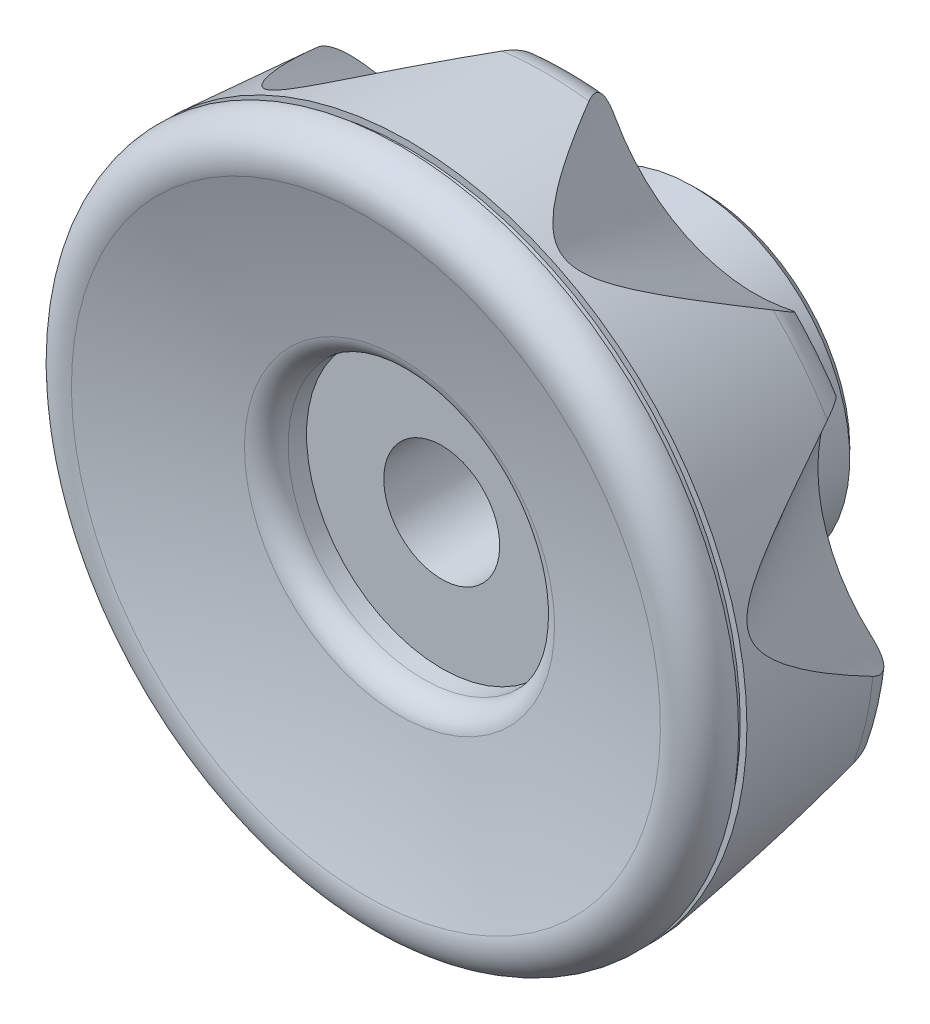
ISO-10303-21;
HEADER;
FILE_DESCRIPTION(('STEP AP214'),'2;1');
FILE_NAME('part.step','',(''),(''),'','','');
FILE_SCHEMA(('AUTOMOTIVE_DESIGN { 1 0 10303 214 1 1 1 1 }'));
ENDSEC;
DATA;
#1=APPLICATION_CONTEXT('core data for automotive mechanical design processes');
#2=APPLICATION_PROTOCOL_DEFINITION('international standard','automotive_design',2000,#1);
#3=PRODUCT_CONTEXT('',#1,'mechanical');
#4=PRODUCT('Part','Part','',(#3));
#5=PRODUCT_RELATED_PRODUCT_CATEGORY('part','',(#4));
#6=PRODUCT_DEFINITION_FORMATION('','',#4);
#7=PRODUCT_DEFINITION_CONTEXT('part definition',#1,'design');
#8=PRODUCT_DEFINITION('design','',#6,#7);
#9=PRODUCT_DEFINITION_SHAPE('','',#8);
#10=(LENGTH_UNIT() NAMED_UNIT(*) SI_UNIT(.MILLI.,.METRE.));
#11=(NAMED_UNIT(*) PLANE_ANGLE_UNIT() SI_UNIT($,.RADIAN.));
#12=(NAMED_UNIT(*) SI_UNIT($,.STERADIAN.) SOLID_ANGLE_UNIT());
#13=UNCERTAINTY_MEASURE_WITH_UNIT(LENGTH_MEASURE(1.E-05),#10,'distance_accuracy_value','');
#14=(GEOMETRIC_REPRESENTATION_CONTEXT(3) GLOBAL_UNCERTAINTY_ASSIGNED_CONTEXT((#13)) GLOBAL_UNIT_ASSIGNED_CONTEXT((#10,
#11,#12)) REPRESENTATION_CONTEXT('',''));
#15=CARTESIAN_POINT('',(0.,0.,0.));
#16=DIRECTION('',(0.,0.,1.));
#17=DIRECTION('',(1.,0.,0.));
#18=AXIS2_PLACEMENT_3D('',#15,#16,#17);
#19=CARTESIAN_POINT('',(0.,0.,16.5));
#20=DIRECTION('',(0.,0.,1.));
#21=DIRECTION('',(0.,1.,0.));
#22=AXIS2_PLACEMENT_3D('',#19,#20,#21);
#23=TOROIDAL_SURFACE('',#22,30.5569827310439,3.49999999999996);
#24=CARTESIAN_POINT('',(-30.4277694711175,-2.80714065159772,12.9999999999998));
#25=CARTESIAN_POINT('',(-30.4922913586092,-2.86477433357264,12.9999995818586));
#26=CARTESIAN_POINT('',(-30.558064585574,-2.92106397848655,13.002073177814));
#27=CARTESIAN_POINT('',(-30.6919823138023,-3.03053883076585,13.010813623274));
#28=CARTESIAN_POINT('',(-30.7601296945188,-3.08372004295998,13.017486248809));
#29=CARTESIAN_POINT('',(-30.8991260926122,-3.18687819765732,13.0359552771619));
#30=CARTESIAN_POINT('',(-30.9699939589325,-3.23682184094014,13.0477974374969));
#31=CARTESIAN_POINT('',(-31.1134463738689,-3.33240092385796,13.0770311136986));
#32=CARTESIAN_POINT('',(-31.1860302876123,-3.37803792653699,13.0944206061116));
#33=CARTESIAN_POINT('',(-31.3330374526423,-3.46480885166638,13.135273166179));
#34=CARTESIAN_POINT('',(-31.4074708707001,-3.50590306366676,13.1587845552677));
#35=CARTESIAN_POINT('',(-31.556930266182,-3.58258562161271,13.2120638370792));
#36=CARTESIAN_POINT('',(-31.6319561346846,-3.61817495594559,13.2418306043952));
#37=CARTESIAN_POINT('',(-31.7815087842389,-3.68321920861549,13.3075877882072));
#38=CARTESIAN_POINT('',(-31.8560363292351,-3.71269963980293,13.34355112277));
#39=CARTESIAN_POINT('',(-32.0040438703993,-3.76533170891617,13.4217135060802));
#40=CARTESIAN_POINT('',(-32.077524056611,-3.78848450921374,13.4639114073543));
#41=CARTESIAN_POINT('',(-32.2127536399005,-3.82555260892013,13.5481801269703));
#42=CARTESIAN_POINT('',(-32.2747476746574,-3.84029295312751,13.5894992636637));
#43=CARTESIAN_POINT('',(-32.3967559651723,-3.8648324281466,13.6763591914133));
#44=CARTESIAN_POINT('',(-32.4567695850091,-3.87462998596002,13.7219013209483));
#45=CARTESIAN_POINT('',(-32.5743242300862,-3.88932568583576,13.8168914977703));
#46=CARTESIAN_POINT('',(-32.6318634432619,-3.89422029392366,13.8663423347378));
#47=CARTESIAN_POINT('',(-32.7439869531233,-3.89923372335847,13.9687276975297));
#48=CARTESIAN_POINT('',(-32.7985700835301,-3.89935067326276,14.0216635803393));
#49=CARTESIAN_POINT('',(-32.9523859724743,-3.89300950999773,14.1800128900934));
#50=CARTESIAN_POINT('',(-33.0472644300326,-3.88049800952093,14.289516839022));
#51=CARTESIAN_POINT('',(-33.2229626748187,-3.84059009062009,14.5165356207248));
#52=CARTESIAN_POINT('',(-33.3037858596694,-3.81319727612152,14.6340485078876));
#53=CARTESIAN_POINT('',(-33.4587694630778,-3.74182305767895,14.8877018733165));
#54=CARTESIAN_POINT('',(-33.5312118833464,-3.69634528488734,15.0244673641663));
#55=CARTESIAN_POINT('',(-33.6577169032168,-3.59210577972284,15.3014973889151));
#56=CARTESIAN_POINT('',(-33.7117580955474,-3.53332870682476,15.4417657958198));
#57=CARTESIAN_POINT('',(-33.7933589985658,-3.41681811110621,15.6966901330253));
#58=CARTESIAN_POINT('',(-33.8239786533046,-3.36093708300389,15.8112404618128));
#59=CARTESIAN_POINT('',(-33.8735900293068,-3.24311939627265,16.0391889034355));
#60=CARTESIAN_POINT('',(-33.8926252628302,-3.18120642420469,16.1525897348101));
#61=CARTESIAN_POINT('',(-33.906149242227,-3.11665429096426,16.2650726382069));
#62=B_SPLINE_CURVE_WITH_KNOTS('',3,(#24,#25,#26,#27,#28,#29,#30,#31,#32,#33,#34,#35,#36,#37,#38,
#39,#40,#41,#42,#43,#44,#45,#46,#47,#48,#49,#50,#51,#52,#53,#54,#55,#56,#57,#58,#59,#60,#61),
.UNSPECIFIED.,.F.,.F.,(4,2,2,2,2,2,2,2,2,2,2,2,2,2,2,2,2,2,4),(0.,0.259555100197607,
0.519436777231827,0.781666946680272,1.04380157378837,1.30807155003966,1.57229402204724,
1.83538972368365,2.09843706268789,2.32597812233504,2.55359154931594,2.78136891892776,
3.00923550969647,3.44356210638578,3.87778356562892,4.35989598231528,4.84256736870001,
5.23515773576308,5.6262642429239),.UNSPECIFIED.);
#63=CARTESIAN_POINT('',(-30.4277694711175,-2.8071406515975,12.9999999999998));
#64=VERTEX_POINT('',#63);
#65=CARTESIAN_POINT('',(-33.906149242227,-3.11665429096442,16.2650726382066));
#66=VERTEX_POINT('',#65);
#67=EDGE_CURVE('E116',#64,#66,#62,.T.);
#68=ORIENTED_EDGE('',*,*,#67,.F.);
#69=CARTESIAN_POINT('',(0.,0.,12.9999999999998));
#70=DIRECTION('',(0.,0.,1.));
#71=DIRECTION('',(0.,1.,0.));
#72=AXIS2_PLACEMENT_3D('',#69,#70,#71);
#73=CIRCLE('',#72,30.5569827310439);
#74=CARTESIAN_POINT('',(-28.632445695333,-10.6729680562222,12.9999999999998));
#75=VERTEX_POINT('',#74);
#76=EDGE_CURVE('E37',#64,#75,#73,.T.);
#77=ORIENTED_EDGE('',*,*,#76,.T.);
#78=CARTESIAN_POINT('',(-31.9006505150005,-11.9033183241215,16.2650726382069));
#79=CARTESIAN_POINT('',(-31.9127655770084,-11.8542285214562,16.1788472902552));
#80=CARTESIAN_POINT('',(-31.9213061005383,-11.8051794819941,16.092150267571));
#81=CARTESIAN_POINT('',(-31.9308592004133,-11.7073324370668,15.9181115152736));
#82=CARTESIAN_POINT('',(-31.9318654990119,-11.6585346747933,15.8307693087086));
#83=CARTESIAN_POINT('',(-31.9229383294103,-11.512015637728,15.5668553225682));
#84=CARTESIAN_POINT('',(-31.9008235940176,-11.4150672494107,15.389974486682));
#85=CARTESIAN_POINT('',(-31.8413429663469,-11.2738330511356,15.1279647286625));
#86=CARTESIAN_POINT('',(-31.8170085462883,-11.2273082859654,15.0409016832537));
#87=CARTESIAN_POINT('',(-31.7592310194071,-11.1363098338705,14.8687696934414));
#88=CARTESIAN_POINT('',(-31.7257939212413,-11.0918348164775,14.7836994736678));
#89=CARTESIAN_POINT('',(-31.6497513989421,-11.0057346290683,14.616681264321));
#90=CARTESIAN_POINT('',(-31.6071781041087,-10.9641001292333,14.53472348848));
#91=CARTESIAN_POINT('',(-31.5127571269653,-10.8842577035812,14.3745637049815));
#92=CARTESIAN_POINT('',(-31.4609118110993,-10.8460489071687,14.296360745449));
#93=CARTESIAN_POINT('',(-31.3560371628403,-10.7789272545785,14.1553613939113));
#94=CARTESIAN_POINT('',(-31.3041952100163,-10.7494623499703,14.0919431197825));
#95=CARTESIAN_POINT('',(-31.1940469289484,-10.6941766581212,13.9692748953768));
#96=CARTESIAN_POINT('',(-31.1357419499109,-10.6683551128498,13.9100240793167));
#97=CARTESIAN_POINT('',(-31.0131130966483,-10.6208593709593,13.7963342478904));
#98=CARTESIAN_POINT('',(-30.9487918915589,-10.599183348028,13.7418931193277));
#99=CARTESIAN_POINT('',(-30.8147052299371,-10.5604026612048,13.6383551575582));
#100=CARTESIAN_POINT('',(-30.7449405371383,-10.5432973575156,13.5892575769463));
#101=CARTESIAN_POINT('',(-30.6117866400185,-10.5162408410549,13.5039379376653));
#102=CARTESIAN_POINT('',(-30.5490604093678,-10.5055947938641,13.4668960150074));
#103=CARTESIAN_POINT('',(-30.4207373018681,-10.4879457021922,13.3971240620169));
#104=CARTESIAN_POINT('',(-30.3551395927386,-10.480943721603,13.3643952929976));
#105=CARTESIAN_POINT('',(-30.2216746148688,-10.4706537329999,13.3033769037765));
#106=CARTESIAN_POINT('',(-30.1538085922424,-10.467363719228,13.2750848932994));
#107=CARTESIAN_POINT('',(-30.0163143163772,-10.4644744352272,13.2229137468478));
#108=CARTESIAN_POINT('',(-29.9466854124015,-10.4648765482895,13.1990362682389));
#109=CARTESIAN_POINT('',(-29.735784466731,-10.4715361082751,13.1338837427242));
#110=CARTESIAN_POINT('',(-29.5926042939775,-10.4832546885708,13.0991362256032));
#111=CARTESIAN_POINT('',(-29.3050619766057,-10.5200545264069,13.0457059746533));
#112=CARTESIAN_POINT('',(-29.1606993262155,-10.5451418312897,13.0270305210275));
#113=CARTESIAN_POINT('',(-28.952520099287,-10.5899735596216,13.0100924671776));
#114=CARTESIAN_POINT('',(-28.8880614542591,-10.6050709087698,13.0062521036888));
#115=CARTESIAN_POINT('',(-28.7597887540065,-10.637430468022,13.0012106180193));
#116=CARTESIAN_POINT('',(-28.6959733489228,-10.6546860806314,13.0000016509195));
#117=CARTESIAN_POINT('',(-28.632445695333,-10.6729680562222,12.9999999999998));
#118=B_SPLINE_CURVE_WITH_KNOTS('',3,(#78,#79,#80,#81,#82,#83,#84,#85,#86,#87,#88,#89,#90,#91,
#92,#93,#94,#95,#96,#97,#98,#99,#100,#101,#102,#103,#104,#105,#106,#107,#108,#109,#110,#111,
#112,#113,#114,#115,#116,#117),.UNSPECIFIED.,.F.,.F.,(4,2,2,2,2,2,2,2,2,2,2,2,2,2,2,2,2,2,2,4),
(0.,0.299698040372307,0.599645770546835,1.20498031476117,1.50964069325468,1.81410045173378,
2.11750656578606,2.4208353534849,2.68159295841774,2.94229623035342,3.20288438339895,
3.46343604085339,3.68403118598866,3.90469069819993,4.12523092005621,4.34585377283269,
4.78744512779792,5.22923640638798,5.42810702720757,5.62638394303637),.UNSPECIFIED.);
#119=CARTESIAN_POINT('',(-31.9006505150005,-11.9033183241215,16.2650726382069));
#120=VERTEX_POINT('',#119);
#121=EDGE_CURVE('E363',#120,#75,#118,.T.);
#122=ORIENTED_EDGE('',*,*,#121,.F.);
#123=CARTESIAN_POINT('',(0.,0.,16.2650726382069));
#124=DIRECTION('',(0.,0.,1.));
#125=DIRECTION('',(0.,1.,0.));
#126=AXIS2_PLACEMENT_3D('',#123,#124,#125);
#127=CIRCLE('',#126,34.0490894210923);
#128=EDGE_CURVE('E123',#66,#120,#127,.T.);
#129=ORIENTED_EDGE('',*,*,#128,.F.);
#130=EDGE_LOOP('',(#68,#77,#122,#129));
#131=FACE_BOUND('',#130,.T.);
#132=ADVANCED_FACE('F14',(#131),#23,.T.);
#133=CARTESIAN_POINT('',(-16.7766930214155,-25.5396116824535,12.9999999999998));
#134=CARTESIAN_POINT('',(-16.7718619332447,-25.6259909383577,12.9999995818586));
#135=CARTESIAN_POINT('',(-16.7688618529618,-25.7125105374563,13.002073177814));
#136=CARTESIAN_POINT('',(-16.7667673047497,-25.8854680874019,13.010813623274));
#137=CARTESIAN_POINT('',(-16.7676777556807,-25.9719057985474,13.017486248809));
#138=CARTESIAN_POINT('',(-16.7736882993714,-26.1448956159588,13.0359552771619));
#139=CARTESIAN_POINT('',(-16.7788261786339,-26.2314416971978,13.0477974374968));
#140=CARTESIAN_POINT('',(-16.7935405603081,-26.4031898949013,13.0770311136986));
#141=CARTESIAN_POINT('',(-16.803115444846,-26.4883924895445,13.0944206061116));
#142=CARTESIAN_POINT('',(-16.8269326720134,-26.6574281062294,13.135273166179));
#143=CARTESIAN_POINT('',(-16.8412124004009,-26.7412443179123,13.1587845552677));
#144=CARTESIAN_POINT('',(-16.8744459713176,-26.9059071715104,13.2120638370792));
#145=CARTESIAN_POINT('',(-16.893398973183,-26.9867543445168,13.2418306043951));
#146=CARTESIAN_POINT('',(-16.9357898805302,-27.1442337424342,13.3075877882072));
#147=CARTESIAN_POINT('',(-16.9592083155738,-27.220882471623,13.3435511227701));
#148=CARTESIAN_POINT('',(-17.0103400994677,-27.3694149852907,13.4217135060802));
#149=CARTESIAN_POINT('',(-17.0380526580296,-27.4412996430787,13.4639114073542));
#150=CARTESIAN_POINT('',(-17.0933859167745,-27.5701379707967,13.5481801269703));
#151=CARTESIAN_POINT('',(-17.1205141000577,-27.6277973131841,13.5894992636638));
#152=CARTESIAN_POINT('',(-17.1773992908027,-27.738487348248,13.6763591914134));
#153=CARTESIAN_POINT('',(-17.2071571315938,-27.7915165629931,13.7219013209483));
#154=CARTESIAN_POINT('',(-17.2689616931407,-27.8925871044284,13.8168914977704));
#155=CARTESIAN_POINT('',(-17.3010100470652,-27.9406248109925,13.8663423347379));
#156=CARTESIAN_POINT('',(-17.3669982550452,-28.0314123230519,13.9687276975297));
#157=CARTESIAN_POINT('',(-17.4009388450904,-28.0741600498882,14.0216635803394));
#158=CARTESIAN_POINT('',(-17.501799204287,-28.1904645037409,14.1800128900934));
#159=CARTESIAN_POINT('',(-17.5707368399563,-28.2568426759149,14.289516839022));
#160=CARTESIAN_POINT('',(-17.7114841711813,-28.3693269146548,14.5165356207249));
#161=CARTESIAN_POINT('',(-17.7832931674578,-28.4154378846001,14.6340485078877));
#162=CARTESIAN_POINT('',(-17.9357264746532,-28.4921078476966,14.8877018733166));
#163=CARTESIAN_POINT('',(-18.0164495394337,-28.5203906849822,15.0244673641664));
#164=CARTESIAN_POINT('',(-18.1768218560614,-28.5543040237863,15.3014973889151));
#165=CARTESIAN_POINT('',(-18.256469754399,-28.5599082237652,15.4417657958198));
#166=CARTESIAN_POINT('',(-18.3984387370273,-28.5510632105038,15.6966901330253));
#167=CARTESIAN_POINT('',(-18.4612193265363,-28.5401613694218,15.8112404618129));
#168=CARTESIAN_POINT('',(-18.5842650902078,-28.5054909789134,16.0391889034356));
#169=CARTESIAN_POINT('',(-18.6445388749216,-28.4817712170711,16.1525897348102));
#170=CARTESIAN_POINT('',(-18.703439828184,-28.4520970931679,16.2650726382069));
#171=B_SPLINE_CURVE_WITH_KNOTS('',3,(#133,#134,#135,#136,#137,#138,#139,#140,#141,#142,#143,
#144,#145,#146,#147,#148,#149,#150,#151,#152,#153,#154,#155,#156,#157,#158,#159,#160,#161,#162,
#163,#164,#165,#166,#167,#168,#169,#170),.UNSPECIFIED.,.F.,.F.,(4,2,2,2,2,2,2,2,2,2,2,2,2,2,2,2,
2,2,4),(0.,0.259555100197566,0.519436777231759,0.781666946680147,1.04380157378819,
1.30807155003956,1.57229402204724,1.83538972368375,2.09843706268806,2.3259781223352,
2.55359154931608,2.78136891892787,3.00923550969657,3.4435621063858,3.87778356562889,
4.35989598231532,4.84256736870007,5.23515773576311,5.62626424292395),.UNSPECIFIED.);
#172=CARTESIAN_POINT('',(-16.7766930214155,-25.5396116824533,12.9999999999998));
#173=VERTEX_POINT('',#172);
#174=CARTESIAN_POINT('',(-18.7034398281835,-28.4520970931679,16.2650726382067));
#175=VERTEX_POINT('',#174);
#176=EDGE_CURVE('E362',#173,#175,#171,.T.);
#177=ORIENTED_EDGE('',*,*,#176,.F.);
#178=CARTESIAN_POINT('',(-9.50757545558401,-29.040234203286,12.9999999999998));
#179=VERTEX_POINT('',#178);
#180=EDGE_CURVE('E132',#173,#179,#73,.T.);
#181=ORIENTED_EDGE('',*,*,#180,.T.);
#182=CARTESIAN_POINT('',(-10.5833412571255,-32.3625304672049,16.2650726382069));
#183=CARTESIAN_POINT('',(-10.6292748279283,-32.341395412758,16.1788472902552));
#184=CARTESIAN_POINT('',(-10.6729478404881,-32.3174910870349,16.092150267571));
#185=CARTESIAN_POINT('',(-10.755404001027,-32.2639533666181,15.9181115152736));
#186=CARTESIAN_POINT('',(-10.7941830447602,-32.2343152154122,15.8307693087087));
#187=CARTESIAN_POINT('',(-10.9031702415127,-32.1359825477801,15.5668553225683));
#188=CARTESIAN_POINT('',(-10.9651792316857,-32.0582462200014,15.389974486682));
#189=CARTESIAN_POINT('',(-11.0385150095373,-31.9236843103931,15.1279647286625));
#190=CARTESIAN_POINT('',(-11.0597172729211,-31.8756511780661,15.0409016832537));
#191=CARTESIAN_POINT('',(-11.0948390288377,-31.773742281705,14.8687696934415));
#192=CARTESIAN_POINT('',(-11.1087633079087,-31.7198703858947,14.7836994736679));
#193=CARTESIAN_POINT('',(-11.1286674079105,-31.6067353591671,14.616681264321));
#194=CARTESIAN_POINT('',(-11.1346745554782,-31.5474915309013,14.53472348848));
#195=CARTESIAN_POINT('',(-11.1382273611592,-31.4238893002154,14.3745637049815));
#196=CARTESIAN_POINT('',(-11.1357751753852,-31.3595322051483,14.2963607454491));
#197=CARTESIAN_POINT('',(-11.1228647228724,-31.2356882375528,14.1553613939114));
#198=CARTESIAN_POINT('',(-11.1135783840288,-31.1767854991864,14.0919431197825));
#199=CARTESIAN_POINT('',(-11.0881261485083,-31.0561980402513,13.9692748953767));
#200=CARTESIAN_POINT('',(-11.0719616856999,-30.9945139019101,13.9100240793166));
#201=CARTESIAN_POINT('',(-11.0326375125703,-30.86902569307,13.7963342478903));
#202=CARTESIAN_POINT('',(-11.0094808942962,-30.8052225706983,13.7418931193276));
#203=CARTESIAN_POINT('',(-10.9561991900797,-30.67621003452,13.6383551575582));
#204=CARTESIAN_POINT('',(-10.9260750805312,-30.6110008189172,13.5892575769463));
#205=CARTESIAN_POINT('',(-10.8642086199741,-30.4900274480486,13.5039379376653));
#206=CARTESIAN_POINT('',(-10.8334228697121,-30.4343484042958,13.4668960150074));
#207=CARTESIAN_POINT('',(-10.7672133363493,-30.3230173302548,13.3971240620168));
#208=CARTESIAN_POINT('',(-10.731788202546,-30.2673653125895,13.3643952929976));
#209=CARTESIAN_POINT('',(-10.6566191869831,-30.1566024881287,13.3033769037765));
#210=CARTESIAN_POINT('',(-10.6168776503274,-30.1014914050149,13.2750848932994));
#211=CARTESIAN_POINT('',(-10.5334103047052,-29.992192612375,13.2229137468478));
#212=CARTESIAN_POINT('',(-10.4896830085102,-29.9380052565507,13.1990362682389));
#213=CARTESIAN_POINT('',(-10.3529817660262,-29.777268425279,13.1338837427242));
#214=CARTESIAN_POINT('',(-10.2545484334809,-29.6726320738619,13.0991362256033));
#215=CARTESIAN_POINT('',(-10.0464974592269,-29.4707667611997,13.0457059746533));
#216=CARTESIAN_POINT('',(-9.93687477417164,-29.3735411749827,13.0270305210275));
#217=CARTESIAN_POINT('',(-9.77202629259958,-29.2387322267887,13.0100924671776));
#218=CARTESIAN_POINT('',(-9.72003340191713,-29.1977494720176,13.0062521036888));
#219=CARTESIAN_POINT('',(-9.61475695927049,-29.1176376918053,13.0012106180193));
#220=CARTESIAN_POINT('',(-9.56147772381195,-29.0785034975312,13.0000016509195));
#221=CARTESIAN_POINT('',(-9.50757545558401,-29.0402342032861,12.9999999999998));
#222=B_SPLINE_CURVE_WITH_KNOTS('',3,(#182,#183,#184,#185,#186,#187,#188,#189,#190,#191,#192,
#193,#194,#195,#196,#197,#198,#199,#200,#201,#202,#203,#204,#205,#206,#207,#208,#209,#210,#211,
#212,#213,#214,#215,#216,#217,#218,#219,#220,#221),.UNSPECIFIED.,.F.,.F.,(4,2,2,2,2,2,2,2,2,2,2,
2,2,2,2,2,2,2,2,4),(0.,0.299698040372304,0.599645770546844,1.20498031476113,1.50964069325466,
1.81410045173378,2.11750656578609,2.42083535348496,2.68159295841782,2.94229623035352,
3.20288438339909,3.46343604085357,3.6840311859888,3.90469069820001,4.12523092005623,
4.34585377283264,4.78744512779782,5.22923640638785,5.42810702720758,5.62638394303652),.UNSPECIFIED.);
#223=CARTESIAN_POINT('',(-10.5833412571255,-32.3625304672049,16.2650726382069));
#224=VERTEX_POINT('',#223);
#225=EDGE_CURVE('E408',#224,#179,#222,.T.);
#226=ORIENTED_EDGE('',*,*,#225,.F.);
#227=EDGE_CURVE('E691',#175,#224,#127,.T.);
#228=ORIENTED_EDGE('',*,*,#227,.F.);
#229=EDGE_LOOP('',(#177,#181,#226,#228));
#230=FACE_BOUND('',#229,.T.);
#231=ADVANCED_FACE('F201',(#230),#23,.T.);
#232=CARTESIAN_POINT('',(9.50757545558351,-29.0402342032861,12.9999999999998));
#233=CARTESIAN_POINT('',(9.57812161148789,-29.0903136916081,12.9999995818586));
#234=CARTESIAN_POINT('',(9.64763587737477,-29.141912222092,13.002073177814));
#235=CARTESIAN_POINT('',(9.78416546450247,-29.2481119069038,13.010813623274));
#236=CARTESIAN_POINT('',(9.85117753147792,-29.3027167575,13.017486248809));
#237=CARTESIAN_POINT('',(9.98267890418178,-29.4152733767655,13.0359552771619));
#238=CARTESIAN_POINT('',(10.0471399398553,-29.4732509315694,13.0477974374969));
#239=CARTESIAN_POINT('',(10.1722438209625,-29.5918383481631,13.0770311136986));
#240=CARTESIAN_POINT('',(10.2328880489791,-29.6524472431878,13.0944206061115));
#241=CARTESIAN_POINT('',(10.3501956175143,-29.7764602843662,13.1352731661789));
#242=CARTESIAN_POINT('',(10.4068225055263,-29.8398831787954,13.1587845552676));
#243=CARTESIAN_POINT('',(10.5148403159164,-29.9685318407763,13.2120638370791));
#244=CARTESIAN_POINT('',(10.5662321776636,-30.0337572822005,13.2418306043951));
#245=CARTESIAN_POINT('',(10.662924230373,-30.1650866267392,13.3075877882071));
#246=CARTESIAN_POINT('',(10.7082494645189,-30.231185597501,13.3435511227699));
#247=CARTESIAN_POINT('',(10.7924967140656,-30.3637705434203,13.4217135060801));
#248=CARTESIAN_POINT('',(10.8314199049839,-30.4302564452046,13.4639114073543));
#249=CARTESIAN_POINT('',(10.8976500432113,-30.5538471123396,13.5481801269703));
#250=CARTESIAN_POINT('',(10.9258157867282,-30.611006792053,13.5894992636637));
#251=CARTESIAN_POINT('',(10.9768894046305,-30.7244955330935,13.6763591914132));
#252=CARTESIAN_POINT('',(10.9997956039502,-30.7808243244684,13.7219013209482));
#253=CARTESIAN_POINT('',(11.0402812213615,-30.8921615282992,13.8168914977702));
#254=CARTESIAN_POINT('',(11.0578567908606,-30.9471689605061,13.8663423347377));
#255=CARTESIAN_POINT('',(11.0876943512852,-31.0553657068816,13.9687276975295));
#256=CARTESIAN_POINT('',(11.0999542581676,-31.1085543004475,14.0216635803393));
#257=CARTESIAN_POINT('',(11.12799933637,-31.2599247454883,14.1800128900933));
#258=CARTESIAN_POINT('',(11.1369139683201,-31.3552084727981,14.2895168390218));
#259=CARTESIAN_POINT('',(11.1371031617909,-31.5353819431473,14.5165356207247));
#260=CARTESIAN_POINT('',(11.1283819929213,-31.6202741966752,14.6340485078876));
#261=CARTESIAN_POINT('',(11.0932843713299,-31.7872542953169,14.8877018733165));
#262=CARTESIAN_POINT('',(11.0650667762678,-31.868000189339,15.0244673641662));
#263=CARTESIAN_POINT('',(10.9915907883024,-32.0145289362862,15.3014973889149));
#264=CARTESIAN_POINT('',(10.9463126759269,-32.0802943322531,15.4417657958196));
#265=CARTESIAN_POINT('',(10.8508811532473,-32.1857753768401,15.6966901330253));
#266=CARTESIAN_POINT('',(10.8032146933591,-32.2280620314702,15.8112404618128));
#267=CARTESIAN_POINT('',(10.6993905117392,-32.3026464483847,16.0391889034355));
#268=CARTESIAN_POINT('',(10.6432655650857,-32.3349813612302,16.1525897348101));
#269=CARTESIAN_POINT('',(10.5833412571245,-32.362530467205,16.2650726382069));
#270=B_SPLINE_CURVE_WITH_KNOTS('',3,(#232,#233,#234,#235,#236,#237,#238,#239,#240,#241,#242,
#243,#244,#245,#246,#247,#248,#249,#250,#251,#252,#253,#254,#255,#256,#257,#258,#259,#260,#261,
#262,#263,#264,#265,#266,#267,#268,#269),.UNSPECIFIED.,.F.,.F.,(4,2,2,2,2,2,2,2,2,2,2,2,2,2,2,2,
2,2,4),(0.,0.259555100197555,0.51943677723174,0.781666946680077,1.04380157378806,
1.30807155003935,1.57229402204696,1.83538972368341,2.0984370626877,2.32597812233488,
2.55359154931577,2.78136891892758,3.00923550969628,3.44356210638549,3.87778356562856,
4.35989598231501,4.84256736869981,5.23515773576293,5.62626424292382),.UNSPECIFIED.);
#271=CARTESIAN_POINT('',(9.50757545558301,-29.0402342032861,12.9999999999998));
#272=VERTEX_POINT('',#271);
#273=CARTESIAN_POINT('',(10.583341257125,-32.3625304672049,16.2650726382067));
#274=VERTEX_POINT('',#273);
#275=EDGE_CURVE('E413',#272,#274,#270,.T.);
#276=ORIENTED_EDGE('',*,*,#275,.F.);
#277=CARTESIAN_POINT('',(16.7766930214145,-25.5396116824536,12.9999999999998));
#278=VERTEX_POINT('',#277);
#279=EDGE_CURVE('E136',#272,#278,#73,.T.);
#280=ORIENTED_EDGE('',*,*,#279,.T.);
#281=CARTESIAN_POINT('',(18.703439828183,-28.4520970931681,16.2650726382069));
#282=CARTESIAN_POINT('',(18.6582766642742,-28.4748319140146,16.1788472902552));
#283=CARTESIAN_POINT('',(18.6123578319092,-28.4940727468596,16.0921502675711));
#284=CARTESIAN_POINT('',(18.5190897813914,-28.5251593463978,15.9181115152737));
#285=CARTESIAN_POINT('',(18.4717394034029,-28.5369989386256,15.8307693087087));
#286=CARTESIAN_POINT('',(18.3269074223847,-28.5608991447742,15.5668553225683));
#287=CARTESIAN_POINT('',(18.2274687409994,-28.5609119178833,15.3899744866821));
#288=CARTESIAN_POINT('',(18.0765398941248,-28.5343501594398,15.1279647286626));
#289=CARTESIAN_POINT('',(18.0257666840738,-28.5209785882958,15.0409016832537));
#290=CARTESIAN_POINT('',(17.9241930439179,-28.4848987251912,14.8687696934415));
#291=CARTESIAN_POINT('',(17.8733926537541,-28.462196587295,14.7836994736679));
#292=CARTESIAN_POINT('',(17.7725301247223,-28.407219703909,14.6166812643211));
#293=CARTESIAN_POINT('',(17.7224660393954,-28.3749783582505,14.53472348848));
#294=CARTESIAN_POINT('',(17.6236147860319,-28.3006913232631,14.3745637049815));
#295=CARTESIAN_POINT('',(17.5748272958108,-28.2586481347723,14.2963607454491));
#296=CARTESIAN_POINT('',(17.4860517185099,-28.1713388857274,14.1553613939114));
#297=CARTESIAN_POINT('',(17.4457896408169,-28.1273532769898,14.0919431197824));
#298=CARTESIAN_POINT('',(17.3673797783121,-28.0322688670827,13.9692748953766));
#299=CARTESIAN_POINT('',(17.3292315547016,-27.9811715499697,13.9100240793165));
#300=CARTESIAN_POINT('',(17.2556391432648,-27.8721860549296,13.7963342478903));
#301=CARTESIAN_POINT('',(17.2201937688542,-27.8143008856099,13.7418931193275));
#302=CARTESIAN_POINT('',(17.1525483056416,-27.6922055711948,13.6383551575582));
#303=CARTESIAN_POINT('',(17.12034776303,-27.6279963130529,13.5892575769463));
#304=CARTESIAN_POINT('',(17.064340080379,-27.5042015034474,13.5039379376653));
#305=CARTESIAN_POINT('',(17.0400030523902,-27.4454169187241,13.4668960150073));
#306=CARTESIAN_POINT('',(16.9942418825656,-27.3242384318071,13.3971240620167));
#307=CARTESIAN_POINT('',(16.9728185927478,-27.2618434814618,13.3643952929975));
#308=CARTESIAN_POINT('',(16.9330878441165,-27.1340144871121,13.3033769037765));
#309=CARTESIAN_POINT('',(16.9147787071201,-27.0685821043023,13.2750848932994));
#310=CARTESIAN_POINT('',(16.8813665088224,-26.9351780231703,13.2229137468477));
#311=CARTESIAN_POINT('',(16.8662646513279,-26.8672053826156,13.1990362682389));
#312=CARTESIAN_POINT('',(16.825827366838,-26.660110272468,13.1338837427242));
#313=CARTESIAN_POINT('',(16.805391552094,-26.5179122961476,13.0991362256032));
#314=CARTESIAN_POINT('',(16.7772845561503,-26.2293905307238,13.0457059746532));
#315=CARTESIAN_POINT('',(16.7696191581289,-26.0830649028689,13.0270305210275));
#316=CARTESIAN_POINT('',(16.7670026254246,-25.8701291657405,13.0100924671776));
#317=CARTESIAN_POINT('',(16.7673780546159,-25.8039271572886,13.0062521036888));
#318=CARTESIAN_POINT('',(16.7703829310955,-25.6716698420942,13.0012106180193));
#319=CARTESIAN_POINT('',(16.7730056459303,-25.605614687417,13.0000016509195));
#320=CARTESIAN_POINT('',(16.776693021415,-25.5396116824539,12.9999999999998));
#321=B_SPLINE_CURVE_WITH_KNOTS('',3,(#281,#282,#283,#284,#285,#286,#287,#288,#289,#290,#291,
#292,#293,#294,#295,#296,#297,#298,#299,#300,#301,#302,#303,#304,#305,#306,#307,#308,#309,#310,
#311,#312,#313,#314,#315,#316,#317,#318,#319,#320),.UNSPECIFIED.,.F.,.F.,(4,2,2,2,2,2,2,2,2,2,2,
2,2,2,2,2,2,2,2,4),(0.,0.299698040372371,0.599645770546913,1.20498031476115,1.50964069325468,
1.81410045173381,2.11750656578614,2.42083535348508,2.68159295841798,2.94229623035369,
3.20288438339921,3.46343604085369,3.68403118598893,3.90469069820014,4.12523092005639,
4.34585377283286,4.7874451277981,5.22923640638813,5.4281070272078,5.62638394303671),.UNSPECIFIED.);
#322=CARTESIAN_POINT('',(18.703439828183,-28.4520970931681,16.2650726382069));
#323=VERTEX_POINT('',#322);
#324=EDGE_CURVE('E420',#323,#278,#321,.T.);
#325=ORIENTED_EDGE('',*,*,#324,.F.);
#326=EDGE_CURVE('E694',#274,#323,#127,.T.);
#327=ORIENTED_EDGE('',*,*,#326,.F.);
#328=EDGE_LOOP('',(#276,#280,#325,#327));
#329=FACE_BOUND('',#328,.T.);
#330=ADVANCED_FACE('F208',(#329),#23,.T.);
#331=CARTESIAN_POINT('',(28.6324456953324,-10.6729680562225,12.9999999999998));
#332=CARTESIAN_POINT('',(28.7155842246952,-10.6490369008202,12.9999995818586));
#333=CARTESIAN_POINT('',(28.7992670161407,-10.6268596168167,13.002073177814));
#334=CARTESIAN_POINT('',(28.9674220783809,-10.5863309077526,13.010813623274));
#335=CARTESIAN_POINT('',(29.0518952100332,-10.5679843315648,13.017486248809));
#336=CARTESIAN_POINT('',(29.2218852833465,-10.5353503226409,13.0359552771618));
#337=CARTESIAN_POINT('',(29.3074047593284,-10.5211010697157,13.0477974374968));
#338=CARTESIAN_POINT('',(29.4781211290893,-10.4972289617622,13.0770311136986));
#339=CARTESIAN_POINT('',(29.5633181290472,-10.4876044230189,13.0944206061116));
#340=CARTESIAN_POINT('',(29.7334155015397,-10.4732105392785,13.135273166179));
#341=CARTESIAN_POINT('',(29.8183078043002,-10.4684813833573,13.1587845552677));
#342=CARTESIAN_POINT('',(29.9862373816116,-10.4642407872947,13.2120638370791));
#343=CARTESIAN_POINT('',(30.0692749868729,-10.4647284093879,13.2418306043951));
#344=CARTESIAN_POINT('',(30.2322389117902,-10.4710140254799,13.3075877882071));
#345=CARTESIAN_POINT('',(30.3121769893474,-10.4767893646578,13.34355112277));
#346=CARTESIAN_POINT('',(30.4683633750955,-10.4935875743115,13.4217135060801));
#347=CARTESIAN_POINT('',(30.5446123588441,-10.5046094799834,13.4639114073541));
#348=CARTESIAN_POINT('',(30.68253324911,-10.5298861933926,13.5481801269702));
#349=CARTESIAN_POINT('',(30.7447835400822,-10.5435038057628,13.5894992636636));
#350=CARTESIAN_POINT('',(30.8653564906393,-10.5743319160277,13.6763591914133));
#351=CARTESIAN_POINT('',(30.9236778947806,-10.5915435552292,13.7219013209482));
#352=CARTESIAN_POINT('',(31.0359671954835,-10.6293082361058,13.8168914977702));
#353=CARTESIAN_POINT('',(31.0899319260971,-10.6498636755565,13.8663423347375));
#354=CARTESIAN_POINT('',(31.193126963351,-10.6939952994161,13.9687276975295));
#355=CARTESIAN_POINT('',(31.2423554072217,-10.717572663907,14.0216635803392));
#356=CARTESIAN_POINT('',(31.3781874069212,-10.790024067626,14.1800128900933));
#357=CARTESIAN_POINT('',(31.4582414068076,-10.8424627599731,14.2895168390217));
#358=CARTESIAN_POINT('',(31.5992246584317,-10.9546511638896,14.5165356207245));
#359=CARTESIAN_POINT('',(31.6601585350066,-11.0143991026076,14.6340485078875));
#360=CARTESIAN_POINT('',(31.7688258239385,-11.1459499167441,14.8877018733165));
#361=CARTESIAN_POINT('',(31.8143621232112,-11.2183555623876,15.0244673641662));
#362=CARTESIAN_POINT('',(31.8831113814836,-11.3671605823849,15.3014973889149));
#363=CARTESIAN_POINT('',(31.906298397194,-11.4435644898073,15.4417657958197));
#364=CARTESIAN_POINT('',(31.9292662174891,-11.5839422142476,15.6966901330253));
#365=CARTESIAN_POINT('',(31.932607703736,-11.6475746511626,15.8112404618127));
#366=CARTESIAN_POINT('',(31.9261868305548,-11.7752502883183,16.0391889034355));
#367=CARTESIAN_POINT('',(31.9164739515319,-11.839291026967,16.1525897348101));
#368=CARTESIAN_POINT('',(31.9006505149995,-11.9033183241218,16.2650726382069));
#369=B_SPLINE_CURVE_WITH_KNOTS('',3,(#331,#332,#333,#334,#335,#336,#337,#338,#339,#340,#341,
#342,#343,#344,#345,#346,#347,#348,#349,#350,#351,#352,#353,#354,#355,#356,#357,#358,#359,#360,
#361,#362,#363,#364,#365,#366,#367,#368),.UNSPECIFIED.,.F.,.F.,(4,2,2,2,2,2,2,2,2,2,2,2,2,2,2,2,
2,2,4),(0.,0.259555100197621,0.519436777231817,0.781666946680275,1.04380157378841,
1.30807155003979,1.57229402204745,1.83538972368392,2.09843706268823,2.32597812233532,
2.5535915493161,2.78136891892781,3.00923550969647,3.44356210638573,3.87778356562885,
4.35989598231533,4.8425673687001,5.23515773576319,5.62626424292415),.UNSPECIFIED.);
#370=CARTESIAN_POINT('',(28.6324456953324,-10.6729680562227,12.9999999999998));
#371=VERTEX_POINT('',#370);
#372=CARTESIAN_POINT('',(31.9006505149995,-11.9033183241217,16.2650726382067));
#373=VERTEX_POINT('',#372);
#374=EDGE_CURVE('E430',#371,#373,#369,.T.);
#375=ORIENTED_EDGE('',*,*,#374,.F.);
#376=CARTESIAN_POINT('',(30.4277694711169,-2.80714065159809,12.9999999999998));
#377=VERTEX_POINT('',#376);
#378=EDGE_CURVE('E253',#371,#377,#73,.T.);
#379=ORIENTED_EDGE('',*,*,#378,.T.);
#380=CARTESIAN_POINT('',(33.9061492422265,-3.11665429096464,16.2650726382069));
#381=CARTESIAN_POINT('',(33.8957652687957,-3.16613920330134,16.1788472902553));
#382=CARTESIAN_POINT('',(33.88217843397,-3.21403645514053,16.0921502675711));
#383=CARTESIAN_POINT('',(33.8483312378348,-3.30633853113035,15.9181115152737));
#384=CARTESIAN_POINT('',(33.8280653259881,-3.35074041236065,15.8307693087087));
#385=CARTESIAN_POINT('',(33.7564499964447,-3.47887614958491,15.5668553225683));
#386=CARTESIAN_POINT('',(33.6944609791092,-3.55662840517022,15.3899744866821));
#387=CARTESIAN_POINT('',(33.5795915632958,-3.65806834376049,15.1279647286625));
#388=CARTESIAN_POINT('',(33.5374806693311,-3.6894273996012,15.0409016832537));
#389=CARTESIAN_POINT('',(33.445942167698,-3.74634544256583,14.8687696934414));
#390=CARTESIAN_POINT('',(33.3965193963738,-3.77190823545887,14.7836994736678));
#391=CARTESIAN_POINT('',(33.2906499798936,-3.81648820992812,14.616681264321));
#392=CARTESIAN_POINT('',(33.23422823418,-3.83552773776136,14.53472348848));
#393=CARTESIAN_POINT('',(33.1145155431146,-3.86649555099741,14.3745637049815));
#394=CARTESIAN_POINT('',(33.0512263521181,-3.87842564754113,14.2963607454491));
#395=CARTESIAN_POINT('',(32.9276145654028,-3.89339676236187,14.1553613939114));
#396=CARTESIAN_POINT('',(32.8681222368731,-3.89745034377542,14.0919431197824));
#397=CARTESIAN_POINT('',(32.7448945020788,-3.89946948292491,13.9692748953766));
#398=CARTESIAN_POINT('',(32.6811599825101,-3.89743630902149,13.9100240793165));
#399=CARTESIAN_POINT('',(32.5500675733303,-3.8870218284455,13.7963342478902));
#400=CARTESIAN_POINT('',(32.4827112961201,-3.87864332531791,13.7418931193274));
#401=CARTESIAN_POINT('',(32.3450770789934,-3.85540549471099,13.6383551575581));
#402=CARTESIAN_POINT('',(32.2747995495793,-3.84054707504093,13.5892575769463));
#403=CARTESIAN_POINT('',(32.143092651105,-3.80715084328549,13.5039379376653));
#404=CARTESIAN_POINT('',(32.081959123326,-3.78952670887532,13.4668960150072));
#405=CARTESIAN_POINT('',(31.9586863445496,-3.74975068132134,13.3971240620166));
#406=CARTESIAN_POINT('',(31.896546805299,-3.72759746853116,13.3643952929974));
#407=CARTESIAN_POINT('',(31.7718343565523,-3.67896014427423,13.3033769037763));
#408=CARTESIAN_POINT('',(31.7092616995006,-3.65247838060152,13.2750848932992));
#409=CARTESIAN_POINT('',(31.5841300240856,-3.59542500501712,13.2229137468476));
#410=CARTESIAN_POINT('',(31.5215710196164,-3.56485186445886,13.1990362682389));
#411=CARTESIAN_POINT('',(31.3344453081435,-3.46734531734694,13.1338837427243));
#412=CARTESIAN_POINT('',(31.2105289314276,-3.39466369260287,13.0991362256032));
#413=CARTESIAN_POINT('',(30.9674291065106,-3.23674824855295,13.0457059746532));
#414=CARTESIAN_POINT('',(30.8482478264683,-3.15150876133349,13.0270305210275));
#415=CARTESIAN_POINT('',(30.6801365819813,-3.02079118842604,13.0100924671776));
#416=CARTESIAN_POINT('',(30.628611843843,-2.97922138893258,13.0062521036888));
#417=CARTESIAN_POINT('',(30.5270824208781,-2.89441099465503,13.0012106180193));
#418=CARTESIAN_POINT('',(30.4770736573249,-2.85117575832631,13.0000016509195));
#419=CARTESIAN_POINT('',(30.4277694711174,-2.80714065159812,12.9999999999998));
#420=B_SPLINE_CURVE_WITH_KNOTS('',3,(#380,#381,#382,#383,#384,#385,#386,#387,#388,#389,#390,
#391,#392,#393,#394,#395,#396,#397,#398,#399,#400,#401,#402,#403,#404,#405,#406,#407,#408,#409,
#410,#411,#412,#413,#414,#415,#416,#417,#418,#419),.UNSPECIFIED.,.F.,.F.,(4,2,2,2,2,2,2,2,2,2,2,
2,2,2,2,2,2,2,2,4),(0.,0.299698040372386,0.599645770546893,1.20498031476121,1.50964069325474,
1.81410045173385,2.11750656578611,2.42083535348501,2.68159295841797,2.94229623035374,
3.20288438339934,3.46343604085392,3.6840311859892,3.90469069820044,4.1252309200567,
4.34585377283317,4.78744512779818,5.22923640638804,5.42810702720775,5.62638394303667),.UNSPECIFIED.);
#421=CARTESIAN_POINT('',(33.9061492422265,-3.11665429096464,16.2650726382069));
#422=VERTEX_POINT('',#421);
#423=EDGE_CURVE('E434',#422,#377,#420,.T.);
#424=ORIENTED_EDGE('',*,*,#423,.F.);
#425=EDGE_CURVE('E475',#373,#422,#127,.T.);
#426=ORIENTED_EDGE('',*,*,#425,.F.);
#427=EDGE_LOOP('',(#375,#379,#424,#426));
#428=FACE_BOUND('',#427,.T.);
#429=ADVANCED_FACE('F234',(#428),#23,.T.);
#430=CARTESIAN_POINT('',(26.196500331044,15.7312607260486,12.9999999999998));
#431=CARTESIAN_POINT('',(26.2296262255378,15.8111818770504,12.9999995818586));
#432=CARTESIAN_POINT('',(26.2644626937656,15.8904350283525,13.002073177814));
#433=CARTESIAN_POINT('',(26.3376190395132,16.0471731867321,13.010813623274));
#434=CARTESIAN_POINT('',(26.3759432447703,16.1246558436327,13.017486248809));
#435=CARTESIAN_POINT('',(26.4564160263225,16.2779064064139,13.0359552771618));
#436=CARTESIAN_POINT('',(26.4985960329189,16.3536524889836,13.0477974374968));
#437=CARTESIAN_POINT('',(26.5863719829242,16.5020079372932,13.0770311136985));
#438=CARTESIAN_POINT('',(26.631966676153,16.5746184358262,13.0944206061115));
#439=CARTESIAN_POINT('',(26.7267670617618,16.7165803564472,13.1352731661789));
#440=CARTESIAN_POINT('',(26.7759991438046,16.7859004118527,13.1587845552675));
#441=CARTESIAN_POINT('',(26.8773860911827,16.9198370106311,13.212063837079));
#442=CARTESIAN_POINT('',(26.9295404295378,16.9844543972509,13.2418306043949));
#443=CARTESIAN_POINT('',(27.0360610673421,17.1079457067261,13.307587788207));
#444=CARTESIAN_POINT('',(27.0904169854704,17.1668429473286,13.3435511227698));
#445=CARTESIAN_POINT('',(27.2009309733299,17.2784808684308,13.42171350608));
#446=CARTESIAN_POINT('',(27.2570887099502,17.3312226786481,13.4639114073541));
#447=CARTESIAN_POINT('',(27.3628431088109,17.4232937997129,13.5481801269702));
#448=CARTESIAN_POINT('',(27.412302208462,17.4634725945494,13.5894992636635));
#449=CARTESIAN_POINT('',(27.5115806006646,17.5385193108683,13.6763591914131));
#450=CARTESIAN_POINT('',(27.5614000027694,17.5733855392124,13.7219013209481));
#451=CARTESIAN_POINT('',(27.6609368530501,17.6376309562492,13.8168914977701));
#452=CARTESIAN_POINT('',(27.7106542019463,17.6670061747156,13.8663423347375));
#453=CARTESIAN_POINT('',(27.8094987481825,17.7201716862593,13.9687276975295));
#454=CARTESIAN_POINT('',(27.8586257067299,17.7439597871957,14.0216635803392));
#455=CARTESIAN_POINT('',(27.9999603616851,17.8049848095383,14.1800128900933));
#456=CARTESIAN_POINT('',(28.0908714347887,17.8348785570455,14.2895168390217));
#457=CARTESIAN_POINT('',(28.266485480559,17.8751553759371,14.5165356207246));
#458=CARTESIAN_POINT('',(28.3511899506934,17.8855431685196,14.6340485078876));
#459=CARTESIAN_POINT('',(28.5217934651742,17.8884820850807,14.8877018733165));
#460=CARTESIAN_POINT('',(28.6067938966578,17.8789396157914,15.0244673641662));
#461=CARTESIAN_POINT('',(28.7659988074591,17.8399115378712,15.3014973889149));
#462=CARTESIAN_POINT('',(28.8401906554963,17.8104028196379,15.4417657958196));
#463=CARTESIAN_POINT('',(28.9642625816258,17.7408357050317,15.6966901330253));
#464=CARTESIAN_POINT('',(29.0160958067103,17.703774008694,15.8112404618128));
#465=CARTESIAN_POINT('',(29.1119132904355,17.6191495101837,16.0391889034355));
#466=CARTESIAN_POINT('',(29.1559264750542,17.5716269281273,16.15258973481));
#467=CARTESIAN_POINT('',(29.196119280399,17.5193353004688,16.2650726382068));
#468=B_SPLINE_CURVE_WITH_KNOTS('',3,(#430,#431,#432,#433,#434,#435,#436,#437,#438,#439,#440,
#441,#442,#443,#444,#445,#446,#447,#448,#449,#450,#451,#452,#453,#454,#455,#456,#457,#458,#459,
#460,#461,#462,#463,#464,#465,#466,#467),.UNSPECIFIED.,.F.,.F.,(4,2,2,2,2,2,2,2,2,2,2,2,2,2,2,2,
2,2,4),(0.,0.259555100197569,0.519436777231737,0.781666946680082,1.0438015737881,
1.30807155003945,1.57229402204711,1.83538972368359,2.09843706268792,2.32597812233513,
2.55359154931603,2.78136891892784,3.00923550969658,3.44356210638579,3.87778356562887,
4.35989598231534,4.84256736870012,5.23515773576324,5.62626424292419),.UNSPECIFIED.);
#469=CARTESIAN_POINT('',(26.196500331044,15.7312607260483,12.9999999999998));
#470=VERTEX_POINT('',#469);
#471=CARTESIAN_POINT('',(29.1961192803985,17.5193353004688,16.2650726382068));
#472=VERTEX_POINT('',#471);
#473=EDGE_CURVE('E458',#470,#472,#468,.T.);
#474=ORIENTED_EDGE('',*,*,#473,.F.);
#475=CARTESIAN_POINT('',(21.166114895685,22.0391645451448,12.9999999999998));
#476=VERTEX_POINT('',#475);
#477=EDGE_CURVE('E252',#470,#476,#73,.T.);
#478=ORIENTED_EDGE('',*,*,#477,.T.);
#479=CARTESIAN_POINT('',(23.5768367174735,24.5656927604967,16.2650726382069));
#480=CARTESIAN_POINT('',(23.6090512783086,24.5267209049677,16.1788472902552));
#481=CARTESIAN_POINT('',(23.6380276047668,24.4862348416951,16.092150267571));
#482=CARTESIAN_POINT('',(23.6890888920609,24.4022226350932,15.9181115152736));
#483=CARTESIAN_POINT('',(23.7111680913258,24.3586939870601,15.8307693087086));
#484=CARTESIAN_POINT('',(23.7666972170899,24.2228115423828,15.5668553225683));
#485=CARTESIAN_POINT('',(23.7888368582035,24.1258688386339,15.389974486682));
#486=CARTESIAN_POINT('',(23.7965258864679,23.9728135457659,15.1279647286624));
#487=CARTESIAN_POINT('',(23.7947876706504,23.9203378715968,15.0409016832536));
#488=CARTESIAN_POINT('',(23.782214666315,23.8132823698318,14.8687696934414));
#489=CARTESIAN_POINT('',(23.7713858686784,23.7587039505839,14.7836994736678));
#490=CARTESIAN_POINT('',(23.7402313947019,23.6481367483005,14.616681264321));
#491=CARTESIAN_POINT('',(23.7199387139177,23.5921534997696,14.5347234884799));
#492=CARTESIAN_POINT('',(23.6695106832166,23.4792502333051,14.3745637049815));
#493=CARTESIAN_POINT('',(23.6393778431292,23.4223304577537,14.2963607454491));
#494=CARTESIAN_POINT('',(23.5740120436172,23.3163525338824,14.1553613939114));
#495=CARTESIAN_POINT('',(23.5400884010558,23.2673121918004,14.0919431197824));
#496=CARTESIAN_POINT('',(23.46483579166,23.1697099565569,13.9692748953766));
#497=CARTESIAN_POINT('',(23.4235083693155,23.1211479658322,13.9100240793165));
#498=CARTESIAN_POINT('',(23.333631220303,23.0251491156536,13.7963342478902));
#499=CARTESIAN_POINT('',(23.2850846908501,22.9777117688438,13.7418931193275));
#500=CARTESIAN_POINT('',(23.1811030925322,22.88459355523,13.6383551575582));
#501=CARTESIAN_POINT('',(23.125668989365,22.83891244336,13.5892575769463));
#502=CARTESIAN_POINT('',(23.0174408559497,22.7567620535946,13.5039379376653));
#503=CARTESIAN_POINT('',(22.9655456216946,22.719954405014,13.4668960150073));
#504=CARTESIAN_POINT('',(22.8575881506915,22.6483758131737,13.3971240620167));
#505=CARTESIAN_POINT('',(22.8015247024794,22.6136054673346,13.3643952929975));
#506=CARTESIAN_POINT('',(22.685741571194,22.5464262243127,13.3033769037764));
#507=CARTESIAN_POINT('',(22.6260238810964,22.5140160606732,13.2750848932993));
#508=CARTESIAN_POINT('',(22.5033994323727,22.4517563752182,13.2229137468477));
#509=CARTESIAN_POINT('',(22.4404914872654,22.4219078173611,13.1990362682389));
#510=CARTESIAN_POINT('',(22.2475868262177,22.3364013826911,13.1338837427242));
#511=CARTESIAN_POINT('',(22.11350144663,22.2848359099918,13.0991362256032));
#512=CARTESIAN_POINT('',(21.8384679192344,22.1932314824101,13.0457059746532));
#513=CARTESIAN_POINT('',(21.697516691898,22.153197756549,13.0270305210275));
#514=CARTESIAN_POINT('',(21.4905019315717,22.1032641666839,13.0100924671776));
#515=CARTESIAN_POINT('',(21.4258762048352,22.088898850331,13.0062521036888));
#516=CARTESIAN_POINT('',(21.2962662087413,22.062398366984,13.0012106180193));
#517=CARTESIAN_POINT('',(21.2312835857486,22.0502566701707,13.0000016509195));
#518=CARTESIAN_POINT('',(21.1661148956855,22.0391645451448,12.9999999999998));
#519=B_SPLINE_CURVE_WITH_KNOTS('',3,(#479,#480,#481,#482,#483,#484,#485,#486,#487,#488,#489,
#490,#491,#492,#493,#494,#495,#496,#497,#498,#499,#500,#501,#502,#503,#504,#505,#506,#507,#508,
#509,#510,#511,#512,#513,#514,#515,#516,#517,#518),.UNSPECIFIED.,.F.,.F.,(4,2,2,2,2,2,2,2,2,2,2,
2,2,2,2,2,2,2,2,4),(0.,0.299698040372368,0.599645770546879,1.20498031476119,1.50964069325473,
1.81410045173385,2.11750656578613,2.42083535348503,2.68159295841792,2.94229623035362,
3.20288438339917,3.46343604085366,3.68403118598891,3.90469069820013,4.12523092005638,
4.34585377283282,4.78744512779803,5.22923640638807,5.42810702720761,5.62638394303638),.UNSPECIFIED.);
#520=CARTESIAN_POINT('',(23.5768367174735,24.5656927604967,16.2650726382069));
#521=VERTEX_POINT('',#520);
#522=EDGE_CURVE('E310',#521,#476,#519,.T.);
#523=ORIENTED_EDGE('',*,*,#522,.F.);
#524=EDGE_CURVE('E467',#472,#521,#127,.T.);
#525=ORIENTED_EDGE('',*,*,#524,.F.);
#526=EDGE_LOOP('',(#474,#478,#523,#525));
#527=FACE_BOUND('',#526,.T.);
#528=ADVANCED_FACE('F226',(#527),#23,.T.);
#529=CARTESIAN_POINT('',(4.034055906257,30.2895293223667,12.9999999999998));
#530=CARTESIAN_POINT('',(3.992224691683,30.3652582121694,12.9999995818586));
#531=CARTESIAN_POINT('',(3.95198226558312,30.4419079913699,13.002073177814));
#532=CARTESIAN_POINT('',(3.87505167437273,30.5968285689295,13.010813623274));
#533=CARTESIAN_POINT('',(3.83836804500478,30.6751012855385,13.017486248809));
#534=CARTESIAN_POINT('',(3.76872588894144,30.8335676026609,13.0359552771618));
#535=CARTESIAN_POINT('',(3.73580402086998,30.9137721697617,13.0477974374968));
#536=CARTESIAN_POINT('',(3.67454247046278,31.0748962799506,13.0770311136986));
#537=CARTESIAN_POINT('',(3.64620112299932,31.1558155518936,13.0944206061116));
#538=CARTESIAN_POINT('',(3.59431789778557,31.3184452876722,13.135273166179));
#539=CARTESIAN_POINT('',(3.57081699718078,31.4001568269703,13.1587845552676));
#540=CARTESIAN_POINT('',(3.52931487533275,31.5629324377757,13.2120638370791));
#541=CARTESIAN_POINT('',(3.51131266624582,31.6439966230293,13.2418306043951));
#542=CARTESIAN_POINT('',(3.48117780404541,31.8042733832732,13.3075877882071));
#543=CARTESIAN_POINT('',(3.46902044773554,31.8834923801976,13.34355112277));
#544=CARTESIAN_POINT('',(3.45064275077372,32.0395008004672,13.4217135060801));
#545=CARTESIAN_POINT('',(3.44442131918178,32.1162906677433,13.4639114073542));
#546=CARTESIAN_POINT('',(3.43837400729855,32.2563781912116,13.5481801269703));
#547=CARTESIAN_POINT('',(3.43779820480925,32.3200979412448,13.5894992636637));
#548=CARTESIAN_POINT('',(3.44102338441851,32.4445077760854,13.6763591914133));
#549=CARTESIAN_POINT('',(3.44482575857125,32.5051968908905,13.7219013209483));
#550=CARTESIAN_POINT('',(3.45665687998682,32.6230742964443,13.8168914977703));
#551=CARTESIAN_POINT('',(3.46468866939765,32.6802600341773,13.8663423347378));
#552=CARTESIAN_POINT('',(3.48475076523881,32.7906879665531,13.9687276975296));
#553=CARTESIAN_POINT('',(3.4967826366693,32.8439286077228,14.0216635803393));
#554=CARTESIAN_POINT('',(3.53719206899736,32.9924769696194,14.1800128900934));
#555=CARTESIAN_POINT('',(3.5705023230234,33.0821925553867,14.2895168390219));
#556=CARTESIAN_POINT('',(3.6485062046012,33.2446053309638,14.5165356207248));
#557=CARTESIAN_POINT('',(3.69319707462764,33.3173066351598,14.6340485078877));
#558=CARTESIAN_POINT('',(3.79726888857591,33.452522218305,14.8877018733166));
#559=CARTESIAN_POINT('',(3.8577263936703,33.5130285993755,15.0244673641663));
#560=CARTESIAN_POINT('',(3.98750241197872,33.613166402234,15.3014973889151));
#561=CARTESIAN_POINT('',(4.05683111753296,33.6527735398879,15.4417657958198));
#562=CARTESIAN_POINT('',(4.18857845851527,33.7064024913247,15.6966901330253));
#563=CARTESIAN_POINT('',(4.24987194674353,33.7238197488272,15.8112404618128));
#564=CARTESIAN_POINT('',(4.37577526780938,33.7459703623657,16.0391889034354));
#565=CARTESIAN_POINT('',(4.44037169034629,33.750751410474,16.15258973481));
#566=CARTESIAN_POINT('',(4.50631473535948,33.7495721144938,16.2650726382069));
#567=B_SPLINE_CURVE_WITH_KNOTS('',3,(#529,#530,#531,#532,#533,#534,#535,#536,#537,#538,#539,
#540,#541,#542,#543,#544,#545,#546,#547,#548,#549,#550,#551,#552,#553,#554,#555,#556,#557,#558,
#559,#560,#561,#562,#563,#564,#565,#566),.UNSPECIFIED.,.F.,.F.,(4,2,2,2,2,2,2,2,2,2,2,2,2,2,2,2,
2,2,4),(0.,0.259555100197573,0.519436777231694,0.781666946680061,1.04380157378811,
1.3080715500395,1.57229402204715,1.83538972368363,2.09843706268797,2.32597812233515,
2.55359154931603,2.78136891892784,3.00923550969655,3.44356210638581,3.87778356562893,
4.35989598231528,4.84256736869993,5.23515773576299,5.62626424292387),.UNSPECIFIED.);
#568=CARTESIAN_POINT('',(4.0340559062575,30.2895293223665,12.9999999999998));
#569=VERTEX_POINT('',#568);
#570=CARTESIAN_POINT('',(4.50631473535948,33.7495721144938,16.2650726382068));
#571=VERTEX_POINT('',#570);
#572=EDGE_CURVE('E238',#569,#571,#567,.T.);
#573=ORIENTED_EDGE('',*,*,#572,.F.);
#574=CARTESIAN_POINT('',(-4.0340559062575,30.2895293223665,12.9999999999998));
#575=VERTEX_POINT('',#574);
#576=EDGE_CURVE('E135',#569,#575,#73,.T.);
#577=ORIENTED_EDGE('',*,*,#576,.T.);
#578=CARTESIAN_POINT('',(-4.50631473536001,33.7495721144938,16.2650726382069));
#579=CARTESIAN_POINT('',(-4.45575986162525,33.7504599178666,16.1788472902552));
#580=CARTESIAN_POINT('',(-4.40604013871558,33.7478718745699,16.092150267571));
#581=CARTESIAN_POINT('',(-4.30852055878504,33.7354124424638,15.9181115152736));
#582=CARTESIAN_POINT('',(-4.26072233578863,33.7255349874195,15.8307693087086));
#583=CARTESIAN_POINT('',(-4.11986331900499,33.684228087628,15.5668553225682));
#584=CARTESIAN_POINT('',(-4.03026662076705,33.6410947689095,15.389974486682));
#585=CARTESIAN_POINT('',(-3.90580914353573,33.5516778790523,15.1279647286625));
#586=CARTESIAN_POINT('',(-3.86586576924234,33.5176008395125,15.0409016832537));
#587=CARTESIAN_POINT('',(-3.79000554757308,33.4410228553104,14.8687696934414));
#588=CARTESIAN_POINT('',(-3.7540860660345,33.3985274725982,14.7836994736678));
#589=CARTESIAN_POINT('',(-3.68706564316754,33.30523240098,14.616681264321));
#590=CARTESIAN_POINT('',(-3.6559484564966,33.2544619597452,14.53472348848));
#591=CARTESIAN_POINT('',(-3.599118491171,33.1446417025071,14.3745637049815));
#592=CARTESIAN_POINT('',(-3.57340433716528,33.0855939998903,14.2963607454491));
#593=CARTESIAN_POINT('',(-3.53130236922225,32.9684128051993,14.1553613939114));
#594=CARTESIAN_POINT('',(-3.51411213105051,32.9113140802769,14.0919431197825));
#595=CARTESIAN_POINT('',(-3.48472286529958,32.7916252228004,13.9692748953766));
#596=CARTESIAN_POINT('',(-3.47252279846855,32.7290362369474,13.9100240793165));
#597=CARTESIAN_POINT('',(-3.45350536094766,32.5989131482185,13.7963342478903));
#598=CARTESIAN_POINT('',(-3.44668561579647,32.5313812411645,13.7418931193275));
#599=CARTESIAN_POINT('',(-3.43871433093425,32.3920268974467,13.6383551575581));
#600=CARTESIAN_POINT('',(-3.43756199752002,32.3202050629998,13.5892575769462));
#601=CARTESIAN_POINT('',(-3.44081337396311,32.1843689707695,13.5039379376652));
#602=CARTESIAN_POINT('',(-3.44439214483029,32.1208464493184,13.4668960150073));
#603=CARTESIAN_POINT('',(-3.45574013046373,31.9918133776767,13.3971240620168));
#604=CARTESIAN_POINT('',(-3.46351056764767,31.926302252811,13.3643952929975));
#605=CARTESIAN_POINT('',(-3.48317732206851,31.7938937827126,13.3033769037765));
#606=CARTESIAN_POINT('',(-3.49507140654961,31.7269972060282,13.2750848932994));
#607=CARTESIAN_POINT('',(-3.52284991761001,31.5923072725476,13.2229137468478));
#608=CARTESIAN_POINT('',(-3.53873583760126,31.5245135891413,13.1990362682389));
#609=CARTESIAN_POINT('',(-3.5921583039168,31.3203822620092,13.1338837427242));
#610=CARTESIAN_POINT('',(-3.63544366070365,31.183399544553,13.0991362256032));
#611=CARTESIAN_POINT('',(-3.73530503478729,30.9112552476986,13.0457059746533));
#612=CARTESIAN_POINT('',(-3.79188706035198,30.7760945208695,13.0270305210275));
#613=CARTESIAN_POINT('',(-3.88191899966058,30.5831107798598,13.0100924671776));
#614=CARTESIAN_POINT('',(-3.91098122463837,30.5236277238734,13.0062521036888));
#615=CARTESIAN_POINT('',(-3.97107282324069,30.4057717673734,13.0012106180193));
#616=CARTESIAN_POINT('',(-4.00209606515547,30.347396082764,13.0000016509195));
#617=CARTESIAN_POINT('',(-4.0340559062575,30.2895293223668,12.9999999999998));
#618=B_SPLINE_CURVE_WITH_KNOTS('',3,(#578,#579,#580,#581,#582,#583,#584,#585,#586,#587,#588,
#589,#590,#591,#592,#593,#594,#595,#596,#597,#598,#599,#600,#601,#602,#603,#604,#605,#606,#607,
#608,#609,#610,#611,#612,#613,#614,#615,#616,#617),.UNSPECIFIED.,.F.,.F.,(4,2,2,2,2,2,2,2,2,2,2,
2,2,2,2,2,2,2,2,4),(0.,0.299698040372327,0.599645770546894,1.20498031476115,1.50964069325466,
1.81410045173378,2.1175065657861,2.42083535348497,2.68159295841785,2.94229623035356,
3.20288438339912,3.46343604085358,3.6840311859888,3.90469069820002,4.12523092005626,
4.34585377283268,4.78744512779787,5.22923640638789,5.42810702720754,5.6263839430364),.UNSPECIFIED.);
#619=CARTESIAN_POINT('',(-4.50631473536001,33.7495721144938,16.2650726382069));
#620=VERTEX_POINT('',#619);
#621=EDGE_CURVE('E294',#620,#575,#618,.T.);
#622=ORIENTED_EDGE('',*,*,#621,.F.);
#623=EDGE_CURVE('E134',#571,#620,#127,.T.);
#624=ORIENTED_EDGE('',*,*,#623,.F.);
#625=EDGE_LOOP('',(#573,#577,#622,#624));
#626=FACE_BOUND('',#625,.T.);
#627=ADVANCED_FACE('F216',(#626),#23,.T.);
#628=CARTESIAN_POINT('',(0.,0.,0.));
#629=DIRECTION('',(0.,0.,1.));
#630=DIRECTION('',(0.,1.,0.));
#631=AXIS2_PLACEMENT_3D('',#628,#629,#630);
#632=CONICAL_SURFACE('',#631,15.25,0.785398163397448);
#633=CARTESIAN_POINT('',(0.,0.,0.999999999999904));
#634=DIRECTION('',(0.,0.,1.));
#635=DIRECTION('',(0.,1.,0.));
#636=AXIS2_PLACEMENT_3D('',#633,#634,#635);
#637=CIRCLE('',#636,16.25);
#638=CARTESIAN_POINT('',(0.,16.25,0.999999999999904));
#639=VERTEX_POINT('',#638);
#640=EDGE_CURVE('E255',#639,#639,#637,.T.);
#641=ORIENTED_EDGE('',*,*,#640,.F.);
#642=EDGE_LOOP('',(#641));
#643=FACE_BOUND('',#642,.T.);
#644=CARTESIAN_POINT('',(0.,0.,0.));
#645=DIRECTION('',(0.,0.,1.));
#646=DIRECTION('',(0.,1.,0.));
#647=AXIS2_PLACEMENT_3D('',#644,#645,#646);
#648=CIRCLE('',#647,15.25);
#649=CARTESIAN_POINT('',(0.,15.25,0.));
#650=VERTEX_POINT('',#649);
#651=EDGE_CURVE('E9',#650,#650,#648,.T.);
#652=ORIENTED_EDGE('',*,*,#651,.T.);
#653=EDGE_LOOP('',(#652));
#654=FACE_BOUND('',#653,.T.);
#655=ADVANCED_FACE('F16',(#643,#654),#632,.T.);
#656=CARTESIAN_POINT('',(6.,0.,0.));
#657=DIRECTION('',(0.,0.,1.));
#658=DIRECTION('',(0.,1.,0.));
#659=AXIS2_PLACEMENT_3D('',#656,#657,#658);
#660=PLANE('',#659);
#661=ORIENTED_EDGE('',*,*,#651,.F.);
#662=EDGE_LOOP('',(#661));
#663=FACE_BOUND('',#662,.T.);
#664=CARTESIAN_POINT('',(0.,0.,0.));
#665=DIRECTION('',(0.,0.,1.));
#666=DIRECTION('',(0.,1.,0.));
#667=AXIS2_PLACEMENT_3D('',#664,#665,#666);
#668=CIRCLE('',#667,6.00000000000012);
#669=CARTESIAN_POINT('',(0.,6.00000000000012,0.));
#670=VERTEX_POINT('',#669);
#671=EDGE_CURVE('E22',#670,#670,#668,.T.);
#672=ORIENTED_EDGE('',*,*,#671,.T.);
#673=EDGE_LOOP('',(#672));
#674=FACE_BOUND('',#673,.T.);
#675=ADVANCED_FACE('F173',(#663,#674),#660,.F.);
#676=CARTESIAN_POINT('',(0.,0.,39.4436305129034));
#677=DIRECTION('',(0.,0.,1.));
#678=DIRECTION('',(0.,1.,0.));
#679=AXIS2_PLACEMENT_3D('',#676,#677,#678);
#680=CYLINDRICAL_SURFACE('',#679,6.00000000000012);
#681=ORIENTED_EDGE('',*,*,#671,.F.);
#682=EDGE_LOOP('',(#681));
#683=FACE_BOUND('',#682,.T.);
#684=CARTESIAN_POINT('',(0.,0.,27.));
#685=DIRECTION('',(0.,0.,1.));
#686=DIRECTION('',(0.,1.,0.));
#687=AXIS2_PLACEMENT_3D('',#684,#685,#686);
#688=CIRCLE('',#687,6.00000000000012);
#689=CARTESIAN_POINT('',(0.,6.00000000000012,27.));
#690=VERTEX_POINT('',#689);
#691=EDGE_CURVE('E168',#690,#690,#688,.T.);
#692=ORIENTED_EDGE('',*,*,#691,.T.);
#693=EDGE_LOOP('',(#692));
#694=FACE_BOUND('',#693,.T.);
#695=ADVANCED_FACE('F175',(#683,#694),#680,.F.);
#696=CARTESIAN_POINT('',(14.,0.,27.));
#697=DIRECTION('',(0.,0.,-1.));
#698=DIRECTION('',(0.,-1.,0.));
#699=AXIS2_PLACEMENT_3D('',#696,#697,#698);
#700=PLANE('',#699);
#701=ORIENTED_EDGE('',*,*,#691,.F.);
#702=EDGE_LOOP('',(#701));
#703=FACE_BOUND('',#702,.T.);
#704=CARTESIAN_POINT('',(0.,0.,27.));
#705=DIRECTION('',(0.,0.,1.));
#706=DIRECTION('',(0.,1.,0.));
#707=AXIS2_PLACEMENT_3D('',#704,#705,#706);
#708=CIRCLE('',#707,14.);
#709=CARTESIAN_POINT('',(0.,14.,27.));
#710=VERTEX_POINT('',#709);
#711=EDGE_CURVE('E165',#710,#710,#708,.T.);
#712=ORIENTED_EDGE('',*,*,#711,.T.);
#713=EDGE_LOOP('',(#712));
#714=FACE_BOUND('',#713,.T.);
#715=ADVANCED_FACE('F178',(#703,#714),#700,.F.);
#716=CARTESIAN_POINT('',(0.,0.,39.4436305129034));
#717=DIRECTION('',(0.,0.,1.));
#718=DIRECTION('',(0.,1.,0.));
#719=AXIS2_PLACEMENT_3D('',#716,#717,#718);
#720=CYLINDRICAL_SURFACE('',#719,14.);
#721=CARTESIAN_POINT('',(0.,0.,28.9072342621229));
#722=DIRECTION('',(0.,0.,1.));
#723=DIRECTION('',(0.,1.,0.));
#724=AXIS2_PLACEMENT_3D('',#721,#722,#723);
#725=CIRCLE('',#724,14.);
#726=CARTESIAN_POINT('',(0.,14.,28.9072342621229));
#727=VERTEX_POINT('',#726);
#728=EDGE_CURVE('E162',#727,#727,#725,.T.);
#729=ORIENTED_EDGE('',*,*,#728,.T.);
#730=EDGE_LOOP('',(#729));
#731=FACE_BOUND('',#730,.T.);
#732=ORIENTED_EDGE('',*,*,#711,.F.);
#733=EDGE_LOOP('',(#732));
#734=FACE_BOUND('',#733,.T.);
#735=ADVANCED_FACE('F184',(#731,#734),#720,.F.);
#736=CARTESIAN_POINT('',(0.,0.,28.9072342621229));
#737=DIRECTION('',(0.,0.,1.));
#738=DIRECTION('',(0.,1.,0.));
#739=AXIS2_PLACEMENT_3D('',#736,#737,#738);
#740=TOROIDAL_SURFACE('',#739,16.5,2.5);
#741=CARTESIAN_POINT('',(0.,0.,31.3672664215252));
#742=DIRECTION('',(0.,0.,1.));
#743=DIRECTION('',(0.,1.,0.));
#744=AXIS2_PLACEMENT_3D('',#741,#742,#743);
#745=CIRCLE('',#744,16.0547564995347);
#746=CARTESIAN_POINT('',(0.,16.0547564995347,31.3672664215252));
#747=VERTEX_POINT('',#746);
#748=EDGE_CURVE('E159',#747,#747,#745,.T.);
#749=ORIENTED_EDGE('',*,*,#748,.T.);
#750=EDGE_LOOP('',(#749));
#751=FACE_BOUND('',#750,.T.);
#752=ORIENTED_EDGE('',*,*,#728,.F.);
#753=EDGE_LOOP('',(#752));
#754=FACE_BOUND('',#753,.T.);
#755=ADVANCED_FACE('F189',(#751,#754),#740,.T.);
#756=CARTESIAN_POINT('',(0.,0.,158.264295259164));
#757=DIRECTION('',(0.,0.,1.));
#758=DIRECTION('',(0.,1.,0.));
#759=AXIS2_PLACEMENT_3D('',#756,#757,#758);
#760=DEGENERATE_TOROIDAL_SURFACE('',#759,6.91245435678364,128.958709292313,.F.);
#761=ORIENTED_EDGE('',*,*,#748,.F.);
#762=EDGE_LOOP('',(#761));
#763=FACE_BOUND('',#762,.T.);
#764=CARTESIAN_POINT('',(0.,0.,34.8495346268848));
#765=DIRECTION('',(0.,0.,1.));
#766=DIRECTION('',(0.,1.,0.));
#767=AXIS2_PLACEMENT_3D('',#764,#765,#766);
#768=CIRCLE('',#767,30.4926998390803);
#769=CARTESIAN_POINT('',(0.,30.4926998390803,34.8495346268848));
#770=VERTEX_POINT('',#769);
#771=EDGE_CURVE('E156',#770,#770,#768,.T.);
#772=ORIENTED_EDGE('',*,*,#771,.T.);
#773=EDGE_LOOP('',(#772));
#774=FACE_BOUND('',#773,.T.);
#775=ADVANCED_FACE('F197',(#763,#774),#760,.T.);
#776=CARTESIAN_POINT('',(0.,0.,31.5));
#777=DIRECTION('',(0.,0.,1.));
#778=DIRECTION('',(0.,1.,0.));
#779=AXIS2_PLACEMENT_3D('',#776,#777,#778);
#780=TOROIDAL_SURFACE('',#779,31.5078933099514,3.50000000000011);
#781=CARTESIAN_POINT('',(0.,0.,31.2650726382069));
#782=DIRECTION('',(0.,0.,1.));
#783=DIRECTION('',(0.,1.,0.));
#784=AXIS2_PLACEMENT_3D('',#781,#782,#783);
#785=CIRCLE('',#784,35.);
#786=CARTESIAN_POINT('',(0.,35.,31.2650726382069));
#787=VERTEX_POINT('',#786);
#788=EDGE_CURVE('E153',#787,#787,#785,.T.);
#789=ORIENTED_EDGE('',*,*,#788,.T.);
#790=EDGE_LOOP('',(#789));
#791=FACE_BOUND('',#790,.T.);
#792=ORIENTED_EDGE('',*,*,#771,.F.);
#793=EDGE_LOOP('',(#792));
#794=FACE_BOUND('',#793,.T.);
#795=ADVANCED_FACE('F557',(#791,#794),#780,.T.);
#796=CARTESIAN_POINT('',(35.,0.,31.2650726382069));
#797=DIRECTION('',(0.,0.,-1.));
#798=DIRECTION('',(0.,-1.,0.));
#799=AXIS2_PLACEMENT_3D('',#796,#797,#798);
#800=PLANE('',#799);
#801=CARTESIAN_POINT('',(0.,0.,31.2650726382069));
#802=DIRECTION('',(0.,0.,1.));
#803=DIRECTION('',(0.,1.,0.));
#804=AXIS2_PLACEMENT_3D('',#801,#802,#803);
#805=CIRCLE('',#804,34.3087135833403);
#806=CARTESIAN_POINT('',(0.,34.3087135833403,31.2650726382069));
#807=VERTEX_POINT('',#806);
#808=EDGE_CURVE('E150',#807,#807,#805,.T.);
#809=ORIENTED_EDGE('',*,*,#808,.T.);
#810=EDGE_LOOP('',(#809));
#811=FACE_BOUND('',#810,.T.);
#812=ORIENTED_EDGE('',*,*,#788,.F.);
#813=EDGE_LOOP('',(#812));
#814=FACE_BOUND('',#813,.T.);
#815=ADVANCED_FACE('F548',(#811,#814),#800,.T.);
#816=CARTESIAN_POINT('',(0.,0.,39.4436305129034));
#817=DIRECTION('',(0.,0.,1.));
#818=DIRECTION('',(0.,1.,0.));
#819=AXIS2_PLACEMENT_3D('',#816,#817,#818);
#820=CYLINDRICAL_SURFACE('',#819,34.3087135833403);
#821=CARTESIAN_POINT('',(0.,0.,30.4));
#822=DIRECTION('',(0.,0.,1.));
#823=DIRECTION('',(0.,1.,0.));
#824=AXIS2_PLACEMENT_3D('',#821,#822,#823);
#825=CIRCLE('',#824,34.3087135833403);
#826=CARTESIAN_POINT('',(0.,34.3087135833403,30.4));
#827=VERTEX_POINT('',#826);
#828=EDGE_CURVE('E147',#827,#827,#825,.T.);
#829=ORIENTED_EDGE('',*,*,#828,.T.);
#830=EDGE_LOOP('',(#829));
#831=FACE_BOUND('',#830,.T.);
#832=ORIENTED_EDGE('',*,*,#808,.F.);
#833=EDGE_LOOP('',(#832));
#834=FACE_BOUND('',#833,.T.);
#835=ADVANCED_FACE('F538',(#831,#834),#820,.T.);
#836=CARTESIAN_POINT('',(35.,0.,30.4));
#837=DIRECTION('',(0.,0.,-1.));
#838=DIRECTION('',(0.,-1.,0.));
#839=AXIS2_PLACEMENT_3D('',#836,#837,#838);
#840=PLANE('',#839);
#841=ORIENTED_EDGE('',*,*,#828,.F.);
#842=EDGE_LOOP('',(#841));
#843=FACE_BOUND('',#842,.T.);
#844=CARTESIAN_POINT('',(0.,0.,30.4));
#845=DIRECTION('',(0.,0.,1.));
#846=DIRECTION('',(0.,1.,0.));
#847=AXIS2_PLACEMENT_3D('',#844,#845,#846);
#848=CIRCLE('',#847,35.);
#849=CARTESIAN_POINT('',(0.,35.,30.4));
#850=VERTEX_POINT('',#849);
#851=EDGE_CURVE('E144',#850,#850,#848,.T.);
#852=ORIENTED_EDGE('',*,*,#851,.T.);
#853=EDGE_LOOP('',(#852));
#854=FACE_BOUND('',#853,.T.);
#855=ADVANCED_FACE('F223',(#843,#854),#840,.F.);
#856=CARTESIAN_POINT('',(0.,0.,30.4));
#857=DIRECTION('',(0.,0.,1.));
#858=DIRECTION('',(0.,1.,0.));
#859=AXIS2_PLACEMENT_3D('',#856,#857,#858);
#860=CONICAL_SURFACE('',#859,35.,0.0671726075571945);
#861=CARTESIAN_POINT('',(-33.906149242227,-3.11665429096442,16.2650726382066));
#862=CARTESIAN_POINT('',(-33.9393467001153,-2.95826828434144,16.5409887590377));
#863=CARTESIAN_POINT('',(-33.9714497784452,-2.79918872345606,16.8166398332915));
#864=CARTESIAN_POINT('',(-34.0334250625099,-2.47949565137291,17.3673394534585));
#865=CARTESIAN_POINT('',(-34.0632970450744,-2.31888198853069,17.6423879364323));
#866=CARTESIAN_POINT('',(-34.1207624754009,-1.99599927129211,18.1917653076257));
#867=CARTESIAN_POINT('',(-34.1483558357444,-1.8337301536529,18.4660941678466));
#868=CARTESIAN_POINT('',(-34.2013320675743,-1.50659289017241,19.0152039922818));
#869=CARTESIAN_POINT('',(-34.2267037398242,-1.34171602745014,19.2899808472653));
#870=CARTESIAN_POINT('',(-34.2750170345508,-1.0099200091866,19.8385022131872));
#871=CARTESIAN_POINT('',(-34.2979587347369,-0.843000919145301,20.1122467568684));
#872=CARTESIAN_POINT('',(-34.3413253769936,-0.50685566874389,20.6585050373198));
#873=CARTESIAN_POINT('',(-34.361750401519,-0.337629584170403,20.9310188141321));
#874=CARTESIAN_POINT('',(-34.3999797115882,0.0035079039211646,21.4746325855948));
#875=CARTESIAN_POINT('',(-34.4177834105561,0.175419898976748,21.745732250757));
#876=CARTESIAN_POINT('',(-34.4506258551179,0.522326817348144,22.2861377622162));
#877=CARTESIAN_POINT('',(-34.4656645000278,0.697321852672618,22.5554435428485));
#878=CARTESIAN_POINT('',(-34.4927969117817,1.05097097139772,23.0918561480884));
#879=CARTESIAN_POINT('',(-34.5048902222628,1.2296256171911,23.3589626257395));
#880=CARTESIAN_POINT('',(-34.5258619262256,1.59084035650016,23.8896676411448));
#881=CARTESIAN_POINT('',(-34.5347483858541,1.7733894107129,24.1532733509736));
#882=CARTESIAN_POINT('',(-34.549022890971,2.14377947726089,24.6767996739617));
#883=CARTESIAN_POINT('',(-34.5544113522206,2.33161985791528,24.9367207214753));
#884=CARTESIAN_POINT('',(-34.5612398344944,2.71389556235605,25.4516580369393));
#885=CARTESIAN_POINT('',(-34.5626808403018,2.90832922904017,25.7066755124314));
#886=CARTESIAN_POINT('',(-34.5613217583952,3.22074444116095,26.1023739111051));
#887=CARTESIAN_POINT('',(-34.5600716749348,3.33586665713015,26.2453176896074));
#888=CARTESIAN_POINT('',(-34.5558874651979,3.56938287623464,26.5285004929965));
#889=CARTESIAN_POINT('',(-34.5529532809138,3.68777699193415,26.6687394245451));
#890=CARTESIAN_POINT('',(-34.5451733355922,3.92877927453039,26.9462743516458));
#891=CARTESIAN_POINT('',(-34.5403216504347,4.05139941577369,27.0835598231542));
#892=CARTESIAN_POINT('',(-34.5284236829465,4.30121697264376,27.3538044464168));
#893=CARTESIAN_POINT('',(-34.5213775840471,4.42841400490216,27.4867639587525));
#894=CARTESIAN_POINT('',(-34.504630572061,4.68967078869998,27.7484650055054));
#895=CARTESIAN_POINT('',(-34.4949022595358,4.82378907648,27.8771467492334));
#896=CARTESIAN_POINT('',(-34.4723085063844,5.09883850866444,28.1269528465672));
#897=CARTESIAN_POINT('',(-34.4594414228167,5.23977318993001,28.2480732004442));
#898=CARTESIAN_POINT('',(-34.4299617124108,5.52910245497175,28.4793900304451));
#899=CARTESIAN_POINT('',(-34.4133645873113,5.67746424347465,28.5896290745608));
#900=CARTESIAN_POINT('',(-34.3755527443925,5.98339134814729,28.795534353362));
#901=CARTESIAN_POINT('',(-34.3543446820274,6.14094316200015,28.8912212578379));
#902=CARTESIAN_POINT('',(-34.3189861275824,6.38042663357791,29.017156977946));
#903=CARTESIAN_POINT('',(-34.3069948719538,6.45852149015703,29.0553432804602));
#904=CARTESIAN_POINT('',(-34.2816618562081,6.61691830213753,29.1263522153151));
#905=CARTESIAN_POINT('',(-34.2683201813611,6.69722011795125,29.1591751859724));
#906=CARTESIAN_POINT('',(-34.2402333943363,6.85974086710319,29.218586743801));
#907=CARTESIAN_POINT('',(-34.2254903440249,6.94195685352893,29.2451842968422));
#908=CARTESIAN_POINT('',(-34.1945535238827,7.10806058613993,29.2913802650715));
#909=CARTESIAN_POINT('',(-34.178360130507,7.19194789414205,29.3109804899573));
#910=CARTESIAN_POINT('',(-34.1443516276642,7.36183929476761,29.3426542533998));
#911=CARTESIAN_POINT('',(-34.1265203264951,7.44785658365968,29.3546406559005));
#912=CARTESIAN_POINT('',(-34.089490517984,7.62035820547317,29.3702307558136));
#913=CARTESIAN_POINT('',(-34.0702920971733,7.70684250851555,29.3738349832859));
#914=CARTESIAN_POINT('',(-34.0306846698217,7.87949619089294,29.3725008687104));
#915=CARTESIAN_POINT('',(-34.0102752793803,7.96566546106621,29.3675598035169));
#916=CARTESIAN_POINT('',(-33.9684616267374,8.13687234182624,29.3493497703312));
#917=CARTESIAN_POINT('',(-33.9470572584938,8.2219098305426,29.3360799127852));
#918=CARTESIAN_POINT('',(-33.9014357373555,8.39808145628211,29.3001466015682));
#919=CARTESIAN_POINT('',(-33.8771430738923,8.48903923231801,29.2767187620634));
#920=CARTESIAN_POINT('',(-33.8279129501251,8.66820315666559,29.2215580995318));
#921=CARTESIAN_POINT('',(-33.8029753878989,8.75640886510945,29.1898239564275));
#922=CARTESIAN_POINT('',(-33.7526395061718,8.92989590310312,29.1191196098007));
#923=CARTESIAN_POINT('',(-33.7272404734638,9.01517198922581,29.0801371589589));
#924=CARTESIAN_POINT('',(-33.6761916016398,9.18255650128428,28.9960693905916));
#925=CARTESIAN_POINT('',(-33.6505417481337,9.26466474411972,28.950983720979));
#926=CARTESIAN_POINT('',(-33.578620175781,9.48997374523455,28.817752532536));
#927=CARTESIAN_POINT('',(-33.5321917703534,9.62975782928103,28.7239071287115));
#928=CARTESIAN_POINT('',(-33.4392524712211,9.90048575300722,28.5242616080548));
#929=CARTESIAN_POINT('',(-33.3927415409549,10.0314212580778,28.4184504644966));
#930=CARTESIAN_POINT('',(-33.299625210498,10.2861237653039,28.1977099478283));
#931=CARTESIAN_POINT('',(-33.2530200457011,10.4098642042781,28.0827500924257));
#932=CARTESIAN_POINT('',(-33.1599210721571,10.650824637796,27.8463236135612));
#933=CARTESIAN_POINT('',(-33.1134272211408,10.7680476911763,27.7248600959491));
#934=CARTESIAN_POINT('',(-33.0207407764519,10.9964610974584,27.4775702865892));
#935=CARTESIAN_POINT('',(-32.9745478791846,11.1076798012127,27.3517701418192));
#936=CARTESIAN_POINT('',(-32.8821676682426,11.3255722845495,27.0962769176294));
#937=CARTESIAN_POINT('',(-32.8359803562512,11.4322454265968,26.9665832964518));
#938=CARTESIAN_POINT('',(-32.7435072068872,11.6418312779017,26.7039359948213));
#939=CARTESIAN_POINT('',(-32.6972213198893,11.7447388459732,26.5709782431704));
#940=CARTESIAN_POINT('',(-32.6045627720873,11.9471823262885,26.3025448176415));
#941=CARTESIAN_POINT('',(-32.5581901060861,12.0467180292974,26.1670689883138));
#942=CARTESIAN_POINT('',(-32.418722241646,12.341265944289,25.7571058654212));
#943=CARTESIAN_POINT('',(-32.3254298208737,12.5318754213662,25.4795205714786));
#944=CARTESIAN_POINT('',(-32.1380171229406,12.904016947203,24.9185263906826));
#945=CARTESIAN_POINT('',(-32.043896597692,13.0855461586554,24.6351157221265));
#946=CARTESIAN_POINT('',(-31.8542113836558,13.4420419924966,24.0627757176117));
#947=CARTESIAN_POINT('',(-31.7586421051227,13.616975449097,23.7738273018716));
#948=CARTESIAN_POINT('',(-31.5664436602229,13.9604607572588,23.1930961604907));
#949=CARTESIAN_POINT('',(-31.4698161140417,14.1290209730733,22.9013178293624));
#950=CARTESIAN_POINT('',(-31.2753127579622,14.4608312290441,22.3154416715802));
#951=CARTESIAN_POINT('',(-31.1774377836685,14.6240845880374,22.0213454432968));
#952=CARTESIAN_POINT('',(-30.9802918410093,14.9460742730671,21.4311813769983));
#953=CARTESIAN_POINT('',(-30.8810209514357,15.1048108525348,21.1351136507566));
#954=CARTESIAN_POINT('',(-30.7171654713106,15.3616251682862,20.6487047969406));
#955=CARTESIAN_POINT('',(-30.6530164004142,15.4608845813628,20.458839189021));
#956=CARTESIAN_POINT('',(-30.5240889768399,15.6579085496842,20.0784855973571));
#957=CARTESIAN_POINT('',(-30.4593104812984,15.7556727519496,19.8879974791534));
#958=CARTESIAN_POINT('',(-30.3291158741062,15.9497924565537,19.5064794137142));
#959=CARTESIAN_POINT('',(-30.2636996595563,16.0461477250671,19.315449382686));
#960=CARTESIAN_POINT('',(-30.132223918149,16.2375213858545,18.9329190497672));
#961=CARTESIAN_POINT('',(-30.0661643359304,16.3325396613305,18.7414187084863));
#962=CARTESIAN_POINT('',(-29.9340782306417,16.5203334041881,18.3599760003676));
#963=CARTESIAN_POINT('',(-29.8680582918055,16.6131218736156,18.1700377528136));
#964=CARTESIAN_POINT('',(-29.7353836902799,16.797497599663,17.7898226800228));
#965=CARTESIAN_POINT('',(-29.6687290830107,16.8890849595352,17.5995458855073));
#966=CARTESIAN_POINT('',(-29.534785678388,17.0711002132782,17.2187081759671));
#967=CARTESIAN_POINT('',(-29.4674969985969,17.1615283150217,17.0281473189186));
#968=CARTESIAN_POINT('',(-29.3322877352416,17.341258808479,16.6467913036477));
#969=CARTESIAN_POINT('',(-29.2643673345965,17.4305615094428,16.4559962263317));
#970=CARTESIAN_POINT('',(-29.196119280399,17.5193353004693,16.2650726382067));
#971=B_SPLINE_CURVE_WITH_KNOTS('',3,(#861,#862,#863,#864,#865,#866,#867,#868,#869,#870,#871,
#872,#873,#874,#875,#876,#877,#878,#879,#880,#881,#882,#883,#884,#885,#886,#887,#888,#889,#890,
#891,#892,#893,#894,#895,#896,#897,#898,#899,#900,#901,#902,#903,#904,#905,#906,#907,#908,#909,
#910,#911,#912,#913,#914,#915,#916,#917,#918,#919,#920,#921,#922,#923,#924,#925,#926,#927,#928,
#929,#930,#931,#932,#933,#934,#935,#936,#937,#938,#939,#940,#941,#942,#943,#944,#945,#946,#947,
#948,#949,#950,#951,#952,#953,#954,#955,#956,#957,#958,#959,#960,#961,#962,#963,#964,#965,#966,
#967,#968,#969,#970),.UNSPECIFIED.,.F.,.F.,(4,2,2,2,2,2,2,2,2,2,2,2,2,2,2,2,2,2,2,2,2,2,2,2,2,2,
2,2,2,2,2,2,2,2,2,2,2,2,2,2,2,2,2,2,2,2,2,2,2,2,2,2,2,2,4),(0.,0.959614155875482,
1.9193241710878,2.87907098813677,3.84340641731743,4.80771099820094,5.77198397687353,
6.73647240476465,7.70099594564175,8.6656688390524,9.62789810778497,10.5900129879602,
11.5518878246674,12.1024685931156,12.6530683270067,13.2053826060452,13.7576507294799,
14.3157839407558,14.874209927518,15.4303567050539,15.9857060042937,16.2488048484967,
16.5118870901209,16.7745880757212,17.0372210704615,17.3028080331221,17.5683782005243,
17.8340330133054,18.0997162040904,18.3903212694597,18.6809725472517,18.9721194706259,
19.2632831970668,19.7863019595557,20.3098066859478,20.8351352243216,21.3602150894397,
21.8825481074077,22.4049541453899,22.9280486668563,23.4511755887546,24.499158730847,
25.5474673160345,26.6004879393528,27.652074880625,28.7029910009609,29.7538480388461,
30.4247728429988,31.0958536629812,31.7670446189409,32.4382938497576,33.1026715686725,
33.7669917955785,34.4311911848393,35.0952038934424),.UNSPECIFIED.);
#972=CARTESIAN_POINT('',(-29.196119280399,17.5193353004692,16.2650726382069));
#973=VERTEX_POINT('',#972);
#974=EDGE_CURVE('E125',#66,#973,#971,.T.);
#975=ORIENTED_EDGE('',*,*,#974,.F.);
#976=ORIENTED_EDGE('',*,*,#128,.T.);
#977=CARTESIAN_POINT('',(-18.7034398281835,-28.4520970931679,16.2650726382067));
#978=CARTESIAN_POINT('',(-18.8479692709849,-28.3792998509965,16.5409887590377));
#979=CARTESIAN_POINT('',(-18.9923586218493,-28.3052145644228,16.8166398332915));
#980=CARTESIAN_POINT('',(-19.2809456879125,-28.1543434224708,17.3673394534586));
#981=CARTESIAN_POINT('',(-19.4251433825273,-28.0775572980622,17.6423879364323));
#982=CARTESIAN_POINT('',(-19.7134123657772,-27.9211714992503,18.1917653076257));
#983=CARTESIAN_POINT('',(-19.857483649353,-27.8415717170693,18.4660941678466));
#984=CARTESIAN_POINT('',(-20.1462800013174,-27.6790234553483,19.0152039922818));
#985=CARTESIAN_POINT('',(-20.2910049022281,-27.5960607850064,19.2899808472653));
#986=CARTESIAN_POINT('',(-20.5805363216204,-27.4269622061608,19.8385022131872));
#987=CARTESIAN_POINT('',(-20.7253428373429,-27.3408263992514,20.1122467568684));
#988=CARTESIAN_POINT('',(-21.0151904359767,-27.1651486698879,20.6585050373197));
#989=CARTESIAN_POINT('',(-21.1602315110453,-27.0756068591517,20.931018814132));
#990=CARTESIAN_POINT('',(-21.4507791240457,-26.8927999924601,21.4746325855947));
#991=CARTESIAN_POINT('',(-21.5962857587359,-26.7995341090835,21.745732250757));
#992=CARTESIAN_POINT('',(-21.887985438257,-26.6089184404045,22.2861377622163));
#993=CARTESIAN_POINT('',(-22.0341785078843,-26.5115685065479,22.5554435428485));
#994=CARTESIAN_POINT('',(-22.3275893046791,-26.3122848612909,23.0918561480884));
#995=CARTESIAN_POINT('',(-22.4748071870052,-26.2103504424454,23.3589626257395));
#996=CARTESIAN_POINT('',(-22.7702918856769,-26.0015330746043,23.8896676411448));
#997=CARTESIAN_POINT('',(-22.9185551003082,-25.894663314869,24.1532733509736));
#998=CARTESIAN_POINT('',(-23.2170377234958,-25.6748891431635,24.6767996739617));
#999=CARTESIAN_POINT('',(-23.367256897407,-25.5619854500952,24.9367207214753));
#1000=CARTESIAN_POINT('',(-23.6703895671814,-25.3289791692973,25.4516580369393));
#1001=CARTESIAN_POINT('',(-23.8233023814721,-25.2088783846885,25.7066755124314));
#1002=CARTESIAN_POINT('',(-24.0667110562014,-25.0130281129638,26.1023739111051));
#1003=CARTESIAN_POINT('',(-24.1559378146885,-24.9402732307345,26.2453176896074));
#1004=CARTESIAN_POINT('',(-24.3358993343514,-24.7914069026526,26.5285004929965));
#1005=CARTESIAN_POINT('',(-24.4266341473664,-24.7152953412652,26.6687394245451));
#1006=CARTESIAN_POINT('',(-24.6102066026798,-24.5589502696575,26.9462743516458));
#1007=CARTESIAN_POINT('',(-24.7030499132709,-24.4787046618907,27.0835598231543));
#1008=CARTESIAN_POINT('',(-24.8909468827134,-24.3136437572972,27.3538044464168));
#1009=CARTESIAN_POINT('',(-24.9860003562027,-24.228828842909,27.4867639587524));
#1010=CARTESIAN_POINT('',(-25.1798175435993,-24.0528445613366,27.7484650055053));
#1011=CARTESIAN_POINT('',(-25.2786099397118,-23.9616172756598,27.8771467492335));
#1012=CARTESIAN_POINT('',(-25.479565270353,-23.772462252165,28.1269528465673));
#1013=CARTESIAN_POINT('',(-25.5817299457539,-23.6745310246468,28.2480732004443));
#1014=CARTESIAN_POINT('',(-25.789556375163,-23.4710890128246,28.4793900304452));
#1015=CARTESIAN_POINT('',(-25.8952021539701,-23.3656107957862,28.589629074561));
#1016=CARTESIAN_POINT('',(-26.1108102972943,-23.1453058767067,28.795534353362));
#1017=CARTESIAN_POINT('',(-26.2207662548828,-23.0304927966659,28.8912212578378));
#1018=CARTESIAN_POINT('',(-26.385956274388,-22.8535328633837,29.0171569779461));
#1019=CARTESIAN_POINT('',(-26.4395368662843,-22.7954663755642,29.0553432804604));
#1020=CARTESIAN_POINT('',(-26.5475816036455,-22.6769014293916,29.1263522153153));
#1021=CARTESIAN_POINT('',(-26.6020456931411,-22.6164031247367,29.1591751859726));
#1022=CARTESIAN_POINT('',(-26.7115977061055,-22.4931139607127,29.2185867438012));
#1023=CARTESIAN_POINT('',(-26.7666846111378,-22.4303265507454,29.2451842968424));
#1024=CARTESIAN_POINT('',(-26.877260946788,-22.3025751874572,29.2913802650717));
#1025=CARTESIAN_POINT('',(-26.9327502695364,-22.2376118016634,29.3109804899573));
#1026=CARTESIAN_POINT('',(-27.0443727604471,-22.1050973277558,29.3426542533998));
#1027=CARTESIAN_POINT('',(-27.1005061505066,-22.0375253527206,29.3546406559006));
#1028=CARTESIAN_POINT('',(-27.2122856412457,-21.901021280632,29.3702307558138));
#1029=CARTESIAN_POINT('',(-27.2679317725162,-21.8320892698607,29.3738349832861));
#1030=CARTESIAN_POINT('',(-27.3782230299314,-21.693475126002,29.3725008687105));
#1031=CARTESIAN_POINT('',(-27.4328678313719,-21.6237927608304,29.3675598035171));
#1032=CARTESIAN_POINT('',(-27.5406523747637,-21.4843557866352,29.3493497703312));
#1033=CARTESIAN_POINT('',(-27.5937919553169,-21.4146011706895,29.336079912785));
#1034=CARTESIAN_POINT('',(-27.7030839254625,-21.2690916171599,29.3001466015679));
#1035=CARTESIAN_POINT('',(-27.7590513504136,-21.1933876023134,29.2767187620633));
#1036=CARTESIAN_POINT('',(-27.8684328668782,-21.0431910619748,29.2215580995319));
#1037=CARTESIAN_POINT('',(-27.9218465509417,-20.9686987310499,29.1898239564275));
#1038=CARTESIAN_POINT('',(-28.0261002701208,-20.8211771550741,29.1191196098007));
#1039=CARTESIAN_POINT('',(-28.0769357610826,-20.7481506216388,29.0801371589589));
#1040=CARTESIAN_POINT('',(-28.1759737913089,-20.6038764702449,28.9960693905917));
#1041=CARTESIAN_POINT('',(-28.2241761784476,-20.5326289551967,28.9509837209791));
#1042=CARTESIAN_POINT('',(-28.3554874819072,-20.3359205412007,28.8177525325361));
#1043=CARTESIAN_POINT('',(-28.4358274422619,-20.2124674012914,28.7239071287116));
#1044=CARTESIAN_POINT('',(-28.5895443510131,-19.9710084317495,28.5242616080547));
#1045=CARTESIAN_POINT('',(-28.6629147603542,-19.8530077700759,28.4184504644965));
#1046=CARTESIAN_POINT('',(-28.8039921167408,-19.6214020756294,28.1977099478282));
#1047=CARTESIAN_POINT('',(-28.8716784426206,-19.5078137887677,28.0827500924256));
#1048=CARTESIAN_POINT('',(-29.0020226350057,-19.2847897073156,27.8463236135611));
#1049=CARTESIAN_POINT('',(-29.0646828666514,-19.1753519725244,27.7248600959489));
#1050=CARTESIAN_POINT('',(-29.1854746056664,-18.9604733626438,27.4775702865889));
#1051=CARTESIAN_POINT('',(-29.2436280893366,-18.8550145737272,27.3517701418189));
#1052=CARTESIAN_POINT('',(-29.3563851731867,-18.6469350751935,27.0962769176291));
#1053=CARTESIAN_POINT('',(-29.4109882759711,-18.5443147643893,26.9665832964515));
#1054=CARTESIAN_POINT('',(-29.5171930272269,-18.3413417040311,26.7039359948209));
#1055=CARTESIAN_POINT('',(-29.5687906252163,-18.2409921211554,26.5709782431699));
#1056=CARTESIAN_POINT('',(-29.6692956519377,-18.0423273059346,26.302544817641));
#1057=CARTESIAN_POINT('',(-29.7182029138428,-17.944012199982,26.1670689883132));
#1058=CARTESIAN_POINT('',(-29.8615329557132,-17.6513242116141,25.7571058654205));
#1059=CARTESIAN_POINT('',(-29.9523905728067,-17.4595421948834,25.4795205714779));
#1060=CARTESIAN_POINT('',(-30.1264926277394,-17.0809906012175,24.9185263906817));
#1061=CARTESIAN_POINT('',(-30.2097346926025,-16.8942225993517,24.6351157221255));
#1062=CARTESIAN_POINT('',(-30.3701875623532,-16.5236492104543,24.0627757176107));
#1063=CARTESIAN_POINT('',(-30.447369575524,-16.3398609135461,23.7738273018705));
#1064=CARTESIAN_POINT('',(-30.596083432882,-15.9754345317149,23.1930961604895));
#1065=CARTESIAN_POINT('',(-30.6676228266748,-15.7947924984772,22.9013178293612));
#1066=CARTESIAN_POINT('',(-30.8057716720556,-15.4358433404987,22.3154416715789));
#1067=CARTESIAN_POINT('',(-30.872384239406,-15.2575347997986,22.0213454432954));
#1068=CARTESIAN_POINT('',(-31.0012074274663,-14.902642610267,21.4311813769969));
#1069=CARTESIAN_POINT('',(-31.0634182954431,-14.7260588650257,21.1351136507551));
#1070=CARTESIAN_POINT('',(-31.1620415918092,-14.4378303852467,20.6487047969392));
#1071=CARTESIAN_POINT('',(-31.1996494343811,-14.3257893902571,20.4588391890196));
#1072=CARTESIAN_POINT('',(-31.2733040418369,-14.1021474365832,20.0784855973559));
#1073=CARTESIAN_POINT('',(-31.3093504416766,-13.9905465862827,19.8879974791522));
#1074=CARTESIAN_POINT('',(-31.3799443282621,-13.7677246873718,19.5064794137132));
#1075=CARTESIAN_POINT('',(-31.4144915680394,-13.6565037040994,19.3154493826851));
#1076=CARTESIAN_POINT('',(-31.4821397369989,-13.4343923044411,18.9329190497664));
#1077=CARTESIAN_POINT('',(-31.5152405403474,-13.3235019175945,18.7414187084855));
#1078=CARTESIAN_POINT('',(-31.5797092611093,-13.1031453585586,18.359976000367));
#1079=CARTESIAN_POINT('',(-31.611091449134,-12.9936762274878,18.170037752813));
#1080=CARTESIAN_POINT('',(-31.6725209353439,-12.7749906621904,17.7898226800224));
#1081=CARTESIAN_POINT('',(-31.7025683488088,-12.6657742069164,17.5995458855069));
#1082=CARTESIAN_POINT('',(-31.761361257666,-12.447568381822,17.2187081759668));
#1083=CARTESIAN_POINT('',(-31.7901069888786,-12.3385789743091,17.0281473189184));
#1084=CARTESIAN_POINT('',(-31.8463243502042,-12.120807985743,16.6467913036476));
#1085=CARTESIAN_POINT('',(-31.8737963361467,-12.0120263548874,16.4559962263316));
#1086=CARTESIAN_POINT('',(-31.9006505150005,-11.9033183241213,16.2650726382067));
#1087=B_SPLINE_CURVE_WITH_KNOTS('',3,(#977,#978,#979,#980,#981,#982,#983,#984,#985,#986,#987,
#988,#989,#990,#991,#992,#993,#994,#995,#996,#997,#998,#999,#1000,#1001,#1002,#1003,#1004,#1005,
#1006,#1007,#1008,#1009,#1010,#1011,#1012,#1013,#1014,#1015,#1016,#1017,#1018,#1019,#1020,#1021,
#1022,#1023,#1024,#1025,#1026,#1027,#1028,#1029,#1030,#1031,#1032,#1033,#1034,#1035,#1036,#1037,
#1038,#1039,#1040,#1041,#1042,#1043,#1044,#1045,#1046,#1047,#1048,#1049,#1050,#1051,#1052,#1053,
#1054,#1055,#1056,#1057,#1058,#1059,#1060,#1061,#1062,#1063,#1064,#1065,#1066,#1067,#1068,#1069,
#1070,#1071,#1072,#1073,#1074,#1075,#1076,#1077,#1078,#1079,#1080,#1081,#1082,#1083,#1084,#1085,
#1086),.UNSPECIFIED.,.F.,.F.,(4,2,2,2,2,2,2,2,2,2,2,2,2,2,2,2,2,2,2,2,2,2,2,2,2,2,2,2,2,2,2,2,2,
2,2,2,2,2,2,2,2,2,2,2,2,2,2,2,2,2,2,2,2,2,4),(0.,0.959614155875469,1.91932417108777,
2.87907098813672,3.84340641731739,4.8077109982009,5.77198397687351,6.73647240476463,
7.70099594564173,8.66566883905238,9.62789810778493,10.5900129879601,11.5518878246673,
12.1024685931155,12.6530683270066,13.2053826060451,13.7576507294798,14.3157839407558,
14.8742099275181,15.430356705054,15.9857060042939,16.2488048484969,16.5118870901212,
16.7745880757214,17.0372210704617,17.3028080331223,17.5683782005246,17.8340330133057,
18.0997162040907,18.3903212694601,18.6809725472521,18.9721194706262,19.2632831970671,
19.786301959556,20.3098066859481,20.835135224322,21.3602150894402,21.8825481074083,
22.4049541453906,22.9280486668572,23.4511755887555,24.4991587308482,25.5474673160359,
26.6004879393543,27.6520748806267,28.7029910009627,29.753848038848,30.4247728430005,
31.0958536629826,31.7670446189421,32.4382938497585,33.1026715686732,33.7669917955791,
34.4311911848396,35.0952038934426),.UNSPECIFIED.);
#1088=EDGE_CURVE('E353',#175,#120,#1087,.T.);
#1089=ORIENTED_EDGE('',*,*,#1088,.F.);
#1090=ORIENTED_EDGE('',*,*,#227,.T.);
#1091=CARTESIAN_POINT('',(10.583341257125,-32.3625304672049,16.2650726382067));
#1092=CARTESIAN_POINT('',(10.4363134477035,-32.4301397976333,16.5409887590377));
#1093=CARTESIAN_POINT('',(10.2883659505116,-32.4968365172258,16.8166398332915));
#1094=CARTESIAN_POINT('',(9.99047904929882,-32.6283963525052,17.3673394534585));
#1095=CARTESIAN_POINT('',(9.84053944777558,-32.6932592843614,17.6423879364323));
#1096=CARTESIAN_POINT('',(9.53853933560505,-32.8211321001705,18.1917653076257));
#1097=CARTESIAN_POINT('',(9.3864787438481,-32.8841419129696,18.4660941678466));
#1098=CARTESIAN_POINT('',(9.07933181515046,-33.0085848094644,19.0152039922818));
#1099=CARTESIAN_POINT('',(8.92423448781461,-33.0700089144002,19.2899808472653));
#1100=CARTESIAN_POINT('',(8.61150800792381,-33.1909424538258,19.8385022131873));
#1101=CARTESIAN_POINT('',(8.45387893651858,-33.2504519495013,20.1122467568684));
#1102=CARTESIAN_POINT('',(8.13581153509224,-33.367530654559,20.6585050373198));
#1103=CARTESIAN_POINT('',(7.97537329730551,-33.4250999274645,20.931018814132));
#1104=CARTESIAN_POINT('',(7.65129566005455,-33.5382809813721,21.4746325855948));
#1105=CARTESIAN_POINT('',(7.48765555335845,-33.5938923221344,21.7457322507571));
#1106=CARTESIAN_POINT('',(7.15675444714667,-33.7031053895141,22.2861377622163));
#1107=CARTESIAN_POINT('',(6.98949331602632,-33.7567070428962,22.5554435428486));
#1108=CARTESIAN_POINT('',(6.65074844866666,-33.8618535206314,23.0918561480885));
#1109=CARTESIAN_POINT('',(6.47926406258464,-33.9133980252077,23.3589626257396));
#1110=CARTESIAN_POINT('',(6.13177237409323,-34.0142217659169,23.8896676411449));
#1111=CARTESIAN_POINT('',(5.95577762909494,-34.0635064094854,24.1532733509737));
#1112=CARTESIAN_POINT('',(5.59785039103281,-34.1598425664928,24.6767996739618));
#1113=CARTESIAN_POINT('',(5.41591860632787,-34.2068943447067,24.9367207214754));
#1114=CARTESIAN_POINT('',(5.0447468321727,-34.2986159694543,25.4516580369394));
#1115=CARTESIAN_POINT('',(4.8555086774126,-34.3432864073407,25.7066755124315));
#1116=CARTESIAN_POINT('',(4.55062394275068,-34.4114803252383,26.1023739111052));
#1117=CARTESIAN_POINT('',(4.43810991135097,-34.4358786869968,26.2453176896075));
#1118=CARTESIAN_POINT('',(4.20951735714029,-34.4837616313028,26.5285004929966));
#1119=CARTESIAN_POINT('',(4.09343871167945,-34.5072461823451,26.6687394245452));
#1120=CARTESIAN_POINT('',(3.85674765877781,-34.5532893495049,26.9462743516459));
#1121=CARTESIAN_POINT('',(3.73612225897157,-34.575844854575,27.0835598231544));
#1122=CARTESIAN_POINT('',(3.48992060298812,-34.6198348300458,27.3538044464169));
#1123=CARTESIAN_POINT('',(3.36434476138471,-34.6412693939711,27.4867639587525));
#1124=CARTESIAN_POINT('',(3.10591166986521,-34.6830773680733,27.7484650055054));
#1125=CARTESIAN_POINT('',(2.97299125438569,-34.7034370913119,27.8771467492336));
#1126=CARTESIAN_POINT('',(2.69981030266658,-34.7426140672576,28.1269528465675));
#1127=CARTESIAN_POINT('',(2.55954595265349,-34.761430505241,28.2480732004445));
#1128=CARTESIAN_POINT('',(2.270910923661,-34.7970717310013,28.4793900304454));
#1129=CARTESIAN_POINT('',(2.12257566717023,-34.8139043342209,28.5896290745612));
#1130=CARTESIAN_POINT('',(1.81590486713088,-34.8451156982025,28.7955343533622));
#1131=CARTESIAN_POINT('',(1.65758396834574,-34.8594979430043,28.8912212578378));
#1132=CARTESIAN_POINT('',(1.41623682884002,-34.8783159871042,29.0171569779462));
#1133=CARTESIAN_POINT('',(1.33743166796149,-34.8840031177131,29.0553432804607));
#1134=CARTESIAN_POINT('',(1.17736906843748,-34.8945518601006,29.1263522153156));
#1135=CARTESIAN_POINT('',(1.09611178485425,-34.8994135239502,29.1591751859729));
#1136=CARTESIAN_POINT('',(0.931415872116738,-34.9081952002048,29.2185867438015));
#1137=CARTESIAN_POINT('',(0.847980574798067,-34.9121165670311,29.2451842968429));
#1138=CARTESIAN_POINT('',(0.679157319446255,-34.9189169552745,29.2913802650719));
#1139=CARTESIAN_POINT('',(0.5937698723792,-34.9217962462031,29.3109804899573));
#1140=CARTESIAN_POINT('',(0.420570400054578,-34.9264448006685,29.3426542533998));
#1141=CARTESIAN_POINT('',(0.332741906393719,-34.928201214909,29.3546406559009));
#1142=CARTESIAN_POINT('',(0.15632535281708,-34.9304850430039,29.3702307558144));
#1143=CARTESIAN_POINT('',(0.0677373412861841,-34.9310125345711,29.3738349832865));
#1144=CARTESIAN_POINT('',(-0.109401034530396,-34.93081720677,29.372500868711));
#1145=CARTESIAN_POINT('',(-0.197951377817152,-34.9300939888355,29.3675598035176));
#1146=CARTESIAN_POINT('',(-0.374170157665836,-34.9274258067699,29.3493497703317));
#1147=CARTESIAN_POINT('',(-0.461838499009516,-34.9254807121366,29.3360799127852));
#1148=CARTESIAN_POINT('',(-0.643744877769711,-34.9202048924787,29.3001466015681));
#1149=CARTESIAN_POINT('',(-0.737827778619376,-34.9167613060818,29.2767187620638));
#1150=CARTESIAN_POINT('',(-0.923454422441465,-34.9086332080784,29.2215580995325));
#1151=CARTESIAN_POINT('',(-1.01499775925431,-34.9039484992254,29.189823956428));
#1152=CARTESIAN_POINT('',(-1.19533590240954,-34.893479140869,29.1191196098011));
#1153=CARTESIAN_POINT('',(-1.28412575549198,-34.8876926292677,29.0801371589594));
#1154=CARTESIAN_POINT('',(-1.45867303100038,-34.8751702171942,28.996069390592));
#1155=CARTESIAN_POINT('',(-1.54443027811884,-34.8684342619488,28.9509837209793));
#1156=CARTESIAN_POINT('',(-1.78009436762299,-34.8484518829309,28.8177525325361));
#1157=CARTESIAN_POINT('',(-1.92670506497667,-34.8342924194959,28.7239071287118));
#1158=CARTESIAN_POINT('',(-2.21132621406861,-34.8039259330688,28.5242616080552));
#1159=CARTESIAN_POINT('',(-2.34932854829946,-34.7877170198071,28.4184504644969));
#1160=CARTESIAN_POINT('',(-2.61836546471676,-34.7536119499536,28.1977099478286));
#1161=CARTESIAN_POINT('',(-2.74937409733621,-34.7357101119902,28.082750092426));
#1162=CARTESIAN_POINT('',(-3.0050096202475,-34.6985640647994,27.8463236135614));
#1163=CARTESIAN_POINT('',(-3.12963950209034,-34.6793204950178,27.7248600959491));
#1164=CARTESIAN_POINT('',(-3.37295078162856,-34.6397846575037,27.4775702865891));
#1165=CARTESIAN_POINT('',(-3.49165988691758,-34.6194984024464,27.3517701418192));
#1166=CARTESIAN_POINT('',(-3.7246458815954,-34.5779199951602,27.0962769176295));
#1167=CARTESIAN_POINT('',(-3.83892214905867,-34.5566277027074,26.9665832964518));
#1168=CARTESIAN_POINT('',(-4.06383045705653,-34.5131102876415,26.7039359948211));
#1169=CARTESIAN_POINT('',(-4.17445749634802,-34.4908839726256,26.5709782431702));
#1170=CARTESIAN_POINT('',(-4.39244376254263,-34.4455964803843,26.3025448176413));
#1171=CARTESIAN_POINT('',(-4.49980278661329,-34.4225352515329,26.1670689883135));
#1172=CARTESIAN_POINT('',(-4.81800028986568,-34.3521072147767,25.7571058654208));
#1173=CARTESIAN_POINT('',(-5.0245903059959,-34.3035684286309,25.4795205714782));
#1174=CARTESIAN_POINT('',(-5.4291047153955,-34.2036638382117,24.9185263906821));
#1175=CARTESIAN_POINT('',(-5.6270263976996,-34.1522971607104,24.6351157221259));
#1176=CARTESIAN_POINT('',(-6.01679306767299,-34.0466955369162,24.0627757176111));
#1177=CARTESIAN_POINT('',(-6.2086067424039,-33.9924487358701,23.7738273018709));
#1178=CARTESIAN_POINT('',(-6.58624833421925,-33.8815017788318,23.1930961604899));
#1179=CARTESIAN_POINT('',(-6.77208404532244,-33.8248050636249,22.9013178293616));
#1180=CARTESIAN_POINT('',(-7.13885619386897,-33.7090130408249,22.3154416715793));
#1181=CARTESIAN_POINT('',(-7.31979568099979,-33.6499192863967,22.0213454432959));
#1182=CARTESIAN_POINT('',(-7.67758151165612,-33.5293656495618,21.4311813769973));
#1183=CARTESIAN_POINT('',(-7.85442808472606,-33.4679059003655,21.1351136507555));
#1184=CARTESIAN_POINT('',(-8.14126480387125,-33.3653051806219,20.6487047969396));
#1185=CARTESIAN_POINT('',(-8.25231008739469,-33.3248517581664,20.45883918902));
#1186=CARTESIAN_POINT('',(-8.4730833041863,-33.2429987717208,20.0784855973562));
#1187=CARTESIAN_POINT('',(-8.58281092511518,-33.2015989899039,19.8879974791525));
#1188=CARTESIAN_POINT('',(-8.80103466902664,-33.1178643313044,19.5064794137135));
#1189=CARTESIAN_POINT('',(-8.90953058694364,-33.0755293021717,19.3154493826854));
#1190=CARTESIAN_POINT('',(-9.12536221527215,-32.989934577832,18.9329190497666));
#1191=CARTESIAN_POINT('',(-9.23269782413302,-32.9466748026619,18.7414187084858));
#1192=CARTESIAN_POINT('',(-9.4451751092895,-32.8596884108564,18.3599760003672));
#1193=CARTESIAN_POINT('',(-9.55032799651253,-32.8159711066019,18.1700377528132));
#1194=CARTESIAN_POINT('',(-9.75960391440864,-32.7276503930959,17.7898226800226));
#1195=CARTESIAN_POINT('',(-9.86372703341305,-32.683047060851,17.599545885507));
#1196=CARTESIAN_POINT('',(-10.0709839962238,-32.5929641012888,17.218708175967));
#1197=CARTESIAN_POINT('',(-10.174118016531,-32.5474846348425,17.0281473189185));
#1198=CARTESIAN_POINT('',(-10.379429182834,-32.4556591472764,16.6467913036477));
#1199=CARTESIAN_POINT('',(-10.481606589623,-32.4093133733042,16.4559962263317));
#1200=CARTESIAN_POINT('',(-10.5833412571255,-32.3625304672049,16.2650726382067));
#1201=B_SPLINE_CURVE_WITH_KNOTS('',3,(#1091,#1092,#1093,#1094,#1095,#1096,#1097,#1098,#1099,
#1100,#1101,#1102,#1103,#1104,#1105,#1106,#1107,#1108,#1109,#1110,#1111,#1112,#1113,#1114,#1115,
#1116,#1117,#1118,#1119,#1120,#1121,#1122,#1123,#1124,#1125,#1126,#1127,#1128,#1129,#1130,#1131,
#1132,#1133,#1134,#1135,#1136,#1137,#1138,#1139,#1140,#1141,#1142,#1143,#1144,#1145,#1146,#1147,
#1148,#1149,#1150,#1151,#1152,#1153,#1154,#1155,#1156,#1157,#1158,#1159,#1160,#1161,#1162,#1163,
#1164,#1165,#1166,#1167,#1168,#1169,#1170,#1171,#1172,#1173,#1174,#1175,#1176,#1177,#1178,#1179,
#1180,#1181,#1182,#1183,#1184,#1185,#1186,#1187,#1188,#1189,#1190,#1191,#1192,#1193,#1194,#1195,
#1196,#1197,#1198,#1199,#1200),.UNSPECIFIED.,.F.,.F.,(4,2,2,2,2,2,2,2,2,2,2,2,2,2,2,2,2,2,2,2,2,
2,2,2,2,2,2,2,2,2,2,2,2,2,2,2,2,2,2,2,2,2,2,2,2,2,2,2,2,2,2,2,2,2,4),(0.,0.959614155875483,
1.91932417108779,2.87907098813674,3.84340641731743,4.80771099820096,5.77198397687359,
6.73647240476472,7.70099594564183,8.66566883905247,9.62789810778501,10.5900129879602,
11.5518878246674,12.1024685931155,12.6530683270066,13.2053826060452,13.7576507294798,
14.3157839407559,14.8742099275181,15.4303567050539,15.9857060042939,16.2488048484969,
16.5118870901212,16.7745880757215,17.0372210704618,17.3028080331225,17.5683782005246,
17.8340330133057,18.0997162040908,18.3903212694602,18.6809725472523,18.9721194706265,
19.2632831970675,19.7863019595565,20.3098066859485,20.8351352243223,21.3602150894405,
21.8825481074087,22.404954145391,22.9280486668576,23.4511755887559,24.4991587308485,
25.5474673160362,26.6004879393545,27.6520748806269,28.7029910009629,29.7538480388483,
30.4247728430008,31.095853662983,31.7670446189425,32.438293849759,33.1026715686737,
33.7669917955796,34.4311911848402,35.0952038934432),.UNSPECIFIED.);
#1202=EDGE_CURVE('E344',#274,#224,#1201,.T.);
#1203=ORIENTED_EDGE('',*,*,#1202,.F.);
#1204=ORIENTED_EDGE('',*,*,#326,.T.);
#1205=CARTESIAN_POINT('',(31.9006505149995,-11.9033183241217,16.2650726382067));
#1206=CARTESIAN_POINT('',(31.8618392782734,-12.0604230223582,16.5409887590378));
#1207=CARTESIAN_POINT('',(31.8217411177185,-12.2176777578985,16.8166398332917));
#1208=CARTESIAN_POINT('',(31.7388692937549,-12.5326013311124,17.3673394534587));
#1209=CARTESIAN_POINT('',(31.6960953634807,-12.6902702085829,17.6423879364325));
#1210=CARTESIAN_POINT('',(31.6077763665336,-13.0061108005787,18.1917653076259));
#1211=CARTESIAN_POINT('',(31.5622311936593,-13.1642825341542,18.4660941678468));
#1212=CARTESIAN_POINT('',(31.4680215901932,-13.4820085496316,19.015203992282));
#1213=CARTESIAN_POINT('',(31.419343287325,-13.6415658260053,19.2899808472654));
#1214=CARTESIAN_POINT('',(31.3189111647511,-13.9614660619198,19.8385022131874));
#1215=CARTESIAN_POINT('',(31.2671574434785,-14.1218089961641,20.1122467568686));
#1216=CARTESIAN_POINT('',(31.160381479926,-14.4434814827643,20.6585050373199));
#1217=CARTESIAN_POINT('',(31.1053593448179,-14.6048110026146,20.9310188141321));
#1218=CARTESIAN_POINT('',(30.9917887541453,-14.9287523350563,21.4746325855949));
#1219=CARTESIAN_POINT('',(30.9332395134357,-15.0913644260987,21.7457322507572));
#1220=CARTESIAN_POINT('',(30.8123122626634,-15.4181665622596,22.2861377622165));
#1221=CARTESIAN_POINT('',(30.7499341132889,-15.5823566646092,22.5554435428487));
#1222=CARTESIAN_POINT('',(30.6209369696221,-15.9127558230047,23.0918561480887));
#1223=CARTESIAN_POINT('',(30.5543173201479,-16.0789651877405,23.3589626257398));
#1224=CARTESIAN_POINT('',(30.4164869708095,-16.4135077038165,23.8896676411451));
#1225=CARTESIAN_POINT('',(30.3452883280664,-16.5818344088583,24.1532733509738));
#1226=CARTESIAN_POINT('',(30.1974429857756,-16.9217378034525,24.676799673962));
#1227=CARTESIAN_POINT('',(30.120796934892,-17.093314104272,24.9367207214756));
#1228=CARTESIAN_POINT('',(29.961085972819,-17.4406953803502,25.4516580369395));
#1229=CARTESIAN_POINT('',(29.8780226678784,-17.6164992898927,25.7066755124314));
#1230=CARTESIAN_POINT('',(29.7412462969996,-17.8973859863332,26.1023739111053));
#1231=CARTESIAN_POINT('',(29.6901703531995,-18.0005651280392,26.2453176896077));
#1232=CARTESIAN_POINT('',(29.5850816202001,-18.2091405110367,26.5285004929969));
#1233=CARTESIAN_POINT('',(29.5310687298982,-18.3145368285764,26.6687394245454));
#1234=CARTESIAN_POINT('',(29.4194922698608,-18.5282967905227,26.9462743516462));
#1235=CARTESIAN_POINT('',(29.3619181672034,-18.6366686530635,27.0835598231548));
#1236=CARTESIAN_POINT('',(29.2428066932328,-18.8565841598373,27.3538044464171));
#1237=CARTESIAN_POINT('',(29.1812696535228,-18.9681275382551,27.4867639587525));
#1238=CARTESIAN_POINT('',(29.0528260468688,-19.1962455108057,27.7484650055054));
#1239=CARTESIAN_POINT('',(28.985869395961,-19.3128609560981,27.8771467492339));
#1240=CARTESIAN_POINT('',(28.8461736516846,-19.5508688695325,28.1269528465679));
#1241=CARTESIAN_POINT('',(28.7734315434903,-19.6722638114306,28.2480732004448));
#1242=CARTESIAN_POINT('',(28.6213359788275,-19.9201497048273,28.4793900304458));
#1243=CARTESIAN_POINT('',(28.5420107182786,-20.0466178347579,28.5896290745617));
#1244=CARTESIAN_POINT('',(28.3752066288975,-20.3058426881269,28.7955343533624));
#1245=CARTESIAN_POINT('',(28.2877396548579,-20.4385901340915,28.8912212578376));
#1246=CARTESIAN_POINT('',(28.1519747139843,-20.639015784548,29.0171569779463));
#1247=CARTESIAN_POINT('',(28.1072868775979,-20.7041740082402,29.055343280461));
#1248=CARTESIAN_POINT('',(28.0157368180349,-20.8358930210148,29.1263522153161));
#1249=CARTESIAN_POINT('',(27.9688747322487,-20.9024537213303,29.1591751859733));
#1250=CARTESIAN_POINT('',(27.8730543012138,-21.0366934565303,29.218586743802));
#1251=CARTESIAN_POINT('',(27.8240990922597,-21.1043707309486,29.2451842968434));
#1252=CARTESIAN_POINT('',(27.7241562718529,-21.2406020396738,29.2913802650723));
#1253=CARTESIAN_POINT('',(27.6731691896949,-21.309155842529,29.3109804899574));
#1254=CARTESIAN_POINT('',(27.5688154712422,-21.4474669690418,29.3426542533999));
#1255=CARTESIAN_POINT('',(27.5154285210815,-21.5172291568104,29.3546406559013));
#1256=CARTESIAN_POINT('',(27.4072201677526,-21.6565811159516,29.3702307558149));
#1257=CARTESIAN_POINT('',(27.3523988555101,-21.7261708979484,29.373834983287));
#1258=CARTESIAN_POINT('',(27.2418021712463,-21.8645414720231,29.3725008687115));
#1259=CARTESIAN_POINT('',(27.1860265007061,-21.9333219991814,29.3675598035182));
#1260=CARTESIAN_POINT('',(27.0740698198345,-22.0694318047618,29.349349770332));
#1261=CARTESIAN_POINT('',(27.0178887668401,-22.1367609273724,29.3360799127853));
#1262=CARTESIAN_POINT('',(26.9003471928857,-22.2756916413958,29.3001466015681));
#1263=CARTESIAN_POINT('',(26.8389951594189,-22.3471015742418,29.2767187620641));
#1264=CARTESIAN_POINT('',(26.716904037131,-22.4871625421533,29.2215580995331));
#1265=CARTESIAN_POINT('',(26.6561650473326,-22.5558131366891,29.1898239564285));
#1266=CARTESIAN_POINT('',(26.5355407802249,-22.6902796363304,29.1191196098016));
#1267=CARTESIAN_POINT('',(26.4756571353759,-22.7560905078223,29.08013715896));
#1268=CARTESIAN_POINT('',(26.3570382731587,-22.8847494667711,28.9960693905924));
#1269=CARTESIAN_POINT('',(26.2983031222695,-22.9475973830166,28.9509837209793));
#1270=CARTESIAN_POINT('',(26.1357461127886,-23.1193881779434,28.8177525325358));
#1271=CARTESIAN_POINT('',(26.0332655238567,-23.22518475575,28.723907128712));
#1272=CARTESIAN_POINT('',(25.8320656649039,-23.4287773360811,28.5242616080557));
#1273=CARTESIAN_POINT('',(25.7333499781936,-23.5265658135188,28.4184504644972));
#1274=CARTESIAN_POINT('',(25.5389437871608,-23.7156431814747,28.1977099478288));
#1275=CARTESIAN_POINT('',(25.4432650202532,-23.806908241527,28.0827500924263));
#1276=CARTESIAN_POINT('',(25.2548369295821,-23.9836119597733,27.8463236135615));
#1277=CARTESIAN_POINT('',(25.162086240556,-24.0690533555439,27.7248600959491));
#1278=CARTESIAN_POINT('',(24.9794737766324,-24.2346315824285,27.477570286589));
#1279=CARTESIAN_POINT('',(24.8895994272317,-24.3147938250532,27.3517701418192));
#1280=CARTESIAN_POINT('',(24.7118277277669,-24.4710258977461,27.0962769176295));
#1281=CARTESIAN_POINT('',(24.6239306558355,-24.5470951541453,26.9665832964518));
#1282=CARTESIAN_POINT('',(24.4496793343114,-24.6958028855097,26.703935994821));
#1283=CARTESIAN_POINT('',(24.3633272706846,-24.7684367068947,26.5709782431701));
#1284=CARTESIAN_POINT('',(24.1920078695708,-24.9106289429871,26.3025448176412));
#1285=CARTESIAN_POINT('',(24.1070406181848,-24.9801871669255,26.1670689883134));
#1286=CARTESIAN_POINT('',(23.8535848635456,-25.1850528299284,25.7571058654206));
#1287=CARTESIAN_POINT('',(23.686828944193,-25.3163079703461,25.4795205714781));
#1288=CARTESIAN_POINT('',(23.3565097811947,-25.5702805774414,24.9185263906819));
#1289=CARTESIAN_POINT('',(23.192947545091,-25.6929953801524,24.6351157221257));
#1290=CARTESIAN_POINT('',(22.8673693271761,-25.9318856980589,24.0627757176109));
#1291=CARTESIAN_POINT('',(22.7053636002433,-26.0480293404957,23.7738273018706));
#1292=CARTESIAN_POINT('',(22.3831660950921,-26.2741071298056,23.1930961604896));
#1293=CARTESIAN_POINT('',(22.2229721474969,-26.3840495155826,22.9013178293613));
#1294=CARTESIAN_POINT('',(21.9037636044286,-26.5986083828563,22.3154416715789));
#1295=CARTESIAN_POINT('',(21.7447483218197,-26.7032282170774,22.0213454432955));
#1296=CARTESIAN_POINT('',(21.4274198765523,-26.9077924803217,21.4311813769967));
#1297=CARTESIAN_POINT('',(21.2691066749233,-27.0077371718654,21.1351136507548));
#1298=CARTESIAN_POINT('',(21.0100504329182,-27.1680246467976,20.6487047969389));
#1299=CARTESIAN_POINT('',(20.9091870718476,-27.2296210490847,20.4588391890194));
#1300=CARTESIAN_POINT('',(20.7075419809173,-27.3511939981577,20.0784855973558));
#1301=CARTESIAN_POINT('',(20.6067602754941,-27.4111701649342,19.8879974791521));
#1302=CARTESIAN_POINT('',(20.4052336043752,-27.5295766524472,19.5064794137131));
#1303=CARTESIAN_POINT('',(20.3044886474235,-27.5880067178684,19.315449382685));
#1304=CARTESIAN_POINT('',(20.1029991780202,-27.7033832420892,18.9329190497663));
#1305=CARTESIAN_POINT('',(20.0022546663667,-27.7603295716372,18.7414187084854));
#1306=CARTESIAN_POINT('',(19.8017685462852,-27.8722158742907,18.3599760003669));
#1307=CARTESIAN_POINT('',(19.7020272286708,-27.9271704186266,18.170037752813));
#1308=CARTESIAN_POINT('',(19.502493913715,-28.0357218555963,17.7898226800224));
#1309=CARTESIAN_POINT('',(19.402701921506,-28.089318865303,17.599545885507));
#1310=CARTESIAN_POINT('',(19.2030496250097,-28.195193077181,17.2187081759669));
#1311=CARTESIAN_POINT('',(19.10318933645,-28.2474705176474,17.0281473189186));
#1312=CARTESIAN_POINT('',(18.9033878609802,-28.3507369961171,16.6467913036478));
#1313=CARTESIAN_POINT('',(18.803446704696,-28.4017263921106,16.4559962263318));
#1314=CARTESIAN_POINT('',(18.703439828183,-28.4520970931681,16.2650726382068));
#1315=B_SPLINE_CURVE_WITH_KNOTS('',3,(#1205,#1206,#1207,#1208,#1209,#1210,#1211,#1212,#1213,
#1214,#1215,#1216,#1217,#1218,#1219,#1220,#1221,#1222,#1223,#1224,#1225,#1226,#1227,#1228,#1229,
#1230,#1231,#1232,#1233,#1234,#1235,#1236,#1237,#1238,#1239,#1240,#1241,#1242,#1243,#1244,#1245,
#1246,#1247,#1248,#1249,#1250,#1251,#1252,#1253,#1254,#1255,#1256,#1257,#1258,#1259,#1260,#1261,
#1262,#1263,#1264,#1265,#1266,#1267,#1268,#1269,#1270,#1271,#1272,#1273,#1274,#1275,#1276,#1277,
#1278,#1279,#1280,#1281,#1282,#1283,#1284,#1285,#1286,#1287,#1288,#1289,#1290,#1291,#1292,#1293,
#1294,#1295,#1296,#1297,#1298,#1299,#1300,#1301,#1302,#1303,#1304,#1305,#1306,#1307,#1308,#1309,
#1310,#1311,#1312,#1313,#1314),.UNSPECIFIED.,.F.,.F.,(4,2,2,2,2,2,2,2,2,2,2,2,2,2,2,2,2,2,2,2,2,
2,2,2,2,2,2,2,2,2,2,2,2,2,2,2,2,2,2,2,2,2,2,2,2,2,2,2,2,2,2,2,2,2,4),(0.,0.959614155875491,
1.91932417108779,2.87907098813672,3.84340641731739,4.80771099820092,5.77198397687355,
6.7364724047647,7.70099594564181,8.66566883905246,9.62789810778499,10.5900129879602,
11.5518878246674,12.1024685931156,12.6530683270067,13.2053826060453,13.75765072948,
14.3157839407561,14.8742099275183,15.430356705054,15.9857060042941,16.2488048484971,
16.5118870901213,16.7745880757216,17.0372210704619,17.3028080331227,17.5683782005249,
17.834033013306,18.0997162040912,18.3903212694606,18.6809725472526,18.9721194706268,
19.2632831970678,19.7863019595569,20.309806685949,20.8351352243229,21.3602150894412,
21.8825481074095,22.4049541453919,22.9280486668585,23.4511755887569,24.4991587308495,
25.5474673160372,26.6004879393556,27.6520748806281,28.7029910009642,29.7538480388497,
30.4247728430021,31.0958536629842,31.7670446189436,32.43829384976,33.1026715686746,
33.7669917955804,34.4311911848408,35.0952038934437),.UNSPECIFIED.);
#1316=EDGE_CURVE('E335',#373,#323,#1315,.T.);
#1317=ORIENTED_EDGE('',*,*,#1316,.F.);
#1318=ORIENTED_EDGE('',*,*,#425,.T.);
#1319=CARTESIAN_POINT('',(29.1961192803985,17.5193353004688,16.2650726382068));
#1320=CARTESIAN_POINT('',(29.2947502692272,17.3910382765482,16.5409887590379));
#1321=CARTESIAN_POINT('',(29.3926961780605,17.261641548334,16.8166398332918));
#1322=CARTESIAN_POINT('',(29.5872436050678,17.0004981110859,17.3673394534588));
#1323=CARTESIAN_POINT('',(29.6838449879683,16.8687511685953,17.6423879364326));
#1324=CARTESIAN_POINT('',(29.8757131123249,16.6027772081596,18.191765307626));
#1325=CARTESIAN_POINT('',(29.9709798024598,16.4685500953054,18.4660941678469));
#1326=CARTESIAN_POINT('',(30.1606492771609,16.1967951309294,19.0152039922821));
#1327=CARTESIAN_POINT('',(30.2550457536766,16.0592545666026,19.2899808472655));
#1328=CARTESIAN_POINT('',(30.4425354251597,15.7812790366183,19.8385022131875));
#1329=CARTESIAN_POINT('',(30.5356286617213,15.6408441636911,20.1122467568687));
#1330=CARTESIAN_POINT('',(30.7205486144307,15.3568038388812,20.65850503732));
#1331=CARTESIAN_POINT('',(30.812375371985,15.2131984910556,20.9310188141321));
#1332=CARTESIAN_POINT('',(30.9948327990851,14.9224313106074,21.4746325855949));
#1333=CARTESIAN_POINT('',(31.0854631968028,14.7752686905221,21.7457322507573));
#1334=CARTESIAN_POINT('',(31.2655704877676,14.476966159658,22.2861377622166));
#1335=CARTESIAN_POINT('',(31.3550473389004,14.3258261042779,22.5554435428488));
#1336=CARTESIAN_POINT('',(31.5329353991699,14.0189715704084,23.0918561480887));
#1337=CARTESIAN_POINT('',(31.6213464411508,13.8632563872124,23.3589626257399));
#1338=CARTESIAN_POINT('',(31.7969664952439,13.5469124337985,23.8896676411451));
#1339=CARTESIAN_POINT('',(31.8841779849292,13.3862971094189,24.1532733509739));
#1340=CARTESIAN_POINT('',(32.0577450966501,13.0587806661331,24.6767996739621));
#1341=CARTESIAN_POINT('',(32.1441008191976,12.8918802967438,24.9367207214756));
#1342=CARTESIAN_POINT('',(32.3161162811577,12.5504245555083,25.4516580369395));
#1343=CARTESIAN_POINT('',(32.4017761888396,12.3758711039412,25.7066755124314));
#1344=CARTESIAN_POINT('',(32.5361035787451,12.093805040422,26.1023739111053));
#1345=CARTESIAN_POINT('',(32.5849269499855,11.9895411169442,26.2453176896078));
#1346=CARTESIAN_POINT('',(32.6824759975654,11.777334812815,26.528500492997));
#1347=CARTESIAN_POINT('',(32.7312016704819,11.6693923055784,26.6687394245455));
#1348=CARTESIAN_POINT('',(32.828759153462,11.4488811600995,26.9462743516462));
#1349=CARTESIAN_POINT('',(32.877590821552,11.3362991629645,27.0835598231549));
#1350=CARTESIAN_POINT('',(32.9752628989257,11.1060589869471,27.3538044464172));
#1351=CARTESIAN_POINT('',(33.0241033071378,10.9884012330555,27.4867639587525));
#1352=CARTESIAN_POINT('',(33.122369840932,10.7457507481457,27.7484650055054));
#1353=CARTESIAN_POINT('',(33.1717966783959,10.6206933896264,27.877146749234));
#1354=CARTESIAN_POINT('',(33.2707798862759,10.3630793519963,28.126952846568));
#1355=CARTESIAN_POINT('',(33.3203363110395,10.2305187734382,28.2480732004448));
#1356=CARTESIAN_POINT('',(33.4193112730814,9.95705134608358,28.4793900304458));
#1357=CARTESIAN_POINT('',(33.4687295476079,9.8161807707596,28.5896290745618));
#1358=CARTESIAN_POINT('',(33.5673990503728,9.52414402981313,28.7955343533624));
#1359=CARTESIAN_POINT('',(33.6166504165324,9.37299291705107,28.8912212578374));
#1360=CARTESIAN_POINT('',(33.6887014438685,9.1418842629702,29.0171569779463));
#1361=CARTESIAN_POINT('',(33.7117817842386,9.06632041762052,29.0553432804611));
#1362=CARTESIAN_POINT('',(33.7576833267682,8.91261823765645,29.1263522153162));
#1363=CARTESIAN_POINT('',(33.7805045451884,8.83448006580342,29.1591751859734));
#1364=CARTESIAN_POINT('',(33.825714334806,8.67586753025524,29.2185867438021));
#1365=CARTESIAN_POINT('',(33.8481034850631,8.59539671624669,29.2451842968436));
#1366=CARTESIAN_POINT('',(33.8923000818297,8.43231944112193,29.2913802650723));
#1367=CARTESIAN_POINT('',(33.9141076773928,8.34971353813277,29.3109804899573));
#1368=CARTESIAN_POINT('',(33.9571801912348,8.18189093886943,29.3426542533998));
#1369=CARTESIAN_POINT('',(33.9784362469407,8.09665532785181,29.3546406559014));
#1370=CARTESIAN_POINT('',(34.0199191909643,7.92517010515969,29.3702307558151));
#1371=CARTESIAN_POINT('',(34.0401461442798,7.83892055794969,29.3738349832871));
#1372=CARTESIAN_POINT('',(34.0793727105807,7.66617994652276,29.3725008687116));
#1373=CARTESIAN_POINT('',(34.0983719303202,7.57968881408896,29.3675598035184));
#1374=CARTESIAN_POINT('',(34.134983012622,7.4072944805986,29.3493497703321));
#1375=CARTESIAN_POINT('',(34.1525947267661,7.32139134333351,29.3360799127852));
#1376=CARTESIAN_POINT('',(34.1879291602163,7.14287175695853,29.300146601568));
#1377=CARTESIAN_POINT('',(34.2055073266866,7.05038144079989,29.2767187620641));
#1378=CARTESIAN_POINT('',(34.2388888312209,6.86760017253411,29.2215580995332));
#1379=CARTESIAN_POINT('',(34.2546918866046,6.77730957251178,29.1898239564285));
#1380=CARTESIAN_POINT('',(34.2846140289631,6.59916323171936,29.1191196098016));
#1381=CARTESIAN_POINT('',(34.2987301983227,6.51131190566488,29.0801371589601));
#1382=CARTESIAN_POINT('',(34.3253621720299,6.33835439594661,28.9960693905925));
#1383=CARTESIAN_POINT('',(34.337877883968,6.25324837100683,28.9509837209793));
#1384=CARTESIAN_POINT('',(34.3708366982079,6.01904637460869,28.8177525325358));
#1385=CARTESIAN_POINT('',(34.3896561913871,5.87296073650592,28.723907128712));
#1386=CARTESIAN_POINT('',(34.4233852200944,5.58871845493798,28.5242616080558));
#1387=CARTESIAN_POINT('',(34.4382911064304,5.45056930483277,28.4184504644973));
#1388=CARTESIAN_POINT('',(34.4649074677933,5.18068861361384,28.1977099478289));
#1389=CARTESIAN_POINT('',(34.4766066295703,5.04898110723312,28.0827500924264));
#1390=CARTESIAN_POINT('',(34.4972761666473,4.79148912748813,27.8463236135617));
#1391=CARTESIAN_POINT('',(34.5062478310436,4.66570187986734,27.7248600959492));
#1392=CARTESIAN_POINT('',(34.5218450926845,4.41969337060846,27.4775702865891));
#1393=CARTESIAN_POINT('',(34.5284827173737,4.29944643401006,27.3517701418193));
#1394=CARTESIAN_POINT('',(34.5397910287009,4.06304981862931,27.0962769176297));
#1395=CARTESIAN_POINT('',(34.5444614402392,3.94690071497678,26.966583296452));
#1396=CARTESIAN_POINT('',(34.5520819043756,3.71794779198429,26.7039359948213));
#1397=CARTESIAN_POINT('',(34.5550296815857,3.60514858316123,26.5709782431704));
#1398=CARTESIAN_POINT('',(34.5593841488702,3.38255027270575,26.3025448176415));
#1399=CARTESIAN_POINT('',(34.5607907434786,3.2727513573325,26.1670689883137));
#1400=CARTESIAN_POINT('',(34.5629340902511,2.94686001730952,25.757105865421));
#1401=CARTESIAN_POINT('',(34.5615828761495,2.73464874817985,25.4795205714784));
#1402=CARTESIAN_POINT('',(34.5541960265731,2.31804549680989,24.9185263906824));
#1403=CARTESIAN_POINT('',(34.5481589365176,2.11365596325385,24.6351157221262));
#1404=CARTESIAN_POINT('',(34.5319362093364,1.71016298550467,24.0627757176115));
#1405=CARTESIAN_POINT('',(34.5217320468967,1.51108743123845,23.7738273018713));
#1406=CARTESIAN_POINT('',(34.4975999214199,1.11822608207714,23.1930961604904));
#1407=CARTESIAN_POINT('',(34.4836770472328,0.924433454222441,22.901317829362));
#1408=CARTESIAN_POINT('',(34.4524026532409,0.541090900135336,22.3154416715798));
#1409=CARTESIAN_POINT('',(34.4350533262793,0.351538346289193,22.0213454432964));
#1410=CARTESIAN_POINT('',(34.3971370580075,-0.0241027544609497,21.4311813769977));
#1411=CARTESIAN_POINT('',(34.3765702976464,-0.210191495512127,21.1351136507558));
#1412=CARTESIAN_POINT('',(34.3403691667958,-0.512667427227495,20.6487047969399));
#1413=CARTESIAN_POINT('',(34.325639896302,-0.629930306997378,20.4588391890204));
#1414=CARTESIAN_POINT('',(34.294965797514,-0.863382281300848,20.0784855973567));
#1415=CARTESIAN_POINT('',(34.2790206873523,-0.979571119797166,19.8879974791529));
#1416=CARTESIAN_POINT('',(34.2459447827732,-1.21095625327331,19.5064794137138));
#1417=CARTESIAN_POINT('',(34.228813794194,-1.32615238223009,19.3154493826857));
#1418=CARTESIAN_POINT('',(34.1933921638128,-1.55561927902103,18.9329190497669));
#1419=CARTESIAN_POINT('',(34.1751014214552,-1.66988996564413,18.741418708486));
#1420=CARTESIAN_POINT('',(34.1375766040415,-1.89639629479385,18.3599760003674));
#1421=CARTESIAN_POINT('',(34.1183541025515,-2.00864079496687,18.1700377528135));
#1422=CARTESIAN_POINT('',(34.0788160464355,-2.2323229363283,17.7898226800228));
#1423=CARTESIAN_POINT('',(34.058500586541,-2.34376064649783,17.5995458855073));
#1424=CARTESIAN_POINT('',(34.0167952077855,-2.56586658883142,17.2187081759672));
#1425=CARTESIAN_POINT('',(33.9954054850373,-2.6765349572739,17.0281473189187));
#1426=CARTESIAN_POINT('',(33.9515682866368,-2.89713163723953,16.6467913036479));
#1427=CARTESIAN_POINT('',(33.9291211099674,-3.00706014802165,16.4559962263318));
#1428=CARTESIAN_POINT('',(33.9061492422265,-3.11665429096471,16.2650726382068));
#1429=B_SPLINE_CURVE_WITH_KNOTS('',3,(#1319,#1320,#1321,#1322,#1323,#1324,#1325,#1326,#1327,
#1328,#1329,#1330,#1331,#1332,#1333,#1334,#1335,#1336,#1337,#1338,#1339,#1340,#1341,#1342,#1343,
#1344,#1345,#1346,#1347,#1348,#1349,#1350,#1351,#1352,#1353,#1354,#1355,#1356,#1357,#1358,#1359,
#1360,#1361,#1362,#1363,#1364,#1365,#1366,#1367,#1368,#1369,#1370,#1371,#1372,#1373,#1374,#1375,
#1376,#1377,#1378,#1379,#1380,#1381,#1382,#1383,#1384,#1385,#1386,#1387,#1388,#1389,#1390,#1391,
#1392,#1393,#1394,#1395,#1396,#1397,#1398,#1399,#1400,#1401,#1402,#1403,#1404,#1405,#1406,#1407,
#1408,#1409,#1410,#1411,#1412,#1413,#1414,#1415,#1416,#1417,#1418,#1419,#1420,#1421,#1422,#1423,
#1424,#1425,#1426,#1427,#1428),.UNSPECIFIED.,.F.,.F.,(4,2,2,2,2,2,2,2,2,2,2,2,2,2,2,2,2,2,2,2,2,
2,2,2,2,2,2,2,2,2,2,2,2,2,2,2,2,2,2,2,2,2,2,2,2,2,2,2,2,2,2,2,2,2,4),(0.,0.959614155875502,
1.91932417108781,2.87907098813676,3.84340641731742,4.80771099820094,5.77198397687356,
6.7364724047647,7.7009959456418,8.66566883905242,9.62789810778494,10.5900129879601,
11.5518878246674,12.1024685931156,12.6530683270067,13.2053826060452,13.75765072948,
14.3157839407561,14.8742099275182,15.4303567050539,15.9857060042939,16.248804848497,
16.5118870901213,16.7745880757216,17.0372210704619,17.3028080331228,17.568378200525,
17.8340330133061,18.0997162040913,18.3903212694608,18.6809725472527,18.9721194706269,
19.2632831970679,19.786301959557,20.309806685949,20.8351352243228,21.3602150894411,
21.8825481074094,22.4049541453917,22.9280486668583,23.4511755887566,24.499158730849,
25.5474673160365,26.6004879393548,27.6520748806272,28.7029910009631,29.7538480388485,
30.4247728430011,31.0958536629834,31.7670446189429,32.4382938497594,33.1026715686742,
33.7669917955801,34.4311911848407,35.0952038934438),.UNSPECIFIED.);
#1430=EDGE_CURVE('E326',#472,#422,#1429,.T.);
#1431=ORIENTED_EDGE('',*,*,#1430,.F.);
#1432=ORIENTED_EDGE('',*,*,#524,.T.);
#1433=CARTESIAN_POINT('',(4.50631473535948,33.7495721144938,16.2650726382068));
#1434=CARTESIAN_POINT('',(4.66811680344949,33.7466930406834,16.5409887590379));
#1435=CARTESIAN_POINT('',(4.83035151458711,33.7425926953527,16.8166398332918));
#1436=CARTESIAN_POINT('',(5.15582001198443,33.7318757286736,17.3673394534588));
#1437=CARTESIAN_POINT('',(5.31905389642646,33.7252588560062,17.6423879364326));
#1438=CARTESIAN_POINT('',(5.64662853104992,33.7094353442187,18.191765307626));
#1439=CARTESIAN_POINT('',(5.81096932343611,33.7002286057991,18.4660941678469));
#1440=CARTESIAN_POINT('',(6.14169289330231,33.6790817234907,19.0152039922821));
#1441=CARTESIAN_POINT('',(6.30808167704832,33.6671287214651,19.2899808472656));
#1442=CARTESIAN_POINT('',(6.6423095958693,33.6403991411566,19.8385022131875));
#1443=CARTESIAN_POINT('',(6.81014868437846,33.6256226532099,20.1122467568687));
#1444=CARTESIAN_POINT('',(7.14751605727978,33.593102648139,20.6585050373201));
#1445=CARTESIAN_POINT('',(7.31704428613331,33.5753592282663,20.9310188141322));
#1446=CARTESIAN_POINT('',(7.6581355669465,33.5367198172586,21.474632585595));
#1447=CARTESIAN_POINT('',(7.82969906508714,33.5158231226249,21.7457322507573));
#1448=CARTESIAN_POINT('',(8.17521643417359,33.4706480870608,22.2861377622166));
#1449=CARTESIAN_POINT('',(8.34917039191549,33.4463696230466,22.5554435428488));
#1450=CARTESIAN_POINT('',(8.69999031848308,33.3941274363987,23.0918561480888));
#1451=CARTESIAN_POINT('',(8.87685673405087,33.3661631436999,23.3589626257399));
#1452=CARTESIAN_POINT('',(9.2336817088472,33.3062312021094,23.8896676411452));
#1453=CARTESIAN_POINT('',(9.41363130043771,33.2742738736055,24.1532733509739));
#1454=CARTESIAN_POINT('',(9.77791129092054,33.2057709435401,24.6767996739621));
#1455=CARTESIAN_POINT('',(9.96224116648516,33.1692258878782,24.9367207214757));
#1456=CARTESIAN_POINT('',(10.3364519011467,33.0908188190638,25.4516580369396));
#1457=CARTESIAN_POINT('',(10.5263313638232,33.0489581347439,25.7066755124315));
#1458=CARTESIAN_POINT('',(10.8306112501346,32.9781142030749,26.1023739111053));
#1459=CARTESIAN_POINT('',(10.9425689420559,32.9512783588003,26.2453176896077));
#1460=CARTESIAN_POINT('',(11.1692993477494,32.8952368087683,26.5285004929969));
#1461=CARTESIAN_POINT('',(11.2840721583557,32.8660310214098,26.6687394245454));
#1462=CARTESIAN_POINT('',(11.5173008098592,32.8048180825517,26.9462743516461));
#1463=CARTESIAN_POINT('',(11.6357670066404,32.7728024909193,27.0835598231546));
#1464=CARTESIAN_POINT('',(11.8766735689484,32.7056131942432,27.353804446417));
#1465=CARTESIAN_POINT('',(11.999113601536,32.6704397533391,27.4867639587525));
#1466=CARTESIAN_POINT('',(12.2500935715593,32.5959775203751,27.7484650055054));
#1467=CARTESIAN_POINT('',(12.3786844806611,32.5566489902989,27.8771467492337));
#1468=CARTESIAN_POINT('',(12.6418102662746,32.4734174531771,28.1269528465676));
#1469=CARTESIAN_POINT('',(12.7763482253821,32.4295120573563,28.2480732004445));
#1470=CARTESIAN_POINT('',(13.05186354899,32.3363896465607,28.4793900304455));
#1471=CARTESIAN_POINT('',(13.1928123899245,32.2871950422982,28.5896290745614));
#1472=CARTESIAN_POINT('',(13.4826553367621,32.1822560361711,28.7955343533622));
#1473=CARTESIAN_POINT('',(13.6315377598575,32.1265211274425,28.8912212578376));
#1474=CARTESIAN_POINT('',(13.8571488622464,32.0387590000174,29.0171569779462));
#1475=CARTESIAN_POINT('',(13.9306174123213,32.00969064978,29.0553432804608));
#1476=CARTESIAN_POINT('',(14.079405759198,31.9497461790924,29.1263522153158));
#1477=CARTESIAN_POINT('',(14.1547254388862,31.9188701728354,29.159175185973));
#1478=CARTESIAN_POINT('',(14.3069215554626,31.8553233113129,29.2185867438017));
#1479=CARTESIAN_POINT('',(14.3837955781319,31.822655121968,29.2451842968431));
#1480=CARTESIAN_POINT('',(14.5388506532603,31.7555323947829,29.291380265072));
#1481=CARTESIAN_POINT('',(14.6170313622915,31.721078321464,29.3109804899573));
#1482=CARTESIAN_POINT('',(14.7750956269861,31.6501180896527,29.3426542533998));
#1483=CARTESIAN_POINT('',(14.8549884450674,31.6135932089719,29.354640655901));
#1484=CARTESIAN_POINT('',(15.014925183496,31.539106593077,29.3702307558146));
#1485=CARTESIAN_POINT('',(15.0949690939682,31.5011449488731,29.3738349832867));
#1486=CARTESIAN_POINT('',(15.2544805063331,31.4241115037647,29.3725008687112));
#1487=CARTESIAN_POINT('',(15.333947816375,31.3850393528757,29.3675598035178));
#1488=CARTESIAN_POINT('',(15.4915577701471,31.3061769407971,29.3493497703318));
#1489=CARTESIAN_POINT('',(15.569700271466,31.2663866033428,29.3360799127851));
#1490=CARTESIAN_POINT('',(15.7313031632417,31.1827070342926,29.300146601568));
#1491=CARTESIAN_POINT('',(15.8145748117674,31.1387834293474,29.2767187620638));
#1492=CARTESIAN_POINT('',(15.9782919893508,31.0509198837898,29.2215580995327));
#1493=CARTESIAN_POINT('',(16.0587370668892,31.0069799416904,29.1898239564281));
#1494=CARTESIAN_POINT('',(16.2166736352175,30.9193015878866,29.1191196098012));
#1495=CARTESIAN_POINT('',(16.2941598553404,30.8755636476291,29.0801371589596));
#1496=CARTESIAN_POINT('',(16.4459882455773,30.7885481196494,28.9960693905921));
#1497=CARTESIAN_POINT('',(16.5203302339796,30.7452705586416,28.9509837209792));
#1498=CARTESIAN_POINT('',(16.7239862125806,30.62501624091,28.8177525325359));
#1499=CARTESIAN_POINT('',(16.8499343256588,30.5486470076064,28.7239071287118));
#1500=CARTESIAN_POINT('',(17.0931935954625,30.3977952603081,28.5242616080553));
#1501=CARTESIAN_POINT('',(17.2104966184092,30.3233145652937,28.418450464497));
#1502=CARTESIAN_POINT('',(17.4380928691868,30.1758562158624,28.1977099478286));
#1503=CARTESIAN_POINT('',(17.5483602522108,30.1028847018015,28.0827500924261));
#1504=CARTESIAN_POINT('',(17.7625628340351,29.9585011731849,27.8463236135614));
#1505=CARTESIAN_POINT('',(17.866501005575,29.8870884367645,27.724860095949));
#1506=CARTESIAN_POINT('',(18.0685629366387,29.7458990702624,27.477570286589));
#1507=CARTESIAN_POINT('',(18.1667142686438,29.6761158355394,27.3517701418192));
#1508=CARTESIAN_POINT('',(18.358587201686,29.5375661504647,27.0962769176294));
#1509=CARTESIAN_POINT('',(18.4523081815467,29.4687998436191,26.9665832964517));
#1510=CARTESIAN_POINT('',(18.6360620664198,29.3320079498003,26.703935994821));
#1511=CARTESIAN_POINT('',(18.7260899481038,29.2639834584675,26.5709782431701));
#1512=CARTESIAN_POINT('',(18.9028392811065,29.1286001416,26.3025448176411));
#1513=CARTESIAN_POINT('',(18.9895605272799,29.0612413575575,26.1670689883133));
#1514=CARTESIAN_POINT('',(19.2456889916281,28.8597271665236,25.7571058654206));
#1515=CARTESIAN_POINT('',(19.4107599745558,28.7263591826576,25.479520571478));
#1516=CARTESIAN_POINT('',(19.7318678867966,28.4608360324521,24.9185263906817));
#1517=CARTESIAN_POINT('',(19.8879019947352,28.3286812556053,24.6351157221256));
#1518=CARTESIAN_POINT('',(20.1932508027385,28.0644240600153,24.0627757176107));
#1519=CARTESIAN_POINT('',(20.342532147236,27.9323245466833,23.7738273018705));
#1520=CARTESIAN_POINT('',(20.6346373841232,27.6685122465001,23.1930961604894));
#1521=CARTESIAN_POINT('',(20.7774697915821,27.5367991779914,22.9013178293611));
#1522=CARTESIAN_POINT('',(21.0576798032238,27.2733376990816,22.3154416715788));
#1523=CARTESIAN_POINT('',(21.1950608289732,27.1415893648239,22.0213454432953));
#1524=CARTESIAN_POINT('',(21.4651084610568,26.8777368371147,21.4311813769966));
#1525=CARTESIAN_POINT('',(21.5977753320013,26.745632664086,21.1351136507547));
#1526=CARTESIAN_POINT('',(21.811689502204,26.5287388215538,20.6487047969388));
#1527=CARTESIAN_POINT('',(21.8941857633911,26.4441108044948,20.4588391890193));
#1528=CARTESIAN_POINT('',(22.0575808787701,26.274573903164,20.0784855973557));
#1529=CARTESIAN_POINT('',(22.1384793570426,26.1896649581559,19.887997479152));
#1530=CARTESIAN_POINT('',(22.298761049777,26.0195389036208,19.506479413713));
#1531=CARTESIAN_POINT('',(22.378144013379,25.9343217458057,19.3154493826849));
#1532=CARTESIAN_POINT('',(22.5354634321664,25.76355773,18.9329190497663));
#1533=CARTESIAN_POINT('',(22.6133997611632,25.6780108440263,18.7414187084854));
#1534=CARTESIAN_POINT('',(22.7670931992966,25.5074483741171,18.3599760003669));
#1535=CARTESIAN_POINT('',(22.8428644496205,25.4224363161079,18.170037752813));
#1536=CARTESIAN_POINT('',(22.9930946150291,25.2520606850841,17.7898226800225));
#1537=CARTESIAN_POINT('',(23.0675536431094,25.1666971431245,17.599545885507));
#1538=CARTESIAN_POINT('',(23.2152001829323,24.9956097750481,17.2187081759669));
#1539=CARTESIAN_POINT('',(23.2883879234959,24.9098860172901,17.0281473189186));
#1540=CARTESIAN_POINT('',(23.4335253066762,24.7380729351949,16.6467913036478));
#1541=CARTESIAN_POINT('',(23.5054752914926,24.6519837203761,16.4559962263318));
#1542=CARTESIAN_POINT('',(23.5768367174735,24.5656927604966,16.2650726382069));
#1543=B_SPLINE_CURVE_WITH_KNOTS('',3,(#1433,#1434,#1435,#1436,#1437,#1438,#1439,#1440,#1441,
#1442,#1443,#1444,#1445,#1446,#1447,#1448,#1449,#1450,#1451,#1452,#1453,#1454,#1455,#1456,#1457,
#1458,#1459,#1460,#1461,#1462,#1463,#1464,#1465,#1466,#1467,#1468,#1469,#1470,#1471,#1472,#1473,
#1474,#1475,#1476,#1477,#1478,#1479,#1480,#1481,#1482,#1483,#1484,#1485,#1486,#1487,#1488,#1489,
#1490,#1491,#1492,#1493,#1494,#1495,#1496,#1497,#1498,#1499,#1500,#1501,#1502,#1503,#1504,#1505,
#1506,#1507,#1508,#1509,#1510,#1511,#1512,#1513,#1514,#1515,#1516,#1517,#1518,#1519,#1520,#1521,
#1522,#1523,#1524,#1525,#1526,#1527,#1528,#1529,#1530,#1531,#1532,#1533,#1534,#1535,#1536,#1537,
#1538,#1539,#1540,#1541,#1542),.UNSPECIFIED.,.F.,.F.,(4,2,2,2,2,2,2,2,2,2,2,2,2,2,2,2,2,2,2,2,2,
2,2,2,2,2,2,2,2,2,2,2,2,2,2,2,2,2,2,2,2,2,2,2,2,2,2,2,2,2,2,2,2,2,4),(0.,0.959614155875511,
1.91932417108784,2.87907098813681,3.8434064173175,4.80771099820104,5.77198397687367,
6.7364724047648,7.70099594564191,8.66566883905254,9.62789810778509,10.5900129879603,
11.5518878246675,12.1024685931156,12.6530683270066,13.2053826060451,13.7576507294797,
14.3157839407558,14.874209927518,15.4303567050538,15.9857060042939,16.2488048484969,
16.5118870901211,16.7745880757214,17.0372210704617,17.3028080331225,17.5683782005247,
17.8340330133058,18.099716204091,18.3903212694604,18.6809725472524,18.9721194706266,
19.2632831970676,19.7863019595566,20.3098066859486,20.8351352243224,21.3602150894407,
21.8825481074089,22.4049541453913,22.9280486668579,23.4511755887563,24.499158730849,
25.5474673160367,26.6004879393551,27.6520748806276,28.7029910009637,29.7538480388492,
30.4247728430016,31.0958536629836,31.767044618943,32.4382938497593,33.1026715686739,
33.7669917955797,34.4311911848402,35.095203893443),.UNSPECIFIED.);
#1544=EDGE_CURVE('E246',#571,#521,#1543,.T.);
#1545=ORIENTED_EDGE('',*,*,#1544,.F.);
#1546=ORIENTED_EDGE('',*,*,#623,.T.);
#1547=CARTESIAN_POINT('',(-23.576836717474,24.5656927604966,16.2650726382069));
#1548=CARTESIAN_POINT('',(-23.4737038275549,24.6903996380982,16.540988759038));
#1549=CARTESIAN_POINT('',(-23.3693463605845,24.8146833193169,16.8166398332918));
#1550=CARTESIAN_POINT('',(-23.1580412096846,25.0624629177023,17.3673394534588));
#1551=CARTESIAN_POINT('',(-23.0510932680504,25.1859587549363,17.6423879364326));
#1552=CARTESIAN_POINT('',(-22.8344825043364,25.4322011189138,18.1917653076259));
#1553=CARTESIAN_POINT('',(-22.724819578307,25.5549476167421,18.4660941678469));
#1554=CARTESIAN_POINT('',(-22.5020835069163,25.8003328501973,19.015203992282));
#1555=CARTESIAN_POINT('',(-22.3889965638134,25.9229682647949,19.2899808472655));
#1556=CARTESIAN_POINT('',(-22.1597108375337,26.1676125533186,19.8385022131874));
#1557=CARTESIAN_POINT('',(-22.0435121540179,26.2896214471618,20.1122467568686));
#1558=CARTESIAN_POINT('',(-21.8077418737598,26.5331099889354,20.65850503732));
#1559=CARTESIAN_POINT('',(-21.6881703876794,26.6545896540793,20.9310188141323));
#1560=CARTESIAN_POINT('',(-21.4452939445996,26.8971742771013,21.474632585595));
#1561=CARTESIAN_POINT('',(-21.3219881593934,27.0182791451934,21.7457322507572));
#1562=CARTESIAN_POINT('',(-21.0712423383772,27.260249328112,22.2861377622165));
#1563=CARTESIAN_POINT('',(-20.94380215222,27.3811146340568,22.5554435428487));
#1564=CARTESIAN_POINT('',(-20.684224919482,27.6228242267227,23.0918561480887));
#1565=CARTESIAN_POINT('',(-20.5520871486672,27.743668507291,23.3589626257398));
#1566=CARTESIAN_POINT('',(-20.2827537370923,27.9852785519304,23.8896676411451));
#1567=CARTESIAN_POINT('',(-20.1455717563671,28.1060437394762,24.1532733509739));
#1568=CARTESIAN_POINT('',(-19.8648891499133,28.3481384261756,24.676799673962));
#1569=CARTESIAN_POINT('',(-19.7213892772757,28.4694678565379,24.9367207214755));
#1570=CARTESIAN_POINT('',(-19.4267715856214,28.7131515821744,25.4516580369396));
#1571=CARTESIAN_POINT('',(-19.2756556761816,28.8355056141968,25.7066755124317));
#1572=CARTESIAN_POINT('',(-19.0305522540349,29.0292307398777,26.1023739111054));
#1573=CARTESIAN_POINT('',(-18.9397666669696,29.1000309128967,26.2453176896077));
#1574=CARTESIAN_POINT('',(-18.7545875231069,29.2423545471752,26.5285004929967));
#1575=CARTESIAN_POINT('',(-18.6601938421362,29.3138780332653,26.6687394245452));
#1576=CARTESIAN_POINT('',(-18.4669199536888,29.4580578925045,26.9462743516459));
#1577=CARTESIAN_POINT('',(-18.3680266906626,29.5307170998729,27.0835598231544));
#1578=CARTESIAN_POINT('',(-18.1652931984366,29.677173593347,27.3538044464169));
#1579=CARTESIAN_POINT('',(-18.0614533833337,29.7509707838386,27.4867639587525));
#1580=CARTESIAN_POINT('',(-17.8467530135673,29.9007683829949,27.7484650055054));
#1581=CARTESIAN_POINT('',(-17.7358296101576,29.9767838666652,27.8771467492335));
#1582=CARTESIAN_POINT('',(-17.5067003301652,30.1306098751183,28.1269528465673));
#1583=CARTESIAN_POINT('',(-17.388490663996,30.2084213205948,28.2480732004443));
#1584=CARTESIAN_POINT('',(-17.1439036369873,30.3657670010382,28.4793900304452));
#1585=CARTESIAN_POINT('',(-17.0175615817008,30.445292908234,28.589629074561));
#1586=CARTESIAN_POINT('',(-16.7548028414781,30.6064728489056,28.795534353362));
#1587=CARTESIAN_POINT('',(-16.6184008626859,30.688123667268,28.8912212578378));
#1588=CARTESIAN_POINT('',(-16.4091194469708,30.8097947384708,29.0171569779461));
#1589=CARTESIAN_POINT('',(-16.3405860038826,30.8491109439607,29.0553432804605));
#1590=CARTESIAN_POINT('',(-16.200951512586,30.9280635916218,29.1263522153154));
#1591=CARTESIAN_POINT('',(-16.1298506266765,30.9677000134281,29.1591751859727));
#1592=CARTESIAN_POINT('',(-15.9852749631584,31.0470709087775,29.2185867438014));
#1593=CARTESIAN_POINT('',(-15.9118037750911,31.0868051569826,29.2451842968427));
#1594=CARTESIAN_POINT('',(-15.7626498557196,31.1661817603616,29.2913802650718));
#1595=CARTESIAN_POINT('',(-15.6869677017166,31.205824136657,29.3109804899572));
#1596=CARTESIAN_POINT('',(-15.5329373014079,31.2851607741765,29.3426542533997));
#1597=CARTESIAN_POINT('',(-15.4545686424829,31.324850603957,29.3546406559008));
#1598=CARTESIAN_POINT('',(-15.296613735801,31.4034525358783,29.3702307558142));
#1599=CARTESIAN_POINT('',(-15.2170275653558,31.4423646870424,29.3738349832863));
#1600=CARTESIAN_POINT('',(-15.0573466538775,31.5190461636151,29.3725008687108));
#1601=CARTESIAN_POINT('',(-14.9772517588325,31.5568151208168,29.3675598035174));
#1602=CARTESIAN_POINT('',(-14.8173264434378,31.6308696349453,29.3493497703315));
#1603=CARTESIAN_POINT('',(-14.7374960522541,31.6671550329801,29.3360799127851));
#1604=CARTESIAN_POINT('',(-14.5713149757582,31.7413279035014,29.300146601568));
#1605=CARTESIAN_POINT('',(-14.4850550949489,31.7790463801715,29.2767187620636));
#1606=CARTESIAN_POINT('',(-14.3142846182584,31.8522635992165,29.2215580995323));
#1607=CARTESIAN_POINT('',(-14.2297743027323,31.8877619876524,29.1898239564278));
#1608=CARTESIAN_POINT('',(-14.0627527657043,31.956575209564,29.119119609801));
#1609=CARTESIAN_POINT('',(-13.9802451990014,31.9898862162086,29.0801371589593));
#1610=CARTESIAN_POINT('',(-13.817550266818,32.0543371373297,28.9960693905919));
#1611=CARTESIAN_POINT('',(-13.7373630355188,32.0854769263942,28.9509837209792));
#1612=CARTESIAN_POINT('',(-13.5163669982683,32.1697242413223,28.8177525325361));
#1613=CARTESIAN_POINT('',(-13.3781317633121,32.2205790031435,28.7239071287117));
#1614=CARTESIAN_POINT('',(-13.1085214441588,32.3167122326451,28.524261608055));
#1615=CARTESIAN_POINT('',(-12.9771528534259,32.3619854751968,28.4184504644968));
#1616=CARTESIAN_POINT('',(-12.7199613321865,32.447988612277,28.1977099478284));
#1617=CARTESIAN_POINT('',(-12.5941593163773,32.4887021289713,28.0827500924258));
#1618=CARTESIAN_POINT('',(-12.3477226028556,32.5661507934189,27.8463236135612));
#1619=CARTESIAN_POINT('',(-12.227085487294,32.6028878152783,27.724860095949));
#1620=CARTESIAN_POINT('',(-11.9907156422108,32.6728360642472,27.477570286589));
#1621=CARTESIAN_POINT('',(-11.874960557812,32.7060647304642,27.351770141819));
#1622=CARTESIAN_POINT('',(-11.6470072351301,32.769692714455,27.0962769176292));
#1623=CARTESIAN_POINT('',(-11.5348094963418,32.8000916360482,26.9665832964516));
#1624=CARTESIAN_POINT('',(-11.3132926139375,32.858467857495,26.7039359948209));
#1625=CARTESIAN_POINT('',(-11.2039774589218,32.8864419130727,26.57097824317));
#1626=CARTESIAN_POINT('',(-10.9879291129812,32.9402199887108,26.3025448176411));
#1627=CARTESIAN_POINT('',(-10.8811960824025,32.9660238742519,26.1670689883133));
#1628=CARTESIAN_POINT('',(-10.5639524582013,33.0406311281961,25.7571058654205));
#1629=CARTESIAN_POINT('',(-10.3567610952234,33.0865352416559,25.479520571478));
#1630=CARTESIAN_POINT('',(-9.94895922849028,33.1720365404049,24.9185263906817));
#1631=CARTESIAN_POINT('',(-9.74835078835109,33.2116317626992,24.6351157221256));
#1632=CARTESIAN_POINT('',(-9.3513643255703,33.2856014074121,24.0627757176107));
#1633=CARTESIAN_POINT('',(-9.15500937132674,33.3199515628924,23.7738273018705));
#1634=CARTESIAN_POINT('',(-8.76662797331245,33.3838443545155,23.1930961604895));
#1635=CARTESIAN_POINT('',(-8.57459600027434,33.4133934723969,22.9013178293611));
#1636=CARTESIAN_POINT('',(-8.19390543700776,33.4682049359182,22.3154416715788));
#1637=CARTESIAN_POINT('',(-8.00524477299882,33.4934700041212,22.0213454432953));
#1638=CARTESIAN_POINT('',(-7.63058461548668,33.540092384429,21.4311813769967));
#1639=CARTESIAN_POINT('',(-7.44458497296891,33.5614499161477,21.1351136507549));
#1640=CARTESIAN_POINT('',(-7.14163723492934,33.5934636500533,20.648704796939));
#1641=CARTESIAN_POINT('',(-7.02403680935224,33.6051971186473,20.4588391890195));
#1642=CARTESIAN_POINT('',(-6.78961233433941,33.6272400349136,20.0784855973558));
#1643=CARTESIAN_POINT('',(-6.67278847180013,33.6375491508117,19.8879974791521));
#1644=CARTESIAN_POINT('',(-6.43984456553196,33.6567905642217,19.5064794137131));
#1645=CARTESIAN_POINT('',(-6.3237246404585,33.6657226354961,19.315449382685));
#1646=CARTESIAN_POINT('',(-6.09212890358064,33.6822502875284,18.9329190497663));
#1647=CARTESIAN_POINT('',(-5.97665314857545,33.6898457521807,18.7414187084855));
#1648=CARTESIAN_POINT('',(-5.74747574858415,33.703664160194,18.3599760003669));
#1649=CARTESIAN_POINT('',(-5.63376804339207,33.7099003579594,18.170037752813));
#1650=CARTESIAN_POINT('',(-5.4068960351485,33.7211275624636,17.7898226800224));
#1651=CARTESIAN_POINT('',(-5.29373168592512,33.7261186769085,17.5995458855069));
#1652=CARTESIAN_POINT('',(-5.06791408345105,33.734882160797,17.2187081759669));
#1653=CARTESIAN_POINT('',(-4.9552607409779,33.7386547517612,17.0281473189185));
#1654=CARTESIAN_POINT('',(-4.73044018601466,33.7450040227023,16.6467913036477));
#1655=CARTESIAN_POINT('',(-4.6182728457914,33.7475810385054,16.4559962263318));
#1656=CARTESIAN_POINT('',(-4.50631473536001,33.7495721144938,16.2650726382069));
#1657=B_SPLINE_CURVE_WITH_KNOTS('',3,(#1547,#1548,#1549,#1550,#1551,#1552,#1553,#1554,#1555,
#1556,#1557,#1558,#1559,#1560,#1561,#1562,#1563,#1564,#1565,#1566,#1567,#1568,#1569,#1570,#1571,
#1572,#1573,#1574,#1575,#1576,#1577,#1578,#1579,#1580,#1581,#1582,#1583,#1584,#1585,#1586,#1587,
#1588,#1589,#1590,#1591,#1592,#1593,#1594,#1595,#1596,#1597,#1598,#1599,#1600,#1601,#1602,#1603,
#1604,#1605,#1606,#1607,#1608,#1609,#1610,#1611,#1612,#1613,#1614,#1615,#1616,#1617,#1618,#1619,
#1620,#1621,#1622,#1623,#1624,#1625,#1626,#1627,#1628,#1629,#1630,#1631,#1632,#1633,#1634,#1635,
#1636,#1637,#1638,#1639,#1640,#1641,#1642,#1643,#1644,#1645,#1646,#1647,#1648,#1649,#1650,#1651,
#1652,#1653,#1654,#1655,#1656),.UNSPECIFIED.,.F.,.F.,(4,2,2,2,2,2,2,2,2,2,2,2,2,2,2,2,2,2,2,2,2,
2,2,2,2,2,2,2,2,2,2,2,2,2,2,2,2,2,2,2,2,2,2,2,2,2,2,2,2,2,2,2,2,2,4),(0.,0.959614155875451,
1.91932417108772,2.87907098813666,3.84340641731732,4.80771099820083,5.77198397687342,
6.73647240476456,7.70099594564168,8.66566883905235,9.62789810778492,10.5900129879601,
11.5518878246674,12.1024685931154,12.6530683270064,13.2053826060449,13.7576507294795,
14.3157839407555,14.8742099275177,15.4303567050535,15.9857060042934,16.2488048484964,
16.5118870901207,16.7745880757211,17.0372210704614,17.3028080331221,17.5683782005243,
17.8340330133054,18.0997162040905,18.3903212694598,18.6809725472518,18.9721194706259,
19.2632831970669,19.7863019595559,20.309806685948,20.8351352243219,21.3602150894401,
21.8825481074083,22.4049541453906,22.9280486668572,23.4511755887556,24.4991587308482,
25.547467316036,26.6004879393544,27.6520748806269,28.7029910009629,29.7538480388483,
30.4247728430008,31.0958536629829,31.7670446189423,32.4382938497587,33.1026715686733,
33.7669917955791,34.4311911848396,35.0952038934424),.UNSPECIFIED.);
#1658=CARTESIAN_POINT('',(-23.576836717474,24.5656927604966,16.2650726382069));
#1659=VERTEX_POINT('',#1658);
#1660=EDGE_CURVE('E261',#1659,#620,#1657,.T.);
#1661=ORIENTED_EDGE('',*,*,#1660,.F.);
#1662=EDGE_CURVE('E141',#1659,#973,#127,.T.);
#1663=ORIENTED_EDGE('',*,*,#1662,.T.);
#1664=EDGE_LOOP('',(#975,#976,#1089,#1090,#1203,#1204,#1317,#1318,#1431,#1432,#1545,#1546,#1661,#1663));
#1665=FACE_BOUND('',#1664,.T.);
#1666=ORIENTED_EDGE('',*,*,#851,.F.);
#1667=EDGE_LOOP('',(#1666));
#1668=FACE_BOUND('',#1667,.T.);
#1669=ADVANCED_FACE('F214',(#1665,#1668),#860,.T.);
#1670=CARTESIAN_POINT('',(-29.196119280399,17.5193353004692,16.2650726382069));
#1671=CARTESIAN_POINT('',(-29.1652929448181,17.5594142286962,16.1788472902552));
#1672=CARTESIAN_POINT('',(-29.1322697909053,17.5966730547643,16.092150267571));
#1673=CARTESIAN_POINT('',(-29.0617261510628,17.6651486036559,15.9181115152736));
#1674=CARTESIAN_POINT('',(-29.0242019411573,17.696360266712,15.8307693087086));
#1675=CARTESIAN_POINT('',(-28.9040827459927,17.7807338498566,15.5668553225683));
#1676=CARTESIAN_POINT('',(-28.8144971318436,17.823890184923,15.3899744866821));
#1677=CARTESIAN_POINT('',(-28.6669902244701,17.8654444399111,15.1279647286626));
#1678=CARTESIAN_POINT('',(-28.6154434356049,17.8754267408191,15.0409016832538));
#1679=CARTESIAN_POINT('',(-28.5082742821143,17.8869910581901,14.8687696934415));
#1680=CARTESIAN_POINT('',(-28.452654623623,17.8885786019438,14.7836994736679));
#1681=CARTESIAN_POINT('',(-28.3379270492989,17.8828087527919,14.6166812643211));
#1682=CARTESIAN_POINT('',(-28.2788318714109,17.8754822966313,14.5347234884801));
#1683=CARTESIAN_POINT('',(-28.157538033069,17.8514419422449,14.3745637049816));
#1684=CARTESIAN_POINT('',(-28.0953401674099,17.8347304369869,14.2963607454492));
#1685=CARTESIAN_POINT('',(-27.9774740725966,17.7945858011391,14.1553613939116));
#1686=CARTESIAN_POINT('',(-27.9221145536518,17.7724251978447,14.0919431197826));
#1687=CARTESIAN_POINT('',(-27.8102141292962,17.7207778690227,13.9692748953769));
#1688=CARTESIAN_POINT('',(-27.7536734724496,17.6912926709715,13.9100240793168));
#1689=CARTESIAN_POINT('',(-27.6400819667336,17.6250306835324,13.7963342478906));
#1690=CARTESIAN_POINT('',(-27.5830313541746,17.5882571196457,13.7418931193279));
#1691=CARTESIAN_POINT('',(-27.4691097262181,17.507603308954,13.6383551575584));
#1692=CARTESIAN_POINT('',(-27.412238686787,17.4637240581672,13.5892575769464));
#1693=CARTESIAN_POINT('',(-27.3080649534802,17.3764896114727,13.5039379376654));
#1694=CARTESIAN_POINT('',(-27.2606323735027,17.3340859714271,13.4668960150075));
#1695=CARTESIAN_POINT('',(-27.1668256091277,17.2447629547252,13.397124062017));
#1696=CARTESIAN_POINT('',(-27.1204517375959,17.1978422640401,13.3643952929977));
#1697=CARTESIAN_POINT('',(-27.0291926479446,17.0999108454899,13.3033769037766));
#1698=CARTESIAN_POINT('',(-26.9843066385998,17.0489023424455,13.2750848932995));
#1699=CARTESIAN_POINT('',(-26.8963214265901,16.9432064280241,13.2229137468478));
#1700=CARTESIAN_POINT('',(-26.8532228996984,16.8885176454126,13.1990362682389));
#1701=CARTESIAN_POINT('',(-26.7269349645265,16.7194764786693,13.1338837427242));
#1702=CARTESIAN_POINT('',(-26.6468255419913,16.6002272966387,13.0991362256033));
#1703=CARTESIAN_POINT('',(-26.4963171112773,16.3524733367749,13.0457059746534));
#1704=CARTESIAN_POINT('',(-26.4259225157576,16.2239643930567,13.0270305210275));
#1705=CARTESIAN_POINT('',(-26.331175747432,16.0332511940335,13.0100924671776));
#1706=CARTESIAN_POINT('',(-26.3027900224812,15.9734423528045,13.0062521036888));
#1707=CARTESIAN_POINT('',(-26.2481130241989,15.8529788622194,13.0012106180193));
#1708=CARTESIAN_POINT('',(-26.2218157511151,15.7923272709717,13.0000016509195));
#1709=CARTESIAN_POINT('',(-26.1965003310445,15.7312607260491,12.9999999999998));
#1710=B_SPLINE_CURVE_WITH_KNOTS('',3,(#1670,#1671,#1672,#1673,#1674,#1675,#1676,#1677,#1678,
#1679,#1680,#1681,#1682,#1683,#1684,#1685,#1686,#1687,#1688,#1689,#1690,#1691,#1692,#1693,#1694,
#1695,#1696,#1697,#1698,#1699,#1700,#1701,#1702,#1703,#1704,#1705,#1706,#1707,#1708,#1709),
.UNSPECIFIED.,.F.,.F.,(4,2,2,2,2,2,2,2,2,2,2,2,2,2,2,2,2,2,2,4),(0.,0.299698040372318,
0.599645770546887,1.20498031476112,1.5096406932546,1.81410045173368,2.11750656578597,
2.42083535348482,2.68159295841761,2.94229623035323,3.2028843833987,3.46343604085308,
3.68403118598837,3.90469069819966,4.12523092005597,4.34585377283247,4.78744512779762,
5.2292364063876,5.4281070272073,5.62638394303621),.UNSPECIFIED.);
#1711=CARTESIAN_POINT('',(-26.1965003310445,15.7312607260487,12.9999999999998));
#1712=VERTEX_POINT('',#1711);
#1713=EDGE_CURVE('E29',#973,#1712,#1710,.T.);
#1714=ORIENTED_EDGE('',*,*,#1713,.F.);
#1715=ORIENTED_EDGE('',*,*,#1662,.F.);
#1716=CARTESIAN_POINT('',(-21.1661148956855,22.0391645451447,12.9999999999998));
#1717=CARTESIAN_POINT('',(-21.2514034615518,22.053675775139,12.9999995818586));
#1718=CARTESIAN_POINT('',(-21.3364214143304,22.0700033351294,13.002073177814));
#1719=CARTESIAN_POINT('',(-21.5055086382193,22.1064479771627,13.010813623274));
#1720=CARTESIAN_POINT('',(-21.5895765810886,22.1265698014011,13.017486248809));
#1721=CARTESIAN_POINT('',(-21.7568917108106,22.1709235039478,13.0359552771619));
#1722=CARTESIAN_POINT('',(-21.8401246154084,22.1951908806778,13.0477974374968));
#1723=CARTESIAN_POINT('',(-22.0042924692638,22.2477539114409,13.0770311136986));
#1724=CARTESIAN_POINT('',(-22.0852282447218,22.2760480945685,13.0944206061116));
#1725=CARTESIAN_POINT('',(-22.2447259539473,22.3368821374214,13.135273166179));
#1726=CARTESIAN_POINT('',(-22.3232631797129,22.3694547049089,13.1587845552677));
#1727=CARTESIAN_POINT('',(-22.4764024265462,22.4384959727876,13.2120638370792));
#1728=CARTESIAN_POINT('',(-22.5510051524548,22.474963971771,13.2418306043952));
#1729=CARTESIAN_POINT('',(-22.6951033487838,22.5513345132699,13.3075877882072));
#1730=CARTESIAN_POINT('',(-22.7646192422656,22.5912217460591,13.3435511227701));
#1731=CARTESIAN_POINT('',(-22.8980498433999,22.6741231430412,13.4217135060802));
#1732=CARTESIAN_POINT('',(-22.9619655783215,22.7171367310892,13.4639114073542));
#1733=CARTESIAN_POINT('',(-23.0752608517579,22.7997518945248,13.5481801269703));
#1734=CARTESIAN_POINT('',(-23.1254379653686,22.8390303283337,13.5894992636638));
#1735=CARTESIAN_POINT('',(-23.2206946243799,22.9191201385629,13.6763591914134));
#1736=CARTESIAN_POINT('',(-23.2657725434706,22.9599319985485,13.7219013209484));
#1737=CARTESIAN_POINT('',(-23.3505562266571,23.0426773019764,13.8168914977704));
#1738=CARTESIAN_POINT('',(-23.3902580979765,23.0846115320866,13.8663423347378));
#1739=CARTESIAN_POINT('',(-23.464085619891,23.1691473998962,13.9687276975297));
#1740=CARTESIAN_POINT('',(-23.4982090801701,23.2117492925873,14.0216635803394));
#1741=CARTESIAN_POINT('',(-23.5891539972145,23.3359610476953,14.1800128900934));
#1742=CARTESIAN_POINT('',(-23.6385278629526,23.4179408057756,14.289516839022));
#1743=CARTESIAN_POINT('',(-23.7168726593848,23.5801894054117,14.5165356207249));
#1744=CARTESIAN_POINT('',(-23.7458485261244,23.6604586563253,14.6340485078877));
#1745=CARTESIAN_POINT('',(-23.7866766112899,23.8261308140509,14.8877018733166));
#1746=CARTESIAN_POINT('',(-23.7962877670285,23.91112350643,15.0244673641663));
#1747=CARTESIAN_POINT('',(-23.7936646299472,24.0750213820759,15.3014973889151));
#1748=CARTESIAN_POINT('',(-23.7814049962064,24.153919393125,15.4417657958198));
#1749=CARTESIAN_POINT('',(-23.741190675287,24.2903607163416,15.6966901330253));
#1750=CARTESIAN_POINT('',(-23.71659217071,24.3491413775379,15.8112404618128));
#1751=CARTESIAN_POINT('',(-23.6554107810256,24.4613872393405,16.0391889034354));
#1752=CARTESIAN_POINT('',(-23.6188735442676,24.5148716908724,16.15258973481));
#1753=CARTESIAN_POINT('',(-23.576836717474,24.5656927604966,16.2650726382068));
#1754=B_SPLINE_CURVE_WITH_KNOTS('',3,(#1716,#1717,#1718,#1719,#1720,#1721,#1722,#1723,#1724,
#1725,#1726,#1727,#1728,#1729,#1730,#1731,#1732,#1733,#1734,#1735,#1736,#1737,#1738,#1739,#1740,
#1741,#1742,#1743,#1744,#1745,#1746,#1747,#1748,#1749,#1750,#1751,#1752,#1753),.UNSPECIFIED.,
.F.,.F.,(4,2,2,2,2,2,2,2,2,2,2,2,2,2,2,2,2,2,4),(0.,0.259555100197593,0.519436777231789,
0.781666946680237,1.04380157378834,1.30807155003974,1.57229402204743,1.83538972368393,
2.09843706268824,2.32597812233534,2.55359154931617,2.78136891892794,3.00923550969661,
3.4435621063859,3.87778356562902,4.35989598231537,4.84256736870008,5.2351577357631,
5.62626424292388),.UNSPECIFIED.);
#1755=CARTESIAN_POINT('',(-21.1661148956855,22.0391645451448,12.9999999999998));
#1756=VERTEX_POINT('',#1755);
#1757=EDGE_CURVE('E258',#1756,#1659,#1754,.T.);
#1758=ORIENTED_EDGE('',*,*,#1757,.F.);
#1759=EDGE_CURVE('E131',#1756,#1712,#73,.T.);
#1760=ORIENTED_EDGE('',*,*,#1759,.T.);
#1761=EDGE_LOOP('',(#1714,#1715,#1758,#1760));
#1762=FACE_BOUND('',#1761,.T.);
#1763=ADVANCED_FACE('F203',(#1762),#23,.T.);
#1764=CARTESIAN_POINT('',(30.5569827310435,0.,12.9999999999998));
#1765=DIRECTION('',(0.,0.,-1.));
#1766=DIRECTION('',(0.,-1.,0.));
#1767=AXIS2_PLACEMENT_3D('',#1764,#1765,#1766);
#1768=PLANE('',#1767);
#1769=CARTESIAN_POINT('',(-41.3680424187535,9.44198573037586,12.9999999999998));
#1770=DIRECTION('',(0.,0.,-1.));
#1771=DIRECTION('',(0.781831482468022,-0.623489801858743,0.));
#1772=AXIS2_PLACEMENT_3D('',#1769,#1770,#1771);
#1773=CIRCLE('',#1772,16.4234792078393);
#1774=EDGE_CURVE('E114',#1712,#64,#1773,.T.);
#1775=ORIENTED_EDGE('',*,*,#1774,.F.);
#1776=ORIENTED_EDGE('',*,*,#1759,.F.);
#1777=CARTESIAN_POINT('',(-18.410510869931,38.2298197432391,12.9999999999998));
#1778=DIRECTION('',(0.,0.,-1.));
#1779=DIRECTION('',(0.,-1.,0.));
#1780=AXIS2_PLACEMENT_3D('',#1777,#1778,#1779);
#1781=CIRCLE('',#1780,16.4234792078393);
#1782=EDGE_CURVE('E245',#575,#1756,#1781,.T.);
#1783=ORIENTED_EDGE('',*,*,#1782,.F.);
#1784=ORIENTED_EDGE('',*,*,#576,.F.);
#1785=CARTESIAN_POINT('',(18.4105108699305,38.2298197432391,12.9999999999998));
#1786=DIRECTION('',(0.,0.,-1.));
#1787=DIRECTION('',(-0.781831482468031,-0.623489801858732,0.));
#1788=AXIS2_PLACEMENT_3D('',#1785,#1786,#1787);
#1789=CIRCLE('',#1788,16.4234792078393);
#1790=EDGE_CURVE('E251',#476,#569,#1789,.T.);
#1791=ORIENTED_EDGE('',*,*,#1790,.F.);
#1792=ORIENTED_EDGE('',*,*,#477,.F.);
#1793=CARTESIAN_POINT('',(41.3680424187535,9.44198573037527,12.9999999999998));
#1794=DIRECTION('',(0.,0.,-1.));
#1795=DIRECTION('',(-0.974927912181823,0.222520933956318,0.));
#1796=AXIS2_PLACEMENT_3D('',#1793,#1794,#1795);
#1797=CIRCLE('',#1796,16.4234792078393);
#1798=EDGE_CURVE('E432',#377,#470,#1797,.T.);
#1799=ORIENTED_EDGE('',*,*,#1798,.F.);
#1800=ORIENTED_EDGE('',*,*,#378,.F.);
#1801=CARTESIAN_POINT('',(33.1745942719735,-26.4558561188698,12.9999999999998));
#1802=DIRECTION('',(0.,0.,-1.));
#1803=DIRECTION('',(-0.433883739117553,0.900968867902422,0.));
#1804=AXIS2_PLACEMENT_3D('',#1801,#1802,#1803);
#1805=CIRCLE('',#1804,16.4234792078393);
#1806=EDGE_CURVE('E419',#278,#371,#1805,.T.);
#1807=ORIENTED_EDGE('',*,*,#1806,.F.);
#1808=ORIENTED_EDGE('',*,*,#279,.F.);
#1809=CARTESIAN_POINT('',(-4.9960036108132E-13,-42.4318987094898,12.9999999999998));
#1810=DIRECTION('',(0.,0.,-1.));
#1811=DIRECTION('',(0.433883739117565,0.900968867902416,0.));
#1812=AXIS2_PLACEMENT_3D('',#1809,#1810,#1811);
#1813=CIRCLE('',#1812,16.4234792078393);
#1814=EDGE_CURVE('E481',#179,#272,#1813,.T.);
#1815=ORIENTED_EDGE('',*,*,#1814,.F.);
#1816=ORIENTED_EDGE('',*,*,#180,.F.);
#1817=CARTESIAN_POINT('',(-33.1745942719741,-26.4558561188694,12.9999999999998));
#1818=DIRECTION('',(0.,0.,-1.));
#1819=DIRECTION('',(0.974927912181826,0.222520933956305,0.));
#1820=AXIS2_PLACEMENT_3D('',#1817,#1818,#1819);
#1821=CIRCLE('',#1820,16.4234792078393);
#1822=EDGE_CURVE('E124',#75,#173,#1821,.T.);
#1823=ORIENTED_EDGE('',*,*,#1822,.F.);
#1824=ORIENTED_EDGE('',*,*,#76,.F.);
#1825=EDGE_LOOP('',(#1775,#1776,#1783,#1784,#1791,#1792,#1799,#1800,#1807,#1808,#1815,#1816,
#1823,#1824));
#1826=FACE_BOUND('',#1825,.T.);
#1827=CARTESIAN_POINT('',(0.,0.,12.9999999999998));
#1828=DIRECTION('',(0.,0.,1.));
#1829=DIRECTION('',(0.,1.,0.));
#1830=AXIS2_PLACEMENT_3D('',#1827,#1828,#1829);
#1831=CIRCLE('',#1830,16.25);
#1832=CARTESIAN_POINT('',(0.,16.25,12.9999999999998));
#1833=VERTEX_POINT('',#1832);
#1834=EDGE_CURVE('E139',#1833,#1833,#1831,.T.);
#1835=ORIENTED_EDGE('',*,*,#1834,.T.);
#1836=EDGE_LOOP('',(#1835));
#1837=FACE_BOUND('',#1836,.T.);
#1838=ADVANCED_FACE('F128',(#1826,#1837),#1768,.T.);
#1839=CARTESIAN_POINT('',(0.,0.,39.4436305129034));
#1840=DIRECTION('',(0.,0.,1.));
#1841=DIRECTION('',(0.,1.,0.));
#1842=AXIS2_PLACEMENT_3D('',#1839,#1840,#1841);
#1843=CYLINDRICAL_SURFACE('',#1842,16.25);
#1844=ORIENTED_EDGE('',*,*,#1834,.F.);
#1845=EDGE_LOOP('',(#1844));
#1846=FACE_BOUND('',#1845,.T.);
#1847=ORIENTED_EDGE('',*,*,#640,.T.);
#1848=EDGE_LOOP('',(#1847));
#1849=FACE_BOUND('',#1848,.T.);
#1850=ADVANCED_FACE('F222',(#1846,#1849),#1843,.T.);
#1851=CARTESIAN_POINT('',(-31.4427437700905,28.2352424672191,12.9999999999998));
#1852=CARTESIAN_POINT('',(-23.8029538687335,33.8059226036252,29.5));
#1853=CARTESIAN_POINT('',(-17.5443641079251,10.1127230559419,12.9999999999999));
#1854=CARTESIAN_POINT('',(-17.9230460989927,25.3282346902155,29.4999999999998));
#1855=CARTESIAN_POINT('',(3.03228684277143,20.0219158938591,12.9999999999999));
#1856=CARTESIAN_POINT('',(-8.62757481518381,29.8046977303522,29.4999999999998));
#1857=CARTESIAN_POINT('',(-2.47097139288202,42.1873127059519,12.9999999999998));
#1858=CARTESIAN_POINT('',(-11.589635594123,39.6875466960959,29.5));
#1859=(BOUNDED_SURFACE() B_SPLINE_SURFACE(3,1,((#1851,#1852),(#1853,#1854),(#1855,#1856),(#1857,
#1858)),.UNSPECIFIED.,.F.,.F.,.F.) B_SPLINE_SURFACE_WITH_KNOTS((4,4),(2,2),(0.,1.),(0.,1.),
.UNSPECIFIED.) GEOMETRIC_REPRESENTATION_ITEM() RATIONAL_B_SPLINE_SURFACE(((1.,1.),
(0.469330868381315,0.437966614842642),(0.469330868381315,0.437966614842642),(1.,1.))) REPRESENTATION_ITEM('') SURFACE());
#1860=ORIENTED_EDGE('',*,*,#1757,.T.);
#1861=ORIENTED_EDGE('',*,*,#1660,.T.);
#1862=ORIENTED_EDGE('',*,*,#621,.T.);
#1863=ORIENTED_EDGE('',*,*,#1782,.T.);
#1864=EDGE_LOOP('',(#1860,#1861,#1862,#1863));
#1865=FACE_BOUND('',#1864,.T.);
#1866=ADVANCED_FACE('F274',(#1865),#1859,.F.);
#1867=CARTESIAN_POINT('',(2.47097139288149,42.1873127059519,12.9999999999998));
#1868=CARTESIAN_POINT('',(11.5896355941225,39.6875466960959,29.5));
#1869=CARTESIAN_POINT('',(-3.03228684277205,20.0219158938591,12.9999999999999));
#1870=CARTESIAN_POINT('',(8.62757481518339,29.8046977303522,29.4999999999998));
#1871=CARTESIAN_POINT('',(17.5443641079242,10.1127230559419,12.9999999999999));
#1872=CARTESIAN_POINT('',(17.9230460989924,25.3282346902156,29.4999999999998));
#1873=CARTESIAN_POINT('',(31.44274377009,28.2352424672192,12.9999999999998));
#1874=CARTESIAN_POINT('',(23.8029538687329,33.8059226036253,29.5));
#1875=(BOUNDED_SURFACE() B_SPLINE_SURFACE(3,1,((#1867,#1868),(#1869,#1870),(#1871,#1872),(#1873,
#1874)),.UNSPECIFIED.,.F.,.F.,.F.) B_SPLINE_SURFACE_WITH_KNOTS((4,4),(2,2),(0.,1.),(0.,1.),
.UNSPECIFIED.) GEOMETRIC_REPRESENTATION_ITEM() RATIONAL_B_SPLINE_SURFACE(((1.,1.),
(0.469330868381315,0.437966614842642),(0.469330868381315,0.437966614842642),(1.,1.))) REPRESENTATION_ITEM('') SURFACE());
#1876=ORIENTED_EDGE('',*,*,#572,.T.);
#1877=ORIENTED_EDGE('',*,*,#1544,.T.);
#1878=ORIENTED_EDGE('',*,*,#522,.T.);
#1879=ORIENTED_EDGE('',*,*,#1790,.T.);
#1880=EDGE_LOOP('',(#1876,#1877,#1878,#1879));
#1881=FACE_BOUND('',#1880,.T.);
#1882=ADVANCED_FACE('F281',(#1881),#1875,.F.);
#1883=CARTESIAN_POINT('',(34.5239946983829,24.3714760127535,12.9999999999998));
#1884=CARTESIAN_POINT('',(38.254993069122,15.6836386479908,29.5));
#1885=CARTESIAN_POINT('',(13.7631642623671,14.8541976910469,12.9999999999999));
#1886=CARTESIAN_POINT('',(28.6814559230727,11.8376154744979,29.4999999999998));
#1887=CARTESIAN_POINT('',(18.8451773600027,-7.4115565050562,12.9999999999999));
#1888=CARTESIAN_POINT('',(30.9772477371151,1.77909432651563,29.4999999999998));
#1889=CARTESIAN_POINT('',(41.6794315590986,-6.97854124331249,12.9999999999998));
#1890=CARTESIAN_POINT('',(41.2714335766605,2.467749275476,29.5));
#1891=(BOUNDED_SURFACE() B_SPLINE_SURFACE(3,1,((#1883,#1884),(#1885,#1886),(#1887,#1888),(#1889,
#1890)),.UNSPECIFIED.,.F.,.F.,.F.) B_SPLINE_SURFACE_WITH_KNOTS((4,4),(2,2),(0.,1.),(0.,1.),
.UNSPECIFIED.) GEOMETRIC_REPRESENTATION_ITEM() RATIONAL_B_SPLINE_SURFACE(((1.,1.),
(0.469330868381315,0.437966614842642),(0.469330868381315,0.437966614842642),(1.,1.))) REPRESENTATION_ITEM('') SURFACE());
#1892=ORIENTED_EDGE('',*,*,#473,.T.);
#1893=ORIENTED_EDGE('',*,*,#1430,.T.);
#1894=ORIENTED_EDGE('',*,*,#423,.T.);
#1895=ORIENTED_EDGE('',*,*,#1798,.T.);
#1896=EDGE_LOOP('',(#1892,#1893,#1894,#1895));
#1897=FACE_BOUND('',#1896,.T.);
#1898=ADVANCED_FACE('F445',(#1897),#1891,.F.);
#1899=CARTESIAN_POINT('',(40.5797458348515,-11.7965792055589,12.9999999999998));
#1900=CARTESIAN_POINT('',(36.1135605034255,-20.1303691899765,29.5));
#1901=CARTESIAN_POINT('',(20.1946719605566,-1.49903434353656,12.9999999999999));
#1902=CARTESIAN_POINT('',(27.1376157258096,-15.0434326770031,29.4999999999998));
#1903=CARTESIAN_POINT('',(5.955187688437,-19.3547828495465,12.9999999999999));
#1904=CARTESIAN_POINT('',(20.7049500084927,-23.1097403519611,29.4999999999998));
#1905=CARTESIAN_POINT('',(20.5306572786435,-36.9373410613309,12.9999999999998));
#1906=CARTESIAN_POINT('',(27.6616820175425,-30.7286895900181,29.5));
#1907=(BOUNDED_SURFACE() B_SPLINE_SURFACE(3,1,((#1899,#1900),(#1901,#1902),(#1903,#1904),(#1905,
#1906)),.UNSPECIFIED.,.F.,.F.,.F.) B_SPLINE_SURFACE_WITH_KNOTS((4,4),(2,2),(0.,1.),(0.,1.),
.UNSPECIFIED.) GEOMETRIC_REPRESENTATION_ITEM() RATIONAL_B_SPLINE_SURFACE(((1.,1.),
(0.469330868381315,0.437966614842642),(0.469330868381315,0.437966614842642),(1.,1.))) REPRESENTATION_ITEM('') SURFACE());
#1908=ORIENTED_EDGE('',*,*,#374,.T.);
#1909=ORIENTED_EDGE('',*,*,#1316,.T.);
#1910=ORIENTED_EDGE('',*,*,#324,.T.);
#1911=ORIENTED_EDGE('',*,*,#1806,.T.);
#1912=EDGE_LOOP('',(#1908,#1909,#1910,#1911));
#1913=FACE_BOUND('',#1912,.T.);
#1914=ADVANCED_FACE('F396',(#1913),#1907,.F.);
#1915=CARTESIAN_POINT('',(16.0781206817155,-39.0815696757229,12.9999999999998));
#1916=CARTESIAN_POINT('',(6.77788029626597,-40.7857984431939,29.5));
#1917=CARTESIAN_POINT('',(11.4191797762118,-16.723462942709,12.9999999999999));
#1918=CARTESIAN_POINT('',(5.15859738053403,-30.5964691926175,29.4999999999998));
#1919=CARTESIAN_POINT('',(-11.4191797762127,-16.7234629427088,12.9999999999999));
#1920=CARTESIAN_POINT('',(-5.15859738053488,-30.5964691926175,29.4999999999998));
#1921=CARTESIAN_POINT('',(-16.0781206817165,-39.0815696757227,12.9999999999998));
#1922=CARTESIAN_POINT('',(-6.77788029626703,-40.7857984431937,29.5));
#1923=(BOUNDED_SURFACE() B_SPLINE_SURFACE(3,1,((#1915,#1916),(#1917,#1918),(#1919,#1920),(#1921,
#1922)),.UNSPECIFIED.,.F.,.F.,.F.) B_SPLINE_SURFACE_WITH_KNOTS((4,4),(2,2),(0.,1.),(0.,1.),
.UNSPECIFIED.) GEOMETRIC_REPRESENTATION_ITEM() RATIONAL_B_SPLINE_SURFACE(((1.,1.),
(0.469330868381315,0.437966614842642),(0.469330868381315,0.437966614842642),(1.,1.))) REPRESENTATION_ITEM('') SURFACE());
#1924=ORIENTED_EDGE('',*,*,#275,.T.);
#1925=ORIENTED_EDGE('',*,*,#1202,.T.);
#1926=ORIENTED_EDGE('',*,*,#225,.T.);
#1927=ORIENTED_EDGE('',*,*,#1814,.T.);
#1928=EDGE_LOOP('',(#1924,#1925,#1926,#1927));
#1929=FACE_BOUND('',#1928,.T.);
#1930=ADVANCED_FACE('F380',(#1929),#1923,.F.);
#1931=CARTESIAN_POINT('',(-20.5306572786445,-36.9373410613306,12.9999999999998));
#1932=CARTESIAN_POINT('',(-27.6616820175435,-30.7286895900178,29.5));
#1933=CARTESIAN_POINT('',(-5.95518768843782,-19.3547828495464,12.9999999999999));
#1934=CARTESIAN_POINT('',(-20.7049500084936,-23.1097403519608,29.4999999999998));
#1935=CARTESIAN_POINT('',(-20.1946719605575,-1.4990343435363,12.9999999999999));
#1936=CARTESIAN_POINT('',(-27.1376157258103,-15.0434326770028,29.4999999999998));
#1937=CARTESIAN_POINT('',(-40.5797458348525,-11.7965792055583,12.9999999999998));
#1938=CARTESIAN_POINT('',(-36.1135605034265,-20.130369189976,29.5));
#1939=(BOUNDED_SURFACE() B_SPLINE_SURFACE(3,1,((#1931,#1932),(#1933,#1934),(#1935,#1936),(#1937,
#1938)),.UNSPECIFIED.,.F.,.F.,.F.) B_SPLINE_SURFACE_WITH_KNOTS((4,4),(2,2),(0.,1.),(0.,1.),
.UNSPECIFIED.) GEOMETRIC_REPRESENTATION_ITEM() RATIONAL_B_SPLINE_SURFACE(((1.,1.),
(0.469330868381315,0.437966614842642),(0.469330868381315,0.437966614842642),(1.,1.))) REPRESENTATION_ITEM('') SURFACE());
#1940=ORIENTED_EDGE('',*,*,#176,.T.);
#1941=ORIENTED_EDGE('',*,*,#1088,.T.);
#1942=ORIENTED_EDGE('',*,*,#121,.T.);
#1943=ORIENTED_EDGE('',*,*,#1822,.T.);
#1944=EDGE_LOOP('',(#1940,#1941,#1942,#1943));
#1945=FACE_BOUND('',#1944,.T.);
#1946=ADVANCED_FACE('F374',(#1945),#1939,.F.);
#1947=CARTESIAN_POINT('',(-41.679431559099,-6.97854124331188,12.9999999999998));
#1948=CARTESIAN_POINT('',(-41.271433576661,2.46774927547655,29.5));
#1949=CARTESIAN_POINT('',(-18.8451773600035,-7.41155650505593,12.9999999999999));
#1950=CARTESIAN_POINT('',(-30.9772477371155,1.77909432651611,29.4999999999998));
#1951=CARTESIAN_POINT('',(-13.7631642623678,14.8541976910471,12.9999999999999));
#1952=CARTESIAN_POINT('',(-28.6814559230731,11.8376154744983,29.4999999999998));
#1953=CARTESIAN_POINT('',(-34.523994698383,24.371476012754,12.9999999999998));
#1954=CARTESIAN_POINT('',(-38.2549930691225,15.6836386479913,29.5));
#1955=(BOUNDED_SURFACE() B_SPLINE_SURFACE(3,1,((#1947,#1948),(#1949,#1950),(#1951,#1952),(#1953,
#1954)),.UNSPECIFIED.,.F.,.F.,.F.) B_SPLINE_SURFACE_WITH_KNOTS((4,4),(2,2),(0.,1.),(0.,1.),
.UNSPECIFIED.) GEOMETRIC_REPRESENTATION_ITEM() RATIONAL_B_SPLINE_SURFACE(((1.,1.),
(0.469330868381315,0.437966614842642),(0.469330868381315,0.437966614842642),(1.,1.))) REPRESENTATION_ITEM('') SURFACE());
#1956=ORIENTED_EDGE('',*,*,#67,.T.);
#1957=ORIENTED_EDGE('',*,*,#974,.T.);
#1958=ORIENTED_EDGE('',*,*,#1713,.T.);
#1959=ORIENTED_EDGE('',*,*,#1774,.T.);
#1960=EDGE_LOOP('',(#1956,#1957,#1958,#1959));
#1961=FACE_BOUND('',#1960,.T.);
#1962=ADVANCED_FACE('F115',(#1961),#1955,.F.);
#1963=CLOSED_SHELL('',(#132,#231,#330,#429,#528,#627,#655,#675,#695,#715,#735,#755,#775,#795,
#815,#835,#855,#1669,#1763,#1838,#1850,#1866,#1882,#1898,#1914,#1930,#1946,#1962));
#1964=MANIFOLD_SOLID_BREP('B1',#1963);
#1965=ADVANCED_BREP_SHAPE_REPRESENTATION('',(#18,#1964),#14);
#1966=SHAPE_DEFINITION_REPRESENTATION(#9,#1965);
ENDSEC;
END-ISO-10303-21;
